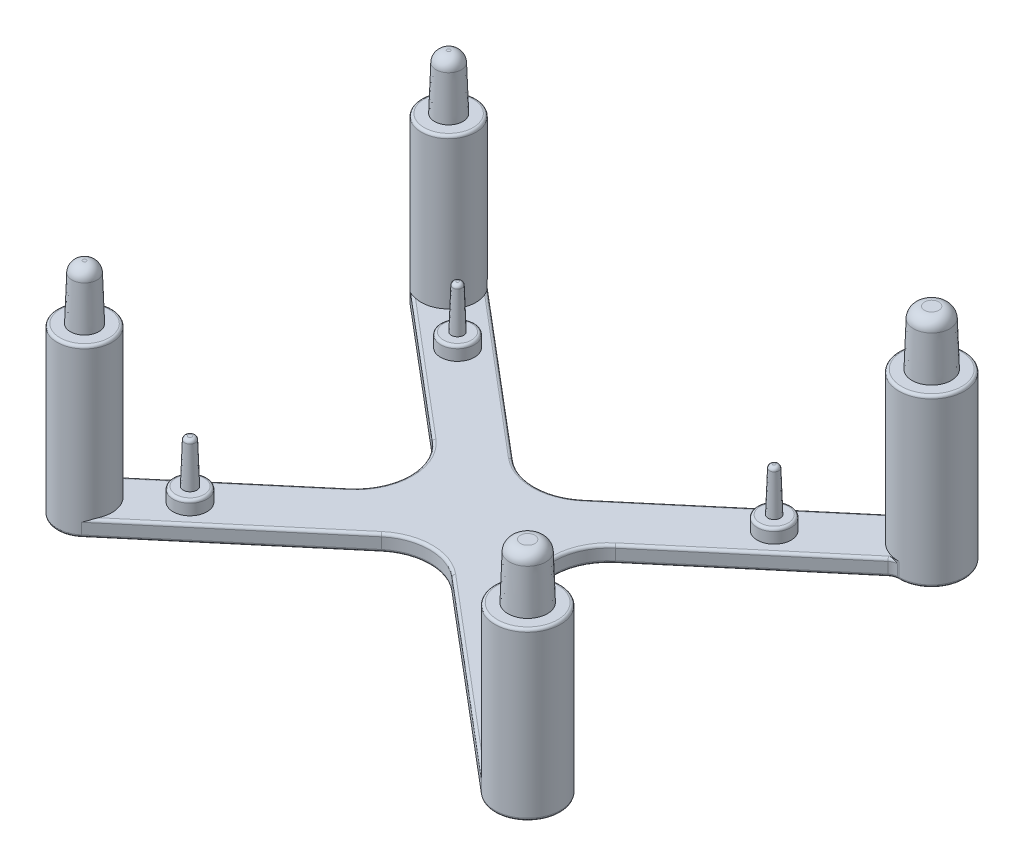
ISO-10303-21;
HEADER;
FILE_DESCRIPTION(('STEP AP214'),'2;1');
FILE_NAME('part.step','',(''),(''),'','','');
FILE_SCHEMA(('AUTOMOTIVE_DESIGN { 1 0 10303 214 1 1 1 1 }'));
ENDSEC;
DATA;
#1=APPLICATION_CONTEXT('core data for automotive mechanical design processes');
#2=APPLICATION_PROTOCOL_DEFINITION('international standard','automotive_design',2000,#1);
#3=PRODUCT_CONTEXT('',#1,'mechanical');
#4=PRODUCT('Part','Part','',(#3));
#5=PRODUCT_RELATED_PRODUCT_CATEGORY('part','',(#4));
#6=PRODUCT_DEFINITION_FORMATION('','',#4);
#7=PRODUCT_DEFINITION_CONTEXT('part definition',#1,'design');
#8=PRODUCT_DEFINITION('design','',#6,#7);
#9=PRODUCT_DEFINITION_SHAPE('','',#8);
#10=(LENGTH_UNIT() NAMED_UNIT(*) SI_UNIT(.MILLI.,.METRE.));
#11=(NAMED_UNIT(*) PLANE_ANGLE_UNIT() SI_UNIT($,.RADIAN.));
#12=(NAMED_UNIT(*) SI_UNIT($,.STERADIAN.) SOLID_ANGLE_UNIT());
#13=UNCERTAINTY_MEASURE_WITH_UNIT(LENGTH_MEASURE(1.E-05),#10,'distance_accuracy_value','');
#14=(GEOMETRIC_REPRESENTATION_CONTEXT(3) GLOBAL_UNCERTAINTY_ASSIGNED_CONTEXT((#13)) GLOBAL_UNIT_ASSIGNED_CONTEXT((#10,
#11,#12)) REPRESENTATION_CONTEXT('',''));
#15=CARTESIAN_POINT('',(0.,0.,0.));
#16=DIRECTION('',(0.,0.,1.));
#17=DIRECTION('',(1.,0.,0.));
#18=AXIS2_PLACEMENT_3D('',#15,#16,#17);
#19=CARTESIAN_POINT('',(0.,0.,0.));
#20=DIRECTION('',(0.,1.,0.));
#21=DIRECTION('',(0.,0.,1.));
#22=AXIS2_PLACEMENT_3D('',#19,#20,#21);
#23=PLANE('',#22);
#24=CARTESIAN_POINT('',(-49.4683083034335,0.,-33.3439251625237));
#25=DIRECTION('',(0.,1.,0.));
#26=DIRECTION('',(0.,0.,1.));
#27=AXIS2_PLACEMENT_3D('',#24,#25,#26);
#28=CIRCLE('',#27,5.);
#29=CARTESIAN_POINT('',(-50.7075412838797,0.,-28.499928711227));
#30=VERTEX_POINT('',#29);
#31=CARTESIAN_POINT('',(-44.8993754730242,0.,-35.37489852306));
#32=VERTEX_POINT('',#31);
#33=EDGE_CURVE('E323',#30,#32,#28,.T.);
#34=ORIENTED_EDGE('',*,*,#33,.F.);
#35=DIRECTION('',(0.763885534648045,0.,0.645351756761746));
#36=VECTOR('',#35,1.);
#37=CARTESIAN_POINT('',(-7.06887180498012,0.,8.36723362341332));
#38=LINE('',#37,#36);
#39=CARTESIAN_POINT('',(-26.4669446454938,0.,-8.02079811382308));
#40=VERTEX_POINT('',#39);
#41=EDGE_CURVE('E679',#30,#40,#38,.T.);
#42=ORIENTED_EDGE('',*,*,#41,.T.);
#43=CARTESIAN_POINT('',(-33.243138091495,0.,-1.32810429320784E-11));
#44=DIRECTION('',(0.,1.,0.));
#45=DIRECTION('',(0.,0.,1.));
#46=AXIS2_PLACEMENT_3D('',#43,#44,#45);
#47=CIRCLE('',#46,10.500000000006);
#48=CARTESIAN_POINT('',(-26.466944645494,0.,8.02079811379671));
#49=VERTEX_POINT('',#48);
#50=EDGE_CURVE('E675',#40,#49,#47,.F.);
#51=ORIENTED_EDGE('',*,*,#50,.T.);
#52=DIRECTION('',(0.763885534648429,0.,-0.64535175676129));
#53=VECTOR('',#52,1.);
#54=CARTESIAN_POINT('',(-52.3723912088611,0.,29.9064402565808));
#55=LINE('',#54,#53);
#56=CARTESIAN_POINT('',(-50.7075412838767,0.,28.4999287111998));
#57=VERTEX_POINT('',#56);
#58=EDGE_CURVE('E677',#49,#57,#55,.F.);
#59=ORIENTED_EDGE('',*,*,#58,.T.);
#60=CARTESIAN_POINT('',(-49.4683083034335,0.,33.3439251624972));
#61=DIRECTION('',(0.,1.,0.));
#62=DIRECTION('',(0.,0.,1.));
#63=AXIS2_PLACEMENT_3D('',#60,#61,#62);
#64=CIRCLE('',#63,5.00000000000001);
#65=CARTESIAN_POINT('',(-44.8993754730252,0.,35.3748985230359));
#66=VERTEX_POINT('',#65);
#67=EDGE_CURVE('E308',#66,#57,#64,.T.);
#68=ORIENTED_EDGE('',*,*,#67,.F.);
#69=DIRECTION('',(0.763885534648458,0.,-0.645351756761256));
#70=VECTOR('',#69,1.);
#71=CARTESIAN_POINT('',(-1.26070599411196,0.,-1.49226381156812));
#72=LINE('',#71,#70);
#73=CARTESIAN_POINT('',(-16.7761934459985,0.,11.6156517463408));
#74=VERTEX_POINT('',#73);
#75=EDGE_CURVE('E655',#66,#74,#72,.T.);
#76=ORIENTED_EDGE('',*,*,#75,.T.);
#77=CARTESIAN_POINT('',(-9.99999999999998,0.,19.6364498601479));
#78=DIRECTION('',(0.,1.,0.));
#79=DIRECTION('',(0.,0.,1.));
#80=AXIS2_PLACEMENT_3D('',#77,#78,#79);
#81=CIRCLE('',#80,10.5000000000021);
#82=CARTESIAN_POINT('',(-3.22380655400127,0.,11.615651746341));
#83=VERTEX_POINT('',#82);
#84=EDGE_CURVE('E556',#74,#83,#81,.F.);
#85=ORIENTED_EDGE('',*,*,#84,.T.);
#86=DIRECTION('',(0.763885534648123,0.,0.645351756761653));
#87=VECTOR('',#86,1.);
#88=CARTESIAN_POINT('',(-7.06887180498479,0.,8.36723362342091));
#89=LINE('',#88,#87);
#90=CARTESIAN_POINT('',(29.9642805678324,0.,39.653871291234));
#91=VERTEX_POINT('',#90);
#92=EDGE_CURVE('E307',#83,#91,#89,.T.);
#93=ORIENTED_EDGE('',*,*,#92,.T.);
#94=CARTESIAN_POINT('',(35.3454483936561,0.,37.0000000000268));
#95=DIRECTION('',(0.,1.,0.));
#96=DIRECTION('',(0.,0.,1.));
#97=AXIS2_PLACEMENT_3D('',#94,#95,#96);
#98=CIRCLE('',#97,5.99999999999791);
#99=CARTESIAN_POINT('',(35.3454483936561,0.,31.0000000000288));
#100=VERTEX_POINT('',#99);
#101=EDGE_CURVE('E292',#100,#91,#98,.T.);
#102=ORIENTED_EDGE('',*,*,#101,.F.);
#103=DIRECTION('',(-1.,0.,1.56700056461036E-12));
#104=VECTOR('',#103,1.);
#105=CARTESIAN_POINT('',(4.85770175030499E-11,0.,31.0000000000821));
#106=LINE('',#105,#104);
#107=CARTESIAN_POINT('',(33.6762032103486,0.,31.0000000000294));
#108=VERTEX_POINT('',#107);
#109=EDGE_CURVE('E304',#100,#108,#106,.T.);
#110=ORIENTED_EDGE('',*,*,#109,.T.);
#111=CARTESIAN_POINT('',(35.2148183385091,0.,28.9037940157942));
#112=DIRECTION('',(0.,1.,0.));
#113=DIRECTION('',(0.,0.,1.));
#114=AXIS2_PLACEMENT_3D('',#111,#112,#113);
#115=CIRCLE('',#114,2.60027230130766);
#116=CARTESIAN_POINT('',(33.5367280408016,0.,30.8901044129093));
#117=VERTEX_POINT('',#116);
#118=EDGE_CURVE('E662',#108,#117,#115,.F.);
#119=ORIENTED_EDGE('',*,*,#118,.T.);
#120=DIRECTION('',(0.763885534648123,0.,0.645351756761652));
#121=VECTOR('',#120,1.);
#122=CARTESIAN_POINT('',(6.4669446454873,0.,8.02079811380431));
#123=LINE('',#122,#121);
#124=CARTESIAN_POINT('',(6.46694464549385,0.,8.02079811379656));
#125=VERTEX_POINT('',#124);
#126=EDGE_CURVE('E660',#117,#125,#123,.F.);
#127=ORIENTED_EDGE('',*,*,#126,.T.);
#128=CARTESIAN_POINT('',(13.243138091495,0.,-1.32879818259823E-11));
#129=DIRECTION('',(0.,1.,0.));
#130=DIRECTION('',(0.,0.,1.));
#131=AXIS2_PLACEMENT_3D('',#128,#129,#130);
#132=CIRCLE('',#131,10.500000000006);
#133=CARTESIAN_POINT('',(6.46694464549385,0.,-8.02079811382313));
#134=VERTEX_POINT('',#133);
#135=EDGE_CURVE('E658',#125,#134,#132,.F.);
#136=ORIENTED_EDGE('',*,*,#135,.T.);
#137=DIRECTION('',(0.763885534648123,0.,-0.645351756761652));
#138=VECTOR('',#137,1.);
#139=CARTESIAN_POINT('',(-1.26070599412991,0.,-1.49226381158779));
#140=LINE('',#139,#138);
#141=CARTESIAN_POINT('',(33.5367280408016,0.,-30.8901044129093));
#142=VERTEX_POINT('',#141);
#143=EDGE_CURVE('E664',#134,#142,#140,.T.);
#144=ORIENTED_EDGE('',*,*,#143,.T.);
#145=CARTESIAN_POINT('',(35.2148183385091,0.,-28.9037940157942));
#146=DIRECTION('',(0.,1.,0.));
#147=DIRECTION('',(0.,0.,1.));
#148=AXIS2_PLACEMENT_3D('',#145,#146,#147);
#149=CIRCLE('',#148,2.60027230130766);
#150=CARTESIAN_POINT('',(33.6762032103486,0.,-31.0000000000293));
#151=VERTEX_POINT('',#150);
#152=EDGE_CURVE('E666',#142,#151,#149,.F.);
#153=ORIENTED_EDGE('',*,*,#152,.T.);
#154=DIRECTION('',(-1.,0.,-1.56700056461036E-12));
#155=VECTOR('',#154,1.);
#156=CARTESIAN_POINT('',(4.85770175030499E-11,0.,-31.0000000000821));
#157=LINE('',#156,#155);
#158=CARTESIAN_POINT('',(35.3454483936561,0.,-31.0000000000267));
#159=VERTEX_POINT('',#158);
#160=EDGE_CURVE('E316',#159,#151,#157,.T.);
#161=ORIENTED_EDGE('',*,*,#160,.F.);
#162=CARTESIAN_POINT('',(35.3454483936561,0.,-37.0000000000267));
#163=DIRECTION('',(0.,1.,0.));
#164=DIRECTION('',(0.,0.,1.));
#165=AXIS2_PLACEMENT_3D('',#162,#163,#164);
#166=CIRCLE('',#165,5.99999999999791);
#167=CARTESIAN_POINT('',(29.9642805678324,0.,-39.653871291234));
#168=VERTEX_POINT('',#167);
#169=EDGE_CURVE('E309',#168,#159,#166,.T.);
#170=ORIENTED_EDGE('',*,*,#169,.F.);
#171=DIRECTION('',(0.763885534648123,0.,-0.645351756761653));
#172=VECTOR('',#171,1.);
#173=CARTESIAN_POINT('',(-3.22380655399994,0.,-11.6156517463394));
#174=LINE('',#173,#172);
#175=CARTESIAN_POINT('',(-3.22380655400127,0.,-11.615651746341));
#176=VERTEX_POINT('',#175);
#177=EDGE_CURVE('E671',#168,#176,#174,.F.);
#178=ORIENTED_EDGE('',*,*,#177,.T.);
#179=CARTESIAN_POINT('',(-9.99999999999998,0.,-19.6364498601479));
#180=DIRECTION('',(0.,1.,0.));
#181=DIRECTION('',(0.,0.,1.));
#182=AXIS2_PLACEMENT_3D('',#179,#180,#181);
#183=CIRCLE('',#182,10.5000000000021);
#184=CARTESIAN_POINT('',(-16.7761934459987,0.,-11.615651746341));
#185=VERTEX_POINT('',#184);
#186=EDGE_CURVE('E669',#176,#185,#183,.F.);
#187=ORIENTED_EDGE('',*,*,#186,.T.);
#188=DIRECTION('',(0.763885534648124,0.,0.645351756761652));
#189=VECTOR('',#188,1.);
#190=CARTESIAN_POINT('',(-46.5642253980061,0.,-36.7814100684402));
#191=LINE('',#190,#189);
#192=EDGE_CURVE('E673',#185,#32,#191,.F.);
#193=ORIENTED_EDGE('',*,*,#192,.T.);
#194=EDGE_LOOP('',(#34,#42,#51,#59,#68,#76,#85,#93,#102,#110,#119,#127,#136,#144,#153,#161,#170,
#178,#187,#193));
#195=FACE_BOUND('',#194,.T.);
#196=CARTESIAN_POINT('',(19.,0.,24.500007));
#197=DIRECTION('',(0.,1.,0.));
#198=DIRECTION('',(0.,0.,1.));
#199=AXIS2_PLACEMENT_3D('',#196,#197,#198);
#200=CIRCLE('',#199,3.09999999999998);
#201=CARTESIAN_POINT('',(19.,0.,27.600007));
#202=VERTEX_POINT('',#201);
#203=EDGE_CURVE('E1026',#202,#202,#200,.T.);
#204=ORIENTED_EDGE('',*,*,#203,.F.);
#205=EDGE_LOOP('',(#204));
#206=FACE_BOUND('',#205,.T.);
#207=CARTESIAN_POINT('',(19.,0.,-24.500007));
#208=DIRECTION('',(0.,1.,0.));
#209=DIRECTION('',(0.,0.,1.));
#210=AXIS2_PLACEMENT_3D('',#207,#208,#209);
#211=CIRCLE('',#210,3.09999999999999);
#212=CARTESIAN_POINT('',(19.,0.,-21.400007));
#213=VERTEX_POINT('',#212);
#214=EDGE_CURVE('E1021',#213,#213,#211,.T.);
#215=ORIENTED_EDGE('',*,*,#214,.F.);
#216=EDGE_LOOP('',(#215));
#217=FACE_BOUND('',#216,.T.);
#218=CARTESIAN_POINT('',(-39.,0.,24.500007));
#219=DIRECTION('',(0.,1.,0.));
#220=DIRECTION('',(0.,0.,-1.));
#221=AXIS2_PLACEMENT_3D('',#218,#219,#220);
#222=CIRCLE('',#221,3.09999999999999);
#223=CARTESIAN_POINT('',(-39.,0.,21.400007));
#224=VERTEX_POINT('',#223);
#225=EDGE_CURVE('E1017',#224,#224,#222,.T.);
#226=ORIENTED_EDGE('',*,*,#225,.F.);
#227=EDGE_LOOP('',(#226));
#228=FACE_BOUND('',#227,.T.);
#229=CARTESIAN_POINT('',(-39.,0.,-24.500007));
#230=DIRECTION('',(0.,1.,0.));
#231=DIRECTION('',(0.,0.,1.));
#232=AXIS2_PLACEMENT_3D('',#229,#230,#231);
#233=CIRCLE('',#232,3.09999999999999);
#234=CARTESIAN_POINT('',(-39.,0.,-21.400007));
#235=VERTEX_POINT('',#234);
#236=EDGE_CURVE('E1015',#235,#235,#233,.T.);
#237=ORIENTED_EDGE('',*,*,#236,.F.);
#238=EDGE_LOOP('',(#237));
#239=FACE_BOUND('',#238,.T.);
#240=ADVANCED_FACE('F37',(#195,#206,#217,#228,#239),#23,.T.);
#241=CARTESIAN_POINT('',(-0.938030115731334,-3.,-1.11032104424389));
#242=DIRECTION('',(0.645351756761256,0.,0.763885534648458));
#243=DIRECTION('',(0.763885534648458,0.,-0.645351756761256));
#244=AXIS2_PLACEMENT_3D('',#241,#242,#243);
#245=PLANE('',#244);
#246=DIRECTION('',(0.,1.,0.));
#247=VECTOR('',#246,1.);
#248=CARTESIAN_POINT('',(-16.4535175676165,-3.,11.9975945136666));
#249=LINE('',#248,#247);
#250=CARTESIAN_POINT('',(-16.4535175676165,-2.5,11.9975945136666));
#251=VERTEX_POINT('',#250);
#252=CARTESIAN_POINT('',(-16.4535175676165,-0.5,11.9975945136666));
#253=VERTEX_POINT('',#252);
#254=EDGE_CURVE('E318',#251,#253,#249,.T.);
#255=ORIENTED_EDGE('',*,*,#254,.T.);
#256=DIRECTION('',(0.763885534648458,0.,-0.645351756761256));
#257=VECTOR('',#256,1.);
#258=CARTESIAN_POINT('',(-0.938030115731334,-0.5,-1.11032104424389));
#259=LINE('',#258,#257);
#260=CARTESIAN_POINT('',(-46.2415495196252,-0.5,37.1633528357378));
#261=VERTEX_POINT('',#260);
#262=EDGE_CURVE('E700',#253,#261,#259,.F.);
#263=ORIENTED_EDGE('',*,*,#262,.T.);
#264=DIRECTION('',(0.,1.,0.));
#265=VECTOR('',#264,1.);
#266=CARTESIAN_POINT('',(-46.2415495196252,-3.,37.1633528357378));
#267=LINE('',#266,#265);
#268=CARTESIAN_POINT('',(-46.2415495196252,-2.5,37.1633528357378));
#269=VERTEX_POINT('',#268);
#270=EDGE_CURVE('E325',#269,#261,#267,.T.);
#271=ORIENTED_EDGE('',*,*,#270,.F.);
#272=DIRECTION('',(0.763885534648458,0.,-0.645351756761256));
#273=VECTOR('',#272,1.);
#274=CARTESIAN_POINT('',(-16.4535175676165,-2.5,11.9975945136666));
#275=LINE('',#274,#273);
#276=EDGE_CURVE('E542',#269,#251,#275,.T.);
#277=ORIENTED_EDGE('',*,*,#276,.T.);
#278=EDGE_LOOP('',(#255,#263,#271,#277));
#279=FACE_BOUND('',#278,.T.);
#280=ADVANCED_FACE('F876',(#279),#245,.T.);
#281=CARTESIAN_POINT('',(-49.4683083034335,-3.,33.3439251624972));
#282=DIRECTION('',(0.,1.,0.));
#283=DIRECTION('',(0.,0.,1.));
#284=AXIS2_PLACEMENT_3D('',#281,#282,#283);
#285=CYLINDRICAL_SURFACE('',#284,5.);
#286=CARTESIAN_POINT('',(-49.4683083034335,27.,33.3439251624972));
#287=DIRECTION('',(0.,1.,0.));
#288=DIRECTION('',(0.,0.,1.));
#289=AXIS2_PLACEMENT_3D('',#286,#287,#288);
#290=CIRCLE('',#289,5.);
#291=CARTESIAN_POINT('',(-49.4683083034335,27.,38.3439251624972));
#292=VERTEX_POINT('',#291);
#293=EDGE_CURVE('E424',#292,#292,#290,.F.);
#294=ORIENTED_EDGE('',*,*,#293,.T.);
#295=EDGE_LOOP('',(#294));
#296=FACE_BOUND('',#295,.T.);
#297=DIRECTION('',(0.,1.,0.));
#298=VECTOR('',#297,1.);
#299=CARTESIAN_POINT('',(-52.6950670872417,-3.,29.5244974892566));
#300=LINE('',#299,#298);
#301=CARTESIAN_POINT('',(-52.6950670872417,-2.5,29.5244974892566));
#302=VERTEX_POINT('',#301);
#303=CARTESIAN_POINT('',(-52.6950670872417,-0.5,29.5244974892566));
#304=VERTEX_POINT('',#303);
#305=EDGE_CURVE('E328',#302,#304,#300,.T.);
#306=ORIENTED_EDGE('',*,*,#305,.F.);
#307=CARTESIAN_POINT('',(-49.4683083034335,-2.5,33.3439251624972));
#308=DIRECTION('',(0.,1.,0.));
#309=DIRECTION('',(0.,0.,1.));
#310=AXIS2_PLACEMENT_3D('',#307,#308,#309);
#311=CIRCLE('',#310,5.);
#312=EDGE_CURVE('E540',#302,#269,#311,.T.);
#313=ORIENTED_EDGE('',*,*,#312,.T.);
#314=ORIENTED_EDGE('',*,*,#270,.T.);
#315=CARTESIAN_POINT('',(-44.8993754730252,0.,35.3748985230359));
#316=CARTESIAN_POINT('',(-44.9156966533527,-6.72037767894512E-06,35.4116166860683));
#317=CARTESIAN_POINT('',(-44.9324562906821,-0.000919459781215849,35.4481254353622));
#318=CARTESIAN_POINT('',(-44.9668128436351,-0.00433801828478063,35.520653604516));
#319=CARTESIAN_POINT('',(-44.9844093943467,-0.00684314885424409,35.5566732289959));
#320=CARTESIAN_POINT('',(-45.0383421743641,-0.016407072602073,35.6637919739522));
#321=CARTESIAN_POINT('',(-45.075889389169,-0.0255162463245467,35.7341034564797));
#322=CARTESIAN_POINT('',(-45.1538124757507,-0.0478794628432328,35.8720428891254));
#323=CARTESIAN_POINT('',(-45.1941762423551,-0.061116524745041,35.9396805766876));
#324=CARTESIAN_POINT('',(-45.2777225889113,-0.090825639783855,36.0725056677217));
#325=CARTESIAN_POINT('',(-45.3209069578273,-0.10729975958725,36.1376914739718));
#326=CARTESIAN_POINT('',(-45.427803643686,-0.149857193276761,36.2911666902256));
#327=CARTESIAN_POINT('',(-45.492800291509,-0.177143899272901,36.37823190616));
#328=CARTESIAN_POINT('',(-45.6277227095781,-0.235054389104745,36.5473007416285));
#329=CARTESIAN_POINT('',(-45.697651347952,-0.265680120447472,36.6293013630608));
#330=CARTESIAN_POINT('',(-45.9145167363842,-0.360693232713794,36.8676581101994));
#331=CARTESIAN_POINT('',(-46.0685974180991,-0.428244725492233,37.0164610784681));
#332=CARTESIAN_POINT('',(-46.2346867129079,-0.497157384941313,37.1575470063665));
#333=CARTESIAN_POINT('',(-46.2381162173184,-0.498578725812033,37.1604522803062));
#334=CARTESIAN_POINT('',(-46.2415495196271,-0.5,37.1633528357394));
#335=B_SPLINE_CURVE_WITH_KNOTS('',3,(#315,#316,#317,#318,#319,#320,#321,#322,#323,#324,#325,
#326,#327,#328,#329,#330,#331,#332,#333,#334),.UNSPECIFIED.,.F.,.F.,(4,2,2,2,2,2,2,2,2,4),(0.,
0.120512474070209,0.240972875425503,0.481394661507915,0.720840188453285,0.960439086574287,
1.29617292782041,1.63210364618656,2.30362015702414,2.31776230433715),.UNSPECIFIED.);
#336=EDGE_CURVE('E808',#261,#66,#335,.F.);
#337=ORIENTED_EDGE('',*,*,#336,.T.);
#338=ORIENTED_EDGE('',*,*,#67,.T.);
#339=CARTESIAN_POINT('',(-50.7075412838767,0.,28.4999287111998));
#340=CARTESIAN_POINT('',(-50.7464698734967,-6.72037767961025E-06,28.5098870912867));
#341=CARTESIAN_POINT('',(-50.7852652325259,-0.000919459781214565,28.520312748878));
#342=CARTESIAN_POINT('',(-50.8625133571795,-0.00433801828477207,28.542071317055));
#343=CARTESIAN_POINT('',(-50.9009662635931,-0.0068431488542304,28.5534038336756));
#344=CARTESIAN_POINT('',(-51.0155890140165,-0.0164070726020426,28.5886854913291));
#345=CARTESIAN_POINT('',(-51.0911845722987,-0.0255162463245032,28.613960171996));
#346=CARTESIAN_POINT('',(-51.2402023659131,-0.0478794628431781,28.6677467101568));
#347=CARTESIAN_POINT('',(-51.313632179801,-0.0611165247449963,28.6962450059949));
#348=CARTESIAN_POINT('',(-51.4585468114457,-0.0908256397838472,28.7564301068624));
#349=CARTESIAN_POINT('',(-51.5300303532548,-0.107299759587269,28.788118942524));
#350=CARTESIAN_POINT('',(-51.69920546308,-0.149857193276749,28.8678768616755));
#351=CARTESIAN_POINT('',(-51.7959045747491,-0.177143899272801,28.9174167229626));
#352=CARTESIAN_POINT('',(-51.9851356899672,-0.235054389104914,29.0222018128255));
#353=CARTESIAN_POINT('',(-52.077665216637,-0.265680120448,29.0774503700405));
#354=CARTESIAN_POINT('',(-52.3488986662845,-0.360693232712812,29.251453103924));
#355=CARTESIAN_POINT('',(-52.5213488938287,-0.428244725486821,29.3785125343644));
#356=CARTESIAN_POINT('',(-52.6881964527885,-0.497157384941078,29.5187009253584));
#357=CARTESIAN_POINT('',(-52.6916337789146,-0.498578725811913,29.5215969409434));
#358=CARTESIAN_POINT('',(-52.6950670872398,-0.5,29.5244974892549));
#359=B_SPLINE_CURVE_WITH_KNOTS('',3,(#339,#340,#341,#342,#343,#344,#345,#346,#347,#348,#349,
#350,#351,#352,#353,#354,#355,#356,#357,#358),.UNSPECIFIED.,.F.,.F.,(4,2,2,2,2,2,2,2,2,4),(0.,
0.12051247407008,0.24097287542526,0.481394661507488,0.720840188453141,0.960439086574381,
1.29617292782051,1.63210364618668,2.30362015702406,2.31776230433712),.UNSPECIFIED.);
#360=EDGE_CURVE('E718',#57,#304,#359,.T.);
#361=ORIENTED_EDGE('',*,*,#360,.T.);
#362=EDGE_LOOP('',(#306,#313,#314,#337,#338,#361));
#363=FACE_BOUND('',#362,.T.);
#364=ADVANCED_FACE('F881',(#296,#363),#285,.T.);
#365=CARTESIAN_POINT('',(-7.391547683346,-3.,-8.74917639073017));
#366=DIRECTION('',(0.64535175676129,0.,0.763885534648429));
#367=DIRECTION('',(0.763885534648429,0.,-0.64535175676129));
#368=AXIS2_PLACEMENT_3D('',#365,#366,#367);
#369=PLANE('',#368);
#370=ORIENTED_EDGE('',*,*,#305,.T.);
#371=DIRECTION('',(0.763885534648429,0.,-0.64535175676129));
#372=VECTOR('',#371,1.);
#373=CARTESIAN_POINT('',(-26.7896205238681,-0.5,7.63885534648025));
#374=LINE('',#373,#372);
#375=CARTESIAN_POINT('',(-26.7896205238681,-0.5,7.63885534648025));
#376=VERTEX_POINT('',#375);
#377=EDGE_CURVE('E684',#304,#376,#374,.T.);
#378=ORIENTED_EDGE('',*,*,#377,.T.);
#379=DIRECTION('',(0.,1.,0.));
#380=VECTOR('',#379,1.);
#381=CARTESIAN_POINT('',(-26.7896205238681,-3.,7.63885534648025));
#382=LINE('',#381,#380);
#383=CARTESIAN_POINT('',(-26.7896205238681,-2.5,7.63885534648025));
#384=VERTEX_POINT('',#383);
#385=EDGE_CURVE('E331',#384,#376,#382,.T.);
#386=ORIENTED_EDGE('',*,*,#385,.F.);
#387=DIRECTION('',(0.763885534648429,0.,-0.64535175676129));
#388=VECTOR('',#387,1.);
#389=CARTESIAN_POINT('',(-7.391547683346,-2.5,-8.74917639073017));
#390=LINE('',#389,#388);
#391=EDGE_CURVE('E538',#384,#302,#390,.F.);
#392=ORIENTED_EDGE('',*,*,#391,.T.);
#393=EDGE_LOOP('',(#370,#378,#386,#392));
#394=FACE_BOUND('',#393,.T.);
#395=ADVANCED_FACE('F890',(#394),#369,.F.);
#396=CARTESIAN_POINT('',(-33.243138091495,-3.,-1.32810429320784E-11));
#397=DIRECTION('',(0.,1.,0.));
#398=DIRECTION('',(0.,0.,1.));
#399=AXIS2_PLACEMENT_3D('',#396,#397,#398);
#400=CYLINDRICAL_SURFACE('',#399,10.000000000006);
#401=ORIENTED_EDGE('',*,*,#385,.T.);
#402=CARTESIAN_POINT('',(-33.243138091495,-0.5,-1.32810429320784E-11));
#403=DIRECTION('',(0.,1.,0.));
#404=DIRECTION('',(0.,0.,1.));
#405=AXIS2_PLACEMENT_3D('',#402,#403,#404);
#406=CIRCLE('',#405,10.000000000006);
#407=CARTESIAN_POINT('',(-26.7896205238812,-0.5,-7.6388553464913));
#408=VERTEX_POINT('',#407);
#409=EDGE_CURVE('E703',#376,#408,#406,.T.);
#410=ORIENTED_EDGE('',*,*,#409,.T.);
#411=DIRECTION('',(0.,1.,0.));
#412=VECTOR('',#411,1.);
#413=CARTESIAN_POINT('',(-26.7896205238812,-3.,-7.6388553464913));
#414=LINE('',#413,#412);
#415=CARTESIAN_POINT('',(-26.7896205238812,-2.5,-7.6388553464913));
#416=VERTEX_POINT('',#415);
#417=EDGE_CURVE('E334',#416,#408,#414,.T.);
#418=ORIENTED_EDGE('',*,*,#417,.F.);
#419=CARTESIAN_POINT('',(-33.243138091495,-2.5,-1.32810429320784E-11));
#420=DIRECTION('',(0.,1.,0.));
#421=DIRECTION('',(0.,0.,1.));
#422=AXIS2_PLACEMENT_3D('',#419,#420,#421);
#423=CIRCLE('',#422,10.000000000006);
#424=EDGE_CURVE('E536',#416,#384,#423,.F.);
#425=ORIENTED_EDGE('',*,*,#424,.T.);
#426=EDGE_LOOP('',(#401,#410,#418,#425));
#427=FACE_BOUND('',#426,.T.);
#428=ADVANCED_FACE('F895',(#427),#400,.F.);
#429=CARTESIAN_POINT('',(-7.391547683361,-3.,8.74917639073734));
#430=DIRECTION('',(-0.645351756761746,0.,0.763885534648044));
#431=DIRECTION('',(0.763885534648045,0.,0.645351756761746));
#432=AXIS2_PLACEMENT_3D('',#429,#430,#431);
#433=PLANE('',#432);
#434=ORIENTED_EDGE('',*,*,#417,.T.);
#435=DIRECTION('',(0.763885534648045,0.,0.645351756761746));
#436=VECTOR('',#435,1.);
#437=CARTESIAN_POINT('',(-7.391547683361,-0.5,8.74917639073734));
#438=LINE('',#437,#436);
#439=CARTESIAN_POINT('',(-52.6950670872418,-0.5,-29.5244974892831));
#440=VERTEX_POINT('',#439);
#441=EDGE_CURVE('E682',#408,#440,#438,.F.);
#442=ORIENTED_EDGE('',*,*,#441,.T.);
#443=DIRECTION('',(0.,1.,0.));
#444=VECTOR('',#443,1.);
#445=CARTESIAN_POINT('',(-52.6950670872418,-3.,-29.5244974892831));
#446=LINE('',#445,#444);
#447=CARTESIAN_POINT('',(-52.6950670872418,-2.5,-29.5244974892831));
#448=VERTEX_POINT('',#447);
#449=EDGE_CURVE('E337',#448,#440,#446,.T.);
#450=ORIENTED_EDGE('',*,*,#449,.F.);
#451=DIRECTION('',(0.763885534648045,0.,0.645351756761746));
#452=VECTOR('',#451,1.);
#453=CARTESIAN_POINT('',(-26.7896205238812,-2.5,-7.63885534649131));
#454=LINE('',#453,#452);
#455=EDGE_CURVE('E534',#448,#416,#454,.T.);
#456=ORIENTED_EDGE('',*,*,#455,.T.);
#457=EDGE_LOOP('',(#434,#442,#450,#456));
#458=FACE_BOUND('',#457,.T.);
#459=ADVANCED_FACE('F898',(#458),#433,.T.);
#460=CARTESIAN_POINT('',(-49.4683083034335,-3.,-33.3439251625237));
#461=DIRECTION('',(0.,1.,0.));
#462=DIRECTION('',(0.,0.,1.));
#463=AXIS2_PLACEMENT_3D('',#460,#461,#462);
#464=CYLINDRICAL_SURFACE('',#463,5.);
#465=CARTESIAN_POINT('',(-49.4683083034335,27.,-33.3439251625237));
#466=DIRECTION('',(0.,1.,0.));
#467=DIRECTION('',(0.,0.,1.));
#468=AXIS2_PLACEMENT_3D('',#465,#466,#467);
#469=CIRCLE('',#468,5.);
#470=CARTESIAN_POINT('',(-49.4683083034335,27.,-28.3439251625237));
#471=VERTEX_POINT('',#470);
#472=EDGE_CURVE('E418',#471,#471,#469,.F.);
#473=ORIENTED_EDGE('',*,*,#472,.T.);
#474=EDGE_LOOP('',(#473));
#475=FACE_BOUND('',#474,.T.);
#476=DIRECTION('',(0.,1.,0.));
#477=VECTOR('',#476,1.);
#478=CARTESIAN_POINT('',(-46.2415495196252,-3.,-37.1633528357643));
#479=LINE('',#478,#477);
#480=CARTESIAN_POINT('',(-46.2415495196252,-2.5,-37.1633528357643));
#481=VERTEX_POINT('',#480);
#482=CARTESIAN_POINT('',(-46.2415495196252,-0.5,-37.1633528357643));
#483=VERTEX_POINT('',#482);
#484=EDGE_CURVE('E340',#481,#483,#479,.T.);
#485=ORIENTED_EDGE('',*,*,#484,.F.);
#486=CARTESIAN_POINT('',(-49.4683083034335,-2.5,-33.3439251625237));
#487=DIRECTION('',(0.,1.,0.));
#488=DIRECTION('',(0.,0.,1.));
#489=AXIS2_PLACEMENT_3D('',#486,#487,#488);
#490=CIRCLE('',#489,5.);
#491=EDGE_CURVE('E532',#481,#448,#490,.T.);
#492=ORIENTED_EDGE('',*,*,#491,.T.);
#493=ORIENTED_EDGE('',*,*,#449,.T.);
#494=CARTESIAN_POINT('',(-50.7075412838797,0.,-28.499928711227));
#495=CARTESIAN_POINT('',(-50.7464698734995,-6.72037767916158E-06,-28.5098870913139));
#496=CARTESIAN_POINT('',(-50.7852652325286,-0.00091945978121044,-28.5203127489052));
#497=CARTESIAN_POINT('',(-50.8625133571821,-0.00433801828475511,-28.5420713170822));
#498=CARTESIAN_POINT('',(-50.9009662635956,-0.00684314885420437,-28.5534038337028));
#499=CARTESIAN_POINT('',(-51.0155890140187,-0.0164070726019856,-28.5886854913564));
#500=CARTESIAN_POINT('',(-51.0911845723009,-0.0255162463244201,-28.6139601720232));
#501=CARTESIAN_POINT('',(-51.2402023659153,-0.04787946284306,-28.6677467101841));
#502=CARTESIAN_POINT('',(-51.3136321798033,-0.0611165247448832,-28.6962450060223));
#503=CARTESIAN_POINT('',(-51.4585468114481,-0.0908256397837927,-28.7564301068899));
#504=CARTESIAN_POINT('',(-51.5300303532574,-0.107299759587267,-28.7881189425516));
#505=CARTESIAN_POINT('',(-51.6992054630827,-0.149857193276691,-28.8678768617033));
#506=CARTESIAN_POINT('',(-51.7959045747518,-0.177143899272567,-28.9174167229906));
#507=CARTESIAN_POINT('',(-51.9851356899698,-0.235054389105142,-29.0222018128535));
#508=CARTESIAN_POINT('',(-52.0776652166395,-0.265680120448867,-29.0774503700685));
#509=CARTESIAN_POINT('',(-52.3488986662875,-0.360693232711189,-29.2514531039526));
#510=CARTESIAN_POINT('',(-52.5213488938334,-0.428244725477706,-29.3785125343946));
#511=CARTESIAN_POINT('',(-52.6881964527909,-0.497157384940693,-29.5187009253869));
#512=CARTESIAN_POINT('',(-52.691633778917,-0.498578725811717,-29.5215969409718));
#513=CARTESIAN_POINT('',(-52.6950670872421,-0.5,-29.5244974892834));
#514=B_SPLINE_CURVE_WITH_KNOTS('',3,(#494,#495,#496,#497,#498,#499,#500,#501,#502,#503,#504,
#505,#506,#507,#508,#509,#510,#511,#512,#513),.UNSPECIFIED.,.F.,.F.,(4,2,2,2,2,2,2,2,2,4),(0.,
0.120512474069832,0.240972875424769,0.481394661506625,0.720840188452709,0.960439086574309,
1.29617292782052,1.63210364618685,2.30362015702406,2.31776230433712),.UNSPECIFIED.);
#515=EDGE_CURVE('E711',#440,#30,#514,.F.);
#516=ORIENTED_EDGE('',*,*,#515,.T.);
#517=ORIENTED_EDGE('',*,*,#33,.T.);
#518=CARTESIAN_POINT('',(-44.8993754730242,0.,-35.37489852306));
#519=CARTESIAN_POINT('',(-44.9156966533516,-6.72037767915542E-06,-35.4116166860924));
#520=CARTESIAN_POINT('',(-44.932456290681,-0.000919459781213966,-35.4481254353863));
#521=CARTESIAN_POINT('',(-44.9668128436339,-0.00433801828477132,-35.52065360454));
#522=CARTESIAN_POINT('',(-44.9844093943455,-0.00684314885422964,-35.5566732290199));
#523=CARTESIAN_POINT('',(-45.0383421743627,-0.0164070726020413,-35.6637919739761));
#524=CARTESIAN_POINT('',(-45.0758893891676,-0.0255162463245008,-35.7341034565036));
#525=CARTESIAN_POINT('',(-45.1538124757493,-0.047879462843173,-35.8720428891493));
#526=CARTESIAN_POINT('',(-45.1941762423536,-0.0611165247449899,-35.9396805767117));
#527=CARTESIAN_POINT('',(-45.2777225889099,-0.0908256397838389,-36.0725056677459));
#528=CARTESIAN_POINT('',(-45.3209069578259,-0.10729975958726,-36.1376914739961));
#529=CARTESIAN_POINT('',(-45.4278036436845,-0.149857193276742,-36.2911666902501));
#530=CARTESIAN_POINT('',(-45.4928002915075,-0.177143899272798,-36.3782319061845));
#531=CARTESIAN_POINT('',(-45.6277227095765,-0.235054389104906,-36.547300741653));
#532=CARTESIAN_POINT('',(-45.6976513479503,-0.265680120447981,-36.6293013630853));
#533=CARTESIAN_POINT('',(-45.9145167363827,-0.360693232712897,-36.8676581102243));
#534=CARTESIAN_POINT('',(-46.0685974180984,-0.428244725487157,-37.0164610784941));
#535=CARTESIAN_POINT('',(-46.2346867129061,-0.497157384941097,-37.1575470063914));
#536=CARTESIAN_POINT('',(-46.2381162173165,-0.498578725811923,-37.1604522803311));
#537=CARTESIAN_POINT('',(-46.2415495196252,-0.5,-37.1633528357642));
#538=B_SPLINE_CURVE_WITH_KNOTS('',3,(#518,#519,#520,#521,#522,#523,#524,#525,#526,#527,#528,
#529,#530,#531,#532,#533,#534,#535,#536,#537),.UNSPECIFIED.,.F.,.F.,(4,2,2,2,2,2,2,2,2,4),(0.,
0.120512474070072,0.240972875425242,0.481394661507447,0.720840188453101,0.960439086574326,
1.29617292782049,1.63210364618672,2.30362015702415,2.31776230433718),.UNSPECIFIED.);
#539=EDGE_CURVE('E754',#32,#483,#538,.T.);
#540=ORIENTED_EDGE('',*,*,#539,.T.);
#541=EDGE_LOOP('',(#485,#492,#493,#516,#517,#540));
#542=FACE_BOUND('',#541,.T.);
#543=ADVANCED_FACE('F725',(#475,#542),#464,.T.);
#544=CARTESIAN_POINT('',(-0.938030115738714,-3.,1.11032104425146));
#545=DIRECTION('',(-0.645351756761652,0.,0.763885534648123));
#546=DIRECTION('',(0.763885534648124,0.,0.645351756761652));
#547=AXIS2_PLACEMENT_3D('',#544,#545,#546);
#548=PLANE('',#547);
#549=ORIENTED_EDGE('',*,*,#484,.T.);
#550=DIRECTION('',(0.763885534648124,0.,0.645351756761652));
#551=VECTOR('',#550,1.);
#552=CARTESIAN_POINT('',(-16.4535175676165,-0.5,-11.9975945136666));
#553=LINE('',#552,#551);
#554=CARTESIAN_POINT('',(-16.4535175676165,-0.5,-11.9975945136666));
#555=VERTEX_POINT('',#554);
#556=EDGE_CURVE('E686',#483,#555,#553,.T.);
#557=ORIENTED_EDGE('',*,*,#556,.T.);
#558=DIRECTION('',(0.,1.,0.));
#559=VECTOR('',#558,1.);
#560=CARTESIAN_POINT('',(-16.4535175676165,-3.,-11.9975945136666));
#561=LINE('',#560,#559);
#562=CARTESIAN_POINT('',(-16.4535175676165,-2.5,-11.9975945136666));
#563=VERTEX_POINT('',#562);
#564=EDGE_CURVE('E343',#563,#555,#561,.T.);
#565=ORIENTED_EDGE('',*,*,#564,.F.);
#566=DIRECTION('',(0.763885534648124,0.,0.645351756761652));
#567=VECTOR('',#566,1.);
#568=CARTESIAN_POINT('',(-0.938030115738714,-2.5,1.11032104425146));
#569=LINE('',#568,#567);
#570=EDGE_CURVE('E530',#563,#481,#569,.F.);
#571=ORIENTED_EDGE('',*,*,#570,.T.);
#572=EDGE_LOOP('',(#549,#557,#565,#571));
#573=FACE_BOUND('',#572,.T.);
#574=ADVANCED_FACE('F905',(#573),#548,.F.);
#575=CARTESIAN_POINT('',(-9.99999999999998,-3.,-19.6364498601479));
#576=DIRECTION('',(0.,1.,0.));
#577=DIRECTION('',(0.,0.,1.));
#578=AXIS2_PLACEMENT_3D('',#575,#576,#577);
#579=CYLINDRICAL_SURFACE('',#578,10.0000000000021);
#580=ORIENTED_EDGE('',*,*,#564,.T.);
#581=CARTESIAN_POINT('',(-9.99999999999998,-0.5,-19.6364498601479));
#582=DIRECTION('',(0.,1.,0.));
#583=DIRECTION('',(0.,0.,1.));
#584=AXIS2_PLACEMENT_3D('',#581,#582,#583);
#585=CIRCLE('',#584,10.0000000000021);
#586=CARTESIAN_POINT('',(-3.54648243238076,-0.5,-11.9975945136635));
#587=VERTEX_POINT('',#586);
#588=EDGE_CURVE('E705',#555,#587,#585,.T.);
#589=ORIENTED_EDGE('',*,*,#588,.T.);
#590=DIRECTION('',(0.,1.,0.));
#591=VECTOR('',#590,1.);
#592=CARTESIAN_POINT('',(-3.54648243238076,-3.,-11.9975945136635));
#593=LINE('',#592,#591);
#594=CARTESIAN_POINT('',(-3.54648243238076,-2.5,-11.9975945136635));
#595=VERTEX_POINT('',#594);
#596=EDGE_CURVE('E346',#595,#587,#593,.T.);
#597=ORIENTED_EDGE('',*,*,#596,.F.);
#598=CARTESIAN_POINT('',(-9.99999999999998,-2.5,-19.6364498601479));
#599=DIRECTION('',(0.,1.,0.));
#600=DIRECTION('',(0.,0.,1.));
#601=AXIS2_PLACEMENT_3D('',#598,#599,#600);
#602=CIRCLE('',#601,10.0000000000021);
#603=EDGE_CURVE('E528',#595,#563,#602,.F.);
#604=ORIENTED_EDGE('',*,*,#603,.T.);
#605=EDGE_LOOP('',(#580,#589,#597,#604));
#606=FACE_BOUND('',#605,.T.);
#607=ADVANCED_FACE('F1323',(#606),#579,.F.);
#608=CARTESIAN_POINT('',(-7.39154768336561,-3.,-8.74917639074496));
#609=DIRECTION('',(0.645351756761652,0.,0.763885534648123));
#610=DIRECTION('',(0.763885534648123,0.,-0.645351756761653));
#611=AXIS2_PLACEMENT_3D('',#608,#609,#610);
#612=PLANE('',#611);
#613=ORIENTED_EDGE('',*,*,#596,.T.);
#614=DIRECTION('',(0.763885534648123,0.,-0.645351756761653));
#615=VECTOR('',#614,1.);
#616=CARTESIAN_POINT('',(31.4733378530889,-0.5,-41.5833132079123));
#617=LINE('',#616,#615);
#618=CARTESIAN_POINT('',(31.4733378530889,-0.5,-41.5833132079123));
#619=VERTEX_POINT('',#618);
#620=EDGE_CURVE('E689',#587,#619,#617,.T.);
#621=ORIENTED_EDGE('',*,*,#620,.T.);
#622=DIRECTION('',(0.,1.,0.));
#623=VECTOR('',#622,1.);
#624=CARTESIAN_POINT('',(31.4733378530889,-3.,-41.5833132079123));
#625=LINE('',#624,#623);
#626=CARTESIAN_POINT('',(31.4733378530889,-2.5,-41.5833132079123));
#627=VERTEX_POINT('',#626);
#628=EDGE_CURVE('E349',#627,#619,#625,.T.);
#629=ORIENTED_EDGE('',*,*,#628,.F.);
#630=DIRECTION('',(0.763885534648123,0.,-0.645351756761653));
#631=VECTOR('',#630,1.);
#632=CARTESIAN_POINT('',(-7.39154768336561,-2.5,-8.74917639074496));
#633=LINE('',#632,#631);
#634=EDGE_CURVE('E526',#627,#595,#633,.F.);
#635=ORIENTED_EDGE('',*,*,#634,.T.);
#636=EDGE_LOOP('',(#613,#621,#629,#635));
#637=FACE_BOUND('',#636,.T.);
#638=ADVANCED_FACE('F1327',(#637),#612,.F.);
#639=CARTESIAN_POINT('',(35.3454483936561,-3.,-37.0000000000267));
#640=DIRECTION('',(0.,1.,0.));
#641=DIRECTION('',(0.,0.,1.));
#642=AXIS2_PLACEMENT_3D('',#639,#640,#641);
#643=CYLINDRICAL_SURFACE('',#642,5.99999999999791);
#644=CARTESIAN_POINT('',(35.3454483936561,27.,-37.0000000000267));
#645=DIRECTION('',(0.,1.,0.));
#646=DIRECTION('',(0.,0.,1.));
#647=AXIS2_PLACEMENT_3D('',#644,#645,#646);
#648=CIRCLE('',#647,5.99999999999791);
#649=CARTESIAN_POINT('',(35.3454483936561,27.,-31.0000000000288));
#650=VERTEX_POINT('',#649);
#651=EDGE_CURVE('E412',#650,#650,#648,.F.);
#652=ORIENTED_EDGE('',*,*,#651,.T.);
#653=EDGE_LOOP('',(#652));
#654=FACE_BOUND('',#653,.T.);
#655=DIRECTION('',(0.,1.,0.));
#656=VECTOR('',#655,1.);
#657=CARTESIAN_POINT('',(35.3454483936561,-3.,-31.0000000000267));
#658=LINE('',#657,#656);
#659=CARTESIAN_POINT('',(35.3454483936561,-2.5,-31.0000000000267));
#660=VERTEX_POINT('',#659);
#661=EDGE_CURVE('E352',#660,#159,#658,.T.);
#662=ORIENTED_EDGE('',*,*,#661,.F.);
#663=CARTESIAN_POINT('',(35.3454483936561,-2.5,-37.0000000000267));
#664=DIRECTION('',(0.,1.,0.));
#665=DIRECTION('',(0.,0.,1.));
#666=AXIS2_PLACEMENT_3D('',#663,#664,#665);
#667=CIRCLE('',#666,5.99999999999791);
#668=EDGE_CURVE('E524',#660,#627,#667,.T.);
#669=ORIENTED_EDGE('',*,*,#668,.T.);
#670=ORIENTED_EDGE('',*,*,#628,.T.);
#671=CARTESIAN_POINT('',(29.9642805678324,0.,-39.653871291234));
#672=CARTESIAN_POINT('',(29.9830114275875,-6.10507748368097E-06,-39.6918523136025));
#673=CARTESIAN_POINT('',(30.0021404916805,-0.000858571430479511,-39.7296248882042));
#674=CARTESIAN_POINT('',(30.0411605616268,-0.0040571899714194,-39.8046957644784));
#675=CARTESIAN_POINT('',(30.0610513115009,-0.00640284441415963,-39.8419942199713));
#676=CARTESIAN_POINT('',(30.121767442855,-0.0153724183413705,-39.9530092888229));
#677=CARTESIAN_POINT('',(30.1636979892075,-0.0239302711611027,-40.0259697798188));
#678=CARTESIAN_POINT('',(30.2501640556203,-0.0450044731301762,-40.1693959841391));
#679=CARTESIAN_POINT('',(30.2946909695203,-0.0575082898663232,-40.2398688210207));
#680=CARTESIAN_POINT('',(30.3863501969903,-0.0856341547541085,-40.378498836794));
#681=CARTESIAN_POINT('',(30.4334838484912,-0.101257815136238,-40.4466547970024));
#682=CARTESIAN_POINT('',(30.5533677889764,-0.142996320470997,-40.612599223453));
#683=CARTESIAN_POINT('',(30.6275876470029,-0.170554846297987,-40.7089687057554));
#684=CARTESIAN_POINT('',(30.7811497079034,-0.229289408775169,-40.896392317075));
#685=CARTESIAN_POINT('',(30.8604946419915,-0.260467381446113,-40.9874435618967));
#686=CARTESIAN_POINT('',(31.1059149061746,-0.357399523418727,-41.2525684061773));
#687=CARTESIAN_POINT('',(31.279439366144,-0.426576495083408,-41.4187007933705));
#688=CARTESIAN_POINT('',(31.4657620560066,-0.49713559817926,-41.5769049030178));
#689=CARTESIAN_POINT('',(31.4695480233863,-0.498567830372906,-41.5801114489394));
#690=CARTESIAN_POINT('',(31.4733378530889,-0.5,-41.5833132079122));
#691=B_SPLINE_CURVE_WITH_KNOTS('',3,(#671,#672,#673,#674,#675,#676,#677,#678,#679,#680,#681,
#682,#683,#684,#685,#686,#687,#688,#689,#690),.UNSPECIFIED.,.F.,.F.,(4,2,2,2,2,2,2,2,2,4),(0.,
0.127017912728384,0.253993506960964,0.507530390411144,0.760270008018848,1.01314057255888,
1.38695992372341,1.76098015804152,2.50868937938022,2.52418132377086),.UNSPECIFIED.);
#692=EDGE_CURVE('E759',#619,#168,#691,.F.);
#693=ORIENTED_EDGE('',*,*,#692,.T.);
#694=ORIENTED_EDGE('',*,*,#169,.T.);
#695=EDGE_LOOP('',(#662,#669,#670,#693,#694));
#696=FACE_BOUND('',#695,.T.);
#697=ADVANCED_FACE('F772',(#654,#696),#643,.T.);
#698=CARTESIAN_POINT('',(4.85770175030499E-11,-3.,-31.0000000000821));
#699=DIRECTION('',(1.56700056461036E-12,0.,-1.));
#700=DIRECTION('',(-1.,0.,-1.56700056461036E-12));
#701=AXIS2_PLACEMENT_3D('',#698,#699,#700);
#702=PLANE('',#701);
#703=DIRECTION('',(0.,1.,0.));
#704=VECTOR('',#703,1.);
#705=CARTESIAN_POINT('',(35.0841882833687,-3.,-31.0000000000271));
#706=LINE('',#705,#704);
#707=CARTESIAN_POINT('',(35.0841882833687,-2.5,-31.0000000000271));
#708=VERTEX_POINT('',#707);
#709=CARTESIAN_POINT('',(35.0841882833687,-0.5,-31.0000000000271));
#710=VERTEX_POINT('',#709);
#711=EDGE_CURVE('E355',#708,#710,#706,.T.);
#712=ORIENTED_EDGE('',*,*,#711,.F.);
#713=DIRECTION('',(-1.,0.,-1.56700056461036E-12));
#714=VECTOR('',#713,1.);
#715=CARTESIAN_POINT('',(4.85770175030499E-11,-2.5,-31.0000000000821));
#716=LINE('',#715,#714);
#717=EDGE_CURVE('E522',#708,#660,#716,.F.);
#718=ORIENTED_EDGE('',*,*,#717,.T.);
#719=ORIENTED_EDGE('',*,*,#661,.T.);
#720=ORIENTED_EDGE('',*,*,#160,.T.);
#721=CARTESIAN_POINT('',(33.6762032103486,0.,-31.0000000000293));
#722=CARTESIAN_POINT('',(33.7302465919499,-3.84792358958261E-05,-31.0000000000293));
#723=CARTESIAN_POINT('',(33.7841887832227,-0.00306230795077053,-31.0000000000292));
#724=CARTESIAN_POINT('',(33.8914307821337,-0.0141009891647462,-31.000000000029));
#725=CARTESIAN_POINT('',(33.9447319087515,-0.0221026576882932,-31.0000000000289));
#726=CARTESIAN_POINT('',(34.050145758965,-0.0420531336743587,-31.0000000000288));
#727=CARTESIAN_POINT('',(34.1022643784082,-0.0539720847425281,-31.0000000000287));
#728=CARTESIAN_POINT('',(34.2056711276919,-0.081060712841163,-31.0000000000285));
#729=CARTESIAN_POINT('',(34.2569587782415,-0.0962321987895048,-31.0000000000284));
#730=CARTESIAN_POINT('',(34.3551939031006,-0.128088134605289,-31.0000000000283));
#731=CARTESIAN_POINT('',(34.4021985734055,-0.144598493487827,-31.0000000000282));
#732=CARTESIAN_POINT('',(34.4955156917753,-0.179524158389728,-31.0000000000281));
#733=CARTESIAN_POINT('',(34.5418277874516,-0.197940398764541,-31.000000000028));
#734=CARTESIAN_POINT('',(34.6503996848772,-0.243281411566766,-31.0000000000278));
#735=CARTESIAN_POINT('',(34.7123795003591,-0.270877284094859,-31.0000000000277));
#736=CARTESIAN_POINT('',(34.8141490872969,-0.318822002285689,-31.0000000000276));
#737=CARTESIAN_POINT('',(34.8542908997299,-0.338428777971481,-31.0000000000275));
#738=CARTESIAN_POINT('',(34.919814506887,-0.372098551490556,-31.0000000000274));
#739=CARTESIAN_POINT('',(34.9454322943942,-0.385692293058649,-31.0000000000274));
#740=CARTESIAN_POINT('',(34.987004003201,-0.409244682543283,-31.0000000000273));
#741=CARTESIAN_POINT('',(35.0031852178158,-0.418798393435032,-31.0000000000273));
#742=CARTESIAN_POINT('',(35.0292788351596,-0.435706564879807,-31.0000000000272));
#743=CARTESIAN_POINT('',(35.0394232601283,-0.442678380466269,-31.0000000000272));
#744=CARTESIAN_POINT('',(35.0539316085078,-0.454138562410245,-31.0000000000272));
#745=CARTESIAN_POINT('',(35.0586711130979,-0.458147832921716,-31.0000000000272));
#746=CARTESIAN_POINT('',(35.0676351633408,-0.466720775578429,-31.0000000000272));
#747=CARTESIAN_POINT('',(35.0718619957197,-0.471281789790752,-31.0000000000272));
#748=CARTESIAN_POINT('',(35.0768111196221,-0.478215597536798,-31.0000000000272));
#749=CARTESIAN_POINT('',(35.0780795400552,-0.48018806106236,-31.0000000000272));
#750=CARTESIAN_POINT('',(35.0803329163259,-0.484278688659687,-31.0000000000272));
#751=CARTESIAN_POINT('',(35.0813195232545,-0.486395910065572,-31.0000000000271));
#752=CARTESIAN_POINT('',(35.0827645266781,-0.490400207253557,-31.0000000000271));
#753=CARTESIAN_POINT('',(35.0832845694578,-0.492264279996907,-31.0000000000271));
#754=CARTESIAN_POINT('',(35.084002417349,-0.496081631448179,-31.0000000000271));
#755=CARTESIAN_POINT('',(35.0841951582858,-0.498035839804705,-31.0000000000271));
#756=CARTESIAN_POINT('',(35.0841882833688,-0.499999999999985,-31.0000000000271));
#757=B_SPLINE_CURVE_WITH_KNOTS('',3,(#721,#722,#723,#724,#725,#726,#727,#728,#729,#730,#731,
#732,#733,#734,#735,#736,#737,#738,#739,#740,#741,#742,#743,#744,#745,#746,#747,#748,#749,#750,
#751,#752,#753,#754,#755,#756),.UNSPECIFIED.,.F.,.F.,(4,2,2,2,2,2,2,2,2,2,2,2,2,2,2,2,2,4),(0.,
0.161905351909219,0.323383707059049,0.483658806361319,0.644023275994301,0.793435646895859,
0.942921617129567,1.14638628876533,1.28039168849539,1.36736856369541,1.42372707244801,
1.46058740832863,1.47920075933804,1.49772776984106,1.50474790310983,1.51172602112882,
1.51750457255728,1.52337174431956),.UNSPECIFIED.);
#758=EDGE_CURVE('E765',#151,#710,#757,.T.);
#759=ORIENTED_EDGE('',*,*,#758,.T.);
#760=EDGE_LOOP('',(#712,#718,#719,#720,#759));
#761=FACE_BOUND('',#760,.T.);
#762=ADVANCED_FACE('F1339',(#761),#702,.F.);
#763=CARTESIAN_POINT('',(35.2148183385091,-3.,-28.9037940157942));
#764=DIRECTION('',(0.,1.,0.));
#765=DIRECTION('',(0.,0.,1.));
#766=AXIS2_PLACEMENT_3D('',#763,#764,#765);
#767=CYLINDRICAL_SURFACE('',#766,2.10027230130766);
#768=ORIENTED_EDGE('',*,*,#711,.T.);
#769=CARTESIAN_POINT('',(35.2148183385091,-0.5,-28.9037940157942));
#770=DIRECTION('',(0.,1.,0.));
#771=DIRECTION('',(0.,0.,1.));
#772=AXIS2_PLACEMENT_3D('',#769,#770,#771);
#773=CIRCLE('',#772,2.10027230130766);
#774=CARTESIAN_POINT('',(33.8594039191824,-0.5,-30.5081616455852));
#775=VERTEX_POINT('',#774);
#776=EDGE_CURVE('E691',#710,#775,#773,.T.);
#777=ORIENTED_EDGE('',*,*,#776,.T.);
#778=DIRECTION('',(0.,1.,0.));
#779=VECTOR('',#778,1.);
#780=CARTESIAN_POINT('',(33.8594039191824,-3.,-30.5081616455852));
#781=LINE('',#780,#779);
#782=CARTESIAN_POINT('',(33.8594039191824,-2.5,-30.5081616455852));
#783=VERTEX_POINT('',#782);
#784=EDGE_CURVE('E358',#783,#775,#781,.T.);
#785=ORIENTED_EDGE('',*,*,#784,.F.);
#786=CARTESIAN_POINT('',(35.2148183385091,-2.5,-28.9037940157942));
#787=DIRECTION('',(0.,1.,0.));
#788=DIRECTION('',(0.,0.,1.));
#789=AXIS2_PLACEMENT_3D('',#786,#787,#788);
#790=CIRCLE('',#789,2.10027230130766);
#791=EDGE_CURVE('E520',#783,#708,#790,.F.);
#792=ORIENTED_EDGE('',*,*,#791,.T.);
#793=EDGE_LOOP('',(#768,#777,#785,#792));
#794=FACE_BOUND('',#793,.T.);
#795=ADVANCED_FACE('F1342',(#794),#767,.F.);
#796=CARTESIAN_POINT('',(-0.938030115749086,-3.,-1.11032104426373));
#797=DIRECTION('',(0.645351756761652,0.,0.763885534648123));
#798=DIRECTION('',(0.763885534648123,0.,-0.645351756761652));
#799=AXIS2_PLACEMENT_3D('',#796,#797,#798);
#800=PLANE('',#799);
#801=ORIENTED_EDGE('',*,*,#784,.T.);
#802=DIRECTION('',(0.763885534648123,0.,-0.645351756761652));
#803=VECTOR('',#802,1.);
#804=CARTESIAN_POINT('',(-0.938030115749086,-0.5,-1.11032104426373));
#805=LINE('',#804,#803);
#806=CARTESIAN_POINT('',(6.78962052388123,-0.5,-7.63885534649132));
#807=VERTEX_POINT('',#806);
#808=EDGE_CURVE('E694',#775,#807,#805,.F.);
#809=ORIENTED_EDGE('',*,*,#808,.T.);
#810=DIRECTION('',(0.,1.,0.));
#811=VECTOR('',#810,1.);
#812=CARTESIAN_POINT('',(6.78962052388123,-3.,-7.63885534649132));
#813=LINE('',#812,#811);
#814=CARTESIAN_POINT('',(6.78962052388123,-2.5,-7.63885534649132));
#815=VERTEX_POINT('',#814);
#816=EDGE_CURVE('E361',#815,#807,#813,.T.);
#817=ORIENTED_EDGE('',*,*,#816,.F.);
#818=DIRECTION('',(0.763885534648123,0.,-0.645351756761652));
#819=VECTOR('',#818,1.);
#820=CARTESIAN_POINT('',(33.8594039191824,-2.5,-30.5081616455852));
#821=LINE('',#820,#819);
#822=EDGE_CURVE('E518',#815,#783,#821,.T.);
#823=ORIENTED_EDGE('',*,*,#822,.T.);
#824=EDGE_LOOP('',(#801,#809,#817,#823));
#825=FACE_BOUND('',#824,.T.);
#826=ADVANCED_FACE('F1350',(#825),#800,.T.);
#827=CARTESIAN_POINT('',(13.243138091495,-3.,-1.32879818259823E-11));
#828=DIRECTION('',(0.,1.,0.));
#829=DIRECTION('',(0.,0.,1.));
#830=AXIS2_PLACEMENT_3D('',#827,#828,#829);
#831=CYLINDRICAL_SURFACE('',#830,10.000000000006);
#832=ORIENTED_EDGE('',*,*,#816,.T.);
#833=CARTESIAN_POINT('',(13.243138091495,-0.5,-1.32879818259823E-11));
#834=DIRECTION('',(0.,1.,0.));
#835=DIRECTION('',(0.,0.,1.));
#836=AXIS2_PLACEMENT_3D('',#833,#834,#835);
#837=CIRCLE('',#836,10.000000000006);
#838=CARTESIAN_POINT('',(6.78962052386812,-0.5,7.63885534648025));
#839=VERTEX_POINT('',#838);
#840=EDGE_CURVE('E707',#807,#839,#837,.T.);
#841=ORIENTED_EDGE('',*,*,#840,.T.);
#842=DIRECTION('',(0.,1.,0.));
#843=VECTOR('',#842,1.);
#844=CARTESIAN_POINT('',(6.78962052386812,-3.,7.63885534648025));
#845=LINE('',#844,#843);
#846=CARTESIAN_POINT('',(6.78962052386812,-2.5,7.63885534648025));
#847=VERTEX_POINT('',#846);
#848=EDGE_CURVE('E364',#847,#839,#845,.T.);
#849=ORIENTED_EDGE('',*,*,#848,.F.);
#850=CARTESIAN_POINT('',(13.243138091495,-2.5,-1.32879818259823E-11));
#851=DIRECTION('',(0.,1.,0.));
#852=DIRECTION('',(0.,0.,1.));
#853=AXIS2_PLACEMENT_3D('',#850,#851,#852);
#854=CIRCLE('',#853,10.000000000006);
#855=EDGE_CURVE('E516',#847,#815,#854,.F.);
#856=ORIENTED_EDGE('',*,*,#855,.T.);
#857=EDGE_LOOP('',(#832,#841,#849,#856));
#858=FACE_BOUND('',#857,.T.);
#859=ADVANCED_FACE('F1353',(#858),#831,.F.);
#860=CARTESIAN_POINT('',(-0.93803011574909,-3.,1.11032104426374));
#861=DIRECTION('',(-0.645351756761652,0.,0.763885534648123));
#862=DIRECTION('',(0.763885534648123,0.,0.645351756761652));
#863=AXIS2_PLACEMENT_3D('',#860,#861,#862);
#864=PLANE('',#863);
#865=ORIENTED_EDGE('',*,*,#848,.T.);
#866=DIRECTION('',(0.763885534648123,0.,0.645351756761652));
#867=VECTOR('',#866,1.);
#868=CARTESIAN_POINT('',(33.8594039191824,-0.5,30.5081616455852));
#869=LINE('',#868,#867);
#870=CARTESIAN_POINT('',(33.8594039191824,-0.5,30.5081616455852));
#871=VERTEX_POINT('',#870);
#872=EDGE_CURVE('E698',#839,#871,#869,.T.);
#873=ORIENTED_EDGE('',*,*,#872,.T.);
#874=DIRECTION('',(0.,1.,0.));
#875=VECTOR('',#874,1.);
#876=CARTESIAN_POINT('',(33.8594039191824,-3.,30.5081616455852));
#877=LINE('',#876,#875);
#878=CARTESIAN_POINT('',(33.8594039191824,-2.5,30.5081616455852));
#879=VERTEX_POINT('',#878);
#880=EDGE_CURVE('E367',#879,#871,#877,.T.);
#881=ORIENTED_EDGE('',*,*,#880,.F.);
#882=DIRECTION('',(0.763885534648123,0.,0.645351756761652));
#883=VECTOR('',#882,1.);
#884=CARTESIAN_POINT('',(-0.93803011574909,-2.5,1.11032104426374));
#885=LINE('',#884,#883);
#886=EDGE_CURVE('E514',#879,#847,#885,.F.);
#887=ORIENTED_EDGE('',*,*,#886,.T.);
#888=EDGE_LOOP('',(#865,#873,#881,#887));
#889=FACE_BOUND('',#888,.T.);
#890=ADVANCED_FACE('F1362',(#889),#864,.F.);
#891=CARTESIAN_POINT('',(35.2148183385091,-3.,28.9037940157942));
#892=DIRECTION('',(0.,1.,0.));
#893=DIRECTION('',(0.,0.,1.));
#894=AXIS2_PLACEMENT_3D('',#891,#892,#893);
#895=CYLINDRICAL_SURFACE('',#894,2.10027230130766);
#896=ORIENTED_EDGE('',*,*,#880,.T.);
#897=CARTESIAN_POINT('',(35.2148183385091,-0.5,28.9037940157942));
#898=DIRECTION('',(0.,1.,0.));
#899=DIRECTION('',(0.,0.,1.));
#900=AXIS2_PLACEMENT_3D('',#897,#898,#899);
#901=CIRCLE('',#900,2.10027230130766);
#902=CARTESIAN_POINT('',(35.0841882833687,-0.5,31.0000000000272));
#903=VERTEX_POINT('',#902);
#904=EDGE_CURVE('E696',#871,#903,#901,.T.);
#905=ORIENTED_EDGE('',*,*,#904,.T.);
#906=DIRECTION('',(0.,1.,0.));
#907=VECTOR('',#906,1.);
#908=CARTESIAN_POINT('',(35.0841882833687,-3.,31.0000000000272));
#909=LINE('',#908,#907);
#910=CARTESIAN_POINT('',(35.0841882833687,-2.5,31.0000000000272));
#911=VERTEX_POINT('',#910);
#912=EDGE_CURVE('E298',#911,#903,#909,.T.);
#913=ORIENTED_EDGE('',*,*,#912,.F.);
#914=CARTESIAN_POINT('',(35.2148183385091,-2.5,28.9037940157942));
#915=DIRECTION('',(0.,1.,0.));
#916=DIRECTION('',(0.,0.,1.));
#917=AXIS2_PLACEMENT_3D('',#914,#915,#916);
#918=CIRCLE('',#917,2.10027230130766);
#919=EDGE_CURVE('E512',#911,#879,#918,.F.);
#920=ORIENTED_EDGE('',*,*,#919,.T.);
#921=EDGE_LOOP('',(#896,#905,#913,#920));
#922=FACE_BOUND('',#921,.T.);
#923=ADVANCED_FACE('F817',(#922),#895,.F.);
#924=CARTESIAN_POINT('',(4.85770175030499E-11,-3.,31.0000000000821));
#925=DIRECTION('',(-1.56700056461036E-12,0.,-1.));
#926=DIRECTION('',(-1.,0.,1.56700056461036E-12));
#927=AXIS2_PLACEMENT_3D('',#924,#925,#926);
#928=PLANE('',#927);
#929=DIRECTION('',(0.,1.,0.));
#930=VECTOR('',#929,1.);
#931=CARTESIAN_POINT('',(35.3454483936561,-3.,31.0000000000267));
#932=LINE('',#931,#930);
#933=CARTESIAN_POINT('',(35.3454483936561,-2.5,31.0000000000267));
#934=VERTEX_POINT('',#933);
#935=EDGE_CURVE('E289',#934,#100,#932,.T.);
#936=ORIENTED_EDGE('',*,*,#935,.F.);
#937=DIRECTION('',(-1.,0.,1.56700056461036E-12));
#938=VECTOR('',#937,1.);
#939=CARTESIAN_POINT('',(35.0841882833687,-2.5,31.0000000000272));
#940=LINE('',#939,#938);
#941=EDGE_CURVE('E510',#934,#911,#940,.T.);
#942=ORIENTED_EDGE('',*,*,#941,.T.);
#943=ORIENTED_EDGE('',*,*,#912,.T.);
#944=CARTESIAN_POINT('',(35.0841882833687,-0.5,31.0000000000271));
#945=CARTESIAN_POINT('',(35.0841962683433,-0.497939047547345,31.0000000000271));
#946=CARTESIAN_POINT('',(35.0839837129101,-0.495890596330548,31.0000000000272));
#947=CARTESIAN_POINT('',(35.0831975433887,-0.491901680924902,31.0000000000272));
#948=CARTESIAN_POINT('',(35.0826306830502,-0.489959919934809,31.0000000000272));
#949=CARTESIAN_POINT('',(35.0809289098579,-0.485438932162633,31.0000000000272));
#950=CARTESIAN_POINT('',(35.0796578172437,-0.482912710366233,31.0000000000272));
#951=CARTESIAN_POINT('',(35.0767452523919,-0.478063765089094,31.0000000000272));
#952=CARTESIAN_POINT('',(35.0751005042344,-0.475743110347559,31.0000000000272));
#953=CARTESIAN_POINT('',(35.0681916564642,-0.466948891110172,31.0000000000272));
#954=CARTESIAN_POINT('',(35.0620967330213,-0.461153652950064,31.0000000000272));
#955=CARTESIAN_POINT('',(35.0493037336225,-0.450296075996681,31.0000000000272));
#956=CARTESIAN_POINT('',(35.0426020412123,-0.445238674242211,31.0000000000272));
#957=CARTESIAN_POINT('',(35.0200073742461,-0.429190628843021,31.0000000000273));
#958=CARTESIAN_POINT('',(35.0035088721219,-0.419048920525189,31.0000000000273));
#959=CARTESIAN_POINT('',(34.9700764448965,-0.399505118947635,31.0000000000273));
#960=CARTESIAN_POINT('',(34.9531416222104,-0.3901047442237,31.0000000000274));
#961=CARTESIAN_POINT('',(34.9190387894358,-0.371764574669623,31.0000000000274));
#962=CARTESIAN_POINT('',(34.901871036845,-0.362824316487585,31.0000000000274));
#963=CARTESIAN_POINT('',(34.8674024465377,-0.345256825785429,31.0000000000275));
#964=CARTESIAN_POINT('',(34.8501017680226,-0.336629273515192,31.0000000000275));
#965=CARTESIAN_POINT('',(34.7977790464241,-0.310994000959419,31.0000000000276));
#966=CARTESIAN_POINT('',(34.7625734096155,-0.294358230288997,31.0000000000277));
#967=CARTESIAN_POINT('',(34.6917633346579,-0.261957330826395,31.0000000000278));
#968=CARTESIAN_POINT('',(34.6561588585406,-0.246192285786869,31.0000000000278));
#969=CARTESIAN_POINT('',(34.5486643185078,-0.200259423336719,31.000000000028));
#970=CARTESIAN_POINT('',(34.4761643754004,-0.171488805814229,31.0000000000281));
#971=CARTESIAN_POINT('',(34.3298100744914,-0.119008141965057,31.0000000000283));
#972=CARTESIAN_POINT('',(34.2559661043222,-0.0952695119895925,31.0000000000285));
#973=CARTESIAN_POINT('',(34.1065314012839,-0.0543772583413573,31.0000000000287));
#974=CARTESIAN_POINT('',(34.0309437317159,-0.0372128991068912,31.0000000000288));
#975=CARTESIAN_POINT('',(33.9087283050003,-0.0167662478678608,31.000000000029));
#976=CARTESIAN_POINT('',(33.862577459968,-0.0106776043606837,31.0000000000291));
#977=CARTESIAN_POINT('',(33.769708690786,-0.00229562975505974,31.0000000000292));
#978=CARTESIAN_POINT('',(33.7229890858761,-2.13959799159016E-05,31.0000000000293));
#979=CARTESIAN_POINT('',(33.6762032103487,1.6967812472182E-13,31.0000000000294));
#980=B_SPLINE_CURVE_WITH_KNOTS('',3,(#944,#945,#946,#947,#948,#949,#950,#951,#952,#953,#954,
#955,#956,#957,#958,#959,#960,#961,#962,#963,#964,#965,#966,#967,#968,#969,#970,#971,#972,#973,
#974,#975,#976,#977,#978,#979),.UNSPECIFIED.,.F.,.F.,(4,2,2,2,2,2,2,2,2,2,2,2,2,2,2,2,2,4),(0.,
0.00615194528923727,0.0121900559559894,0.0206255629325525,0.0291380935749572,0.0541666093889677,
0.0793555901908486,0.137343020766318,0.195461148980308,0.253519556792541,0.311516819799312,
0.42831456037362,0.545123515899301,0.778979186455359,1.01146858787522,1.24357670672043,
1.38308638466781,1.52329247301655),.UNSPECIFIED.);
#981=EDGE_CURVE('E314',#903,#108,#980,.T.);
#982=ORIENTED_EDGE('',*,*,#981,.T.);
#983=ORIENTED_EDGE('',*,*,#109,.F.);
#984=EDGE_LOOP('',(#936,#942,#943,#982,#983));
#985=FACE_BOUND('',#984,.T.);
#986=ADVANCED_FACE('F311',(#985),#928,.T.);
#987=CARTESIAN_POINT('',(35.3454483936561,-3.,37.0000000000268));
#988=DIRECTION('',(0.,1.,0.));
#989=DIRECTION('',(0.,0.,1.));
#990=AXIS2_PLACEMENT_3D('',#987,#988,#989);
#991=CYLINDRICAL_SURFACE('',#990,5.99999999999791);
#992=CARTESIAN_POINT('',(35.3454483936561,27.,37.0000000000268));
#993=DIRECTION('',(0.,1.,0.));
#994=DIRECTION('',(0.,0.,1.));
#995=AXIS2_PLACEMENT_3D('',#992,#993,#994);
#996=CIRCLE('',#995,5.99999999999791);
#997=CARTESIAN_POINT('',(35.3454483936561,27.,43.0000000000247));
#998=VERTEX_POINT('',#997);
#999=EDGE_CURVE('E406',#998,#998,#996,.F.);
#1000=ORIENTED_EDGE('',*,*,#999,.T.);
#1001=EDGE_LOOP('',(#1000));
#1002=FACE_BOUND('',#1001,.T.);
#1003=DIRECTION('',(0.,1.,0.));
#1004=VECTOR('',#1003,1.);
#1005=CARTESIAN_POINT('',(31.4733378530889,-3.,41.5833132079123));
#1006=LINE('',#1005,#1004);
#1007=CARTESIAN_POINT('',(31.4733378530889,-2.5,41.5833132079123));
#1008=VERTEX_POINT('',#1007);
#1009=CARTESIAN_POINT('',(31.4733378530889,-0.5,41.5833132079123));
#1010=VERTEX_POINT('',#1009);
#1011=EDGE_CURVE('E299',#1008,#1010,#1006,.T.);
#1012=ORIENTED_EDGE('',*,*,#1011,.F.);
#1013=CARTESIAN_POINT('',(35.3454483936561,-2.5,37.0000000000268));
#1014=DIRECTION('',(0.,1.,0.));
#1015=DIRECTION('',(0.,0.,1.));
#1016=AXIS2_PLACEMENT_3D('',#1013,#1014,#1015);
#1017=CIRCLE('',#1016,5.99999999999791);
#1018=EDGE_CURVE('E294',#1008,#934,#1017,.T.);
#1019=ORIENTED_EDGE('',*,*,#1018,.T.);
#1020=ORIENTED_EDGE('',*,*,#935,.T.);
#1021=ORIENTED_EDGE('',*,*,#101,.T.);
#1022=CARTESIAN_POINT('',(29.9642805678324,0.,39.653871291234));
#1023=CARTESIAN_POINT('',(29.9830114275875,-6.10507748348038E-06,39.6918523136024));
#1024=CARTESIAN_POINT('',(30.0021404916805,-0.000858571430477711,39.7296248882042));
#1025=CARTESIAN_POINT('',(30.0411605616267,-0.00405718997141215,39.8046957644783));
#1026=CARTESIAN_POINT('',(30.0610513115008,-0.00640284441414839,39.8419942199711));
#1027=CARTESIAN_POINT('',(30.1217674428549,-0.015372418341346,39.9530092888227));
#1028=CARTESIAN_POINT('',(30.1636979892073,-0.0239302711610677,40.0259697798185));
#1029=CARTESIAN_POINT('',(30.2501640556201,-0.0450044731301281,40.1693959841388));
#1030=CARTESIAN_POINT('',(30.2946909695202,-0.0575082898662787,40.2398688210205));
#1031=CARTESIAN_POINT('',(30.3863501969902,-0.0856341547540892,40.3784988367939));
#1032=CARTESIAN_POINT('',(30.4334838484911,-0.10125781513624,40.4466547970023));
#1033=CARTESIAN_POINT('',(30.5533677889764,-0.142996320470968,40.612599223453));
#1034=CARTESIAN_POINT('',(30.627587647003,-0.170554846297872,40.7089687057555));
#1035=CARTESIAN_POINT('',(30.7811497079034,-0.229289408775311,40.8963923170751));
#1036=CARTESIAN_POINT('',(30.8604946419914,-0.2604673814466,40.9874435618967));
#1037=CARTESIAN_POINT('',(31.1059149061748,-0.357399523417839,41.2525684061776));
#1038=CARTESIAN_POINT('',(31.2794393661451,-0.426576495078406,41.4187007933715));
#1039=CARTESIAN_POINT('',(31.4657620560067,-0.497135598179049,41.5769049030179));
#1040=CARTESIAN_POINT('',(31.4695480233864,-0.498567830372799,41.5801114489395));
#1041=CARTESIAN_POINT('',(31.4733378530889,-0.5,41.5833132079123));
#1042=B_SPLINE_CURVE_WITH_KNOTS('',3,(#1022,#1023,#1024,#1025,#1026,#1027,#1028,#1029,#1030,
#1031,#1032,#1033,#1034,#1035,#1036,#1037,#1038,#1039,#1040,#1041),.UNSPECIFIED.,.F.,.F.,(4,2,2,
2,2,2,2,2,2,4),(0.,0.127017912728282,0.253993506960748,0.507530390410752,0.760270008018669,
1.01314057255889,1.38695992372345,1.76098015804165,2.50868937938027,2.52418132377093),.UNSPECIFIED.);
#1043=EDGE_CURVE('E52',#91,#1010,#1042,.T.);
#1044=ORIENTED_EDGE('',*,*,#1043,.T.);
#1045=EDGE_LOOP('',(#1012,#1019,#1020,#1021,#1044));
#1046=FACE_BOUND('',#1045,.T.);
#1047=ADVANCED_FACE('F291',(#1002,#1046),#991,.T.);
#1048=CARTESIAN_POINT('',(-7.39154768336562,-3.,8.74917639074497));
#1049=DIRECTION('',(-0.645351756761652,0.,0.763885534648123));
#1050=DIRECTION('',(0.763885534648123,0.,0.645351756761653));
#1051=AXIS2_PLACEMENT_3D('',#1048,#1049,#1050);
#1052=PLANE('',#1051);
#1053=ORIENTED_EDGE('',*,*,#1011,.T.);
#1054=DIRECTION('',(0.763885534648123,0.,0.645351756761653));
#1055=VECTOR('',#1054,1.);
#1056=CARTESIAN_POINT('',(-7.39154768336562,-0.5,8.74917639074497));
#1057=LINE('',#1056,#1055);
#1058=CARTESIAN_POINT('',(-3.54648243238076,-0.5,11.9975945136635));
#1059=VERTEX_POINT('',#1058);
#1060=EDGE_CURVE('E59',#1010,#1059,#1057,.F.);
#1061=ORIENTED_EDGE('',*,*,#1060,.T.);
#1062=DIRECTION('',(0.,1.,0.));
#1063=VECTOR('',#1062,1.);
#1064=CARTESIAN_POINT('',(-3.54648243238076,-3.,11.9975945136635));
#1065=LINE('',#1064,#1063);
#1066=CARTESIAN_POINT('',(-3.54648243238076,-2.5,11.9975945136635));
#1067=VERTEX_POINT('',#1066);
#1068=EDGE_CURVE('E372',#1067,#1059,#1065,.T.);
#1069=ORIENTED_EDGE('',*,*,#1068,.F.);
#1070=DIRECTION('',(0.763885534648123,0.,0.645351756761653));
#1071=VECTOR('',#1070,1.);
#1072=CARTESIAN_POINT('',(31.4733378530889,-2.5,41.5833132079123));
#1073=LINE('',#1072,#1071);
#1074=EDGE_CURVE('E507',#1067,#1008,#1073,.T.);
#1075=ORIENTED_EDGE('',*,*,#1074,.T.);
#1076=EDGE_LOOP('',(#1053,#1061,#1069,#1075));
#1077=FACE_BOUND('',#1076,.T.);
#1078=ADVANCED_FACE('F822',(#1077),#1052,.T.);
#1079=CARTESIAN_POINT('',(-49.4683083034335,-3.,33.3439251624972));
#1080=DIRECTION('',(0.,1.,0.));
#1081=DIRECTION('',(0.,0.,1.));
#1082=AXIS2_PLACEMENT_3D('',#1079,#1080,#1081);
#1083=CYLINDRICAL_SURFACE('',#1082,2.999994);
#1084=CARTESIAN_POINT('',(-49.4683083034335,-2.5,33.3439251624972));
#1085=DIRECTION('',(0.,1.,0.));
#1086=DIRECTION('',(0.,0.,1.));
#1087=AXIS2_PLACEMENT_3D('',#1084,#1085,#1086);
#1088=CIRCLE('',#1087,2.999994);
#1089=CARTESIAN_POINT('',(-49.4683083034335,-2.5,36.3439191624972));
#1090=VERTEX_POINT('',#1089);
#1091=EDGE_CURVE('E544',#1090,#1090,#1088,.F.);
#1092=ORIENTED_EDGE('',*,*,#1091,.T.);
#1093=EDGE_LOOP('',(#1092));
#1094=FACE_BOUND('',#1093,.T.);
#1095=CARTESIAN_POINT('',(-49.4683083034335,22.5,33.3439251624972));
#1096=DIRECTION('',(0.,1.,0.));
#1097=DIRECTION('',(0.,0.,1.));
#1098=AXIS2_PLACEMENT_3D('',#1095,#1096,#1097);
#1099=CIRCLE('',#1098,2.999994);
#1100=CARTESIAN_POINT('',(-49.4683083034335,22.5,36.3439191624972));
#1101=VERTEX_POINT('',#1100);
#1102=EDGE_CURVE('E1044',#1101,#1101,#1099,.T.);
#1103=ORIENTED_EDGE('',*,*,#1102,.T.);
#1104=EDGE_LOOP('',(#1103));
#1105=FACE_BOUND('',#1104,.T.);
#1106=ADVANCED_FACE('F1108',(#1094,#1105),#1083,.F.);
#1107=CARTESIAN_POINT('',(-49.4683083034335,-3.,-33.3439251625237));
#1108=DIRECTION('',(0.,1.,0.));
#1109=DIRECTION('',(0.,0.,1.));
#1110=AXIS2_PLACEMENT_3D('',#1107,#1108,#1109);
#1111=CYLINDRICAL_SURFACE('',#1110,2.999994);
#1112=CARTESIAN_POINT('',(-49.4683083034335,-2.5,-33.3439251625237));
#1113=DIRECTION('',(0.,1.,0.));
#1114=DIRECTION('',(0.,0.,1.));
#1115=AXIS2_PLACEMENT_3D('',#1112,#1113,#1114);
#1116=CIRCLE('',#1115,2.999994);
#1117=CARTESIAN_POINT('',(-49.4683083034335,-2.5,-30.3439311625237));
#1118=VERTEX_POINT('',#1117);
#1119=EDGE_CURVE('E547',#1118,#1118,#1116,.F.);
#1120=ORIENTED_EDGE('',*,*,#1119,.T.);
#1121=EDGE_LOOP('',(#1120));
#1122=FACE_BOUND('',#1121,.T.);
#1123=CARTESIAN_POINT('',(-49.4683083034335,22.5,-33.3439251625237));
#1124=DIRECTION('',(0.,1.,0.));
#1125=DIRECTION('',(0.,0.,1.));
#1126=AXIS2_PLACEMENT_3D('',#1123,#1124,#1125);
#1127=CIRCLE('',#1126,2.999994);
#1128=CARTESIAN_POINT('',(-49.4683083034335,22.5,-30.3439311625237));
#1129=VERTEX_POINT('',#1128);
#1130=EDGE_CURVE('E1038',#1129,#1129,#1127,.F.);
#1131=ORIENTED_EDGE('',*,*,#1130,.F.);
#1132=EDGE_LOOP('',(#1131));
#1133=FACE_BOUND('',#1132,.T.);
#1134=ADVANCED_FACE('F1105',(#1122,#1133),#1111,.F.);
#1135=CARTESIAN_POINT('',(35.3454483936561,-3.,-37.0000000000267));
#1136=DIRECTION('',(0.,1.,0.));
#1137=DIRECTION('',(0.,0.,1.));
#1138=AXIS2_PLACEMENT_3D('',#1135,#1136,#1137);
#1139=CYLINDRICAL_SURFACE('',#1138,4.00000000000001);
#1140=CARTESIAN_POINT('',(35.3454483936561,-2.5,-37.0000000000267));
#1141=DIRECTION('',(0.,1.,0.));
#1142=DIRECTION('',(0.,0.,1.));
#1143=AXIS2_PLACEMENT_3D('',#1140,#1141,#1142);
#1144=CIRCLE('',#1143,4.00000000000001);
#1145=CARTESIAN_POINT('',(35.3454483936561,-2.5,-33.0000000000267));
#1146=VERTEX_POINT('',#1145);
#1147=EDGE_CURVE('E550',#1146,#1146,#1144,.F.);
#1148=ORIENTED_EDGE('',*,*,#1147,.T.);
#1149=EDGE_LOOP('',(#1148));
#1150=FACE_BOUND('',#1149,.T.);
#1151=CARTESIAN_POINT('',(35.3454483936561,22.5,-37.0000000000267));
#1152=DIRECTION('',(0.,1.,0.));
#1153=DIRECTION('',(0.,0.,1.));
#1154=AXIS2_PLACEMENT_3D('',#1151,#1152,#1153);
#1155=CIRCLE('',#1154,4.00000000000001);
#1156=CARTESIAN_POINT('',(35.3454483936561,22.5,-33.0000000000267));
#1157=VERTEX_POINT('',#1156);
#1158=EDGE_CURVE('E1041',#1157,#1157,#1155,.F.);
#1159=ORIENTED_EDGE('',*,*,#1158,.F.);
#1160=EDGE_LOOP('',(#1159));
#1161=FACE_BOUND('',#1160,.T.);
#1162=ADVANCED_FACE('F1107',(#1150,#1161),#1139,.F.);
#1163=CARTESIAN_POINT('',(35.3454483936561,-3.,37.0000000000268));
#1164=DIRECTION('',(0.,1.,0.));
#1165=DIRECTION('',(0.,0.,1.));
#1166=AXIS2_PLACEMENT_3D('',#1163,#1164,#1165);
#1167=CYLINDRICAL_SURFACE('',#1166,4.00000000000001);
#1168=CARTESIAN_POINT('',(35.3454483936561,-2.5,37.0000000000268));
#1169=DIRECTION('',(0.,1.,0.));
#1170=DIRECTION('',(0.,0.,1.));
#1171=AXIS2_PLACEMENT_3D('',#1168,#1169,#1170);
#1172=CIRCLE('',#1171,4.00000000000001);
#1173=CARTESIAN_POINT('',(35.3454483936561,-2.5,41.0000000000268));
#1174=VERTEX_POINT('',#1173);
#1175=EDGE_CURVE('E553',#1174,#1174,#1172,.F.);
#1176=ORIENTED_EDGE('',*,*,#1175,.T.);
#1177=EDGE_LOOP('',(#1176));
#1178=FACE_BOUND('',#1177,.T.);
#1179=CARTESIAN_POINT('',(35.3454483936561,22.5,37.0000000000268));
#1180=DIRECTION('',(0.,1.,0.));
#1181=DIRECTION('',(0.,0.,1.));
#1182=AXIS2_PLACEMENT_3D('',#1179,#1180,#1181);
#1183=CIRCLE('',#1182,4.00000000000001);
#1184=CARTESIAN_POINT('',(35.3454483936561,22.5,41.0000000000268));
#1185=VERTEX_POINT('',#1184);
#1186=EDGE_CURVE('E1047',#1185,#1185,#1183,.T.);
#1187=ORIENTED_EDGE('',*,*,#1186,.T.);
#1188=EDGE_LOOP('',(#1187));
#1189=FACE_BOUND('',#1188,.T.);
#1190=ADVANCED_FACE('F1115',(#1178,#1189),#1167,.F.);
#1191=CARTESIAN_POINT('',(-9.99999999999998,-3.,19.6364498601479));
#1192=DIRECTION('',(0.,1.,0.));
#1193=DIRECTION('',(0.,0.,1.));
#1194=AXIS2_PLACEMENT_3D('',#1191,#1192,#1193);
#1195=CYLINDRICAL_SURFACE('',#1194,10.0000000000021);
#1196=ORIENTED_EDGE('',*,*,#1068,.T.);
#1197=CARTESIAN_POINT('',(-9.99999999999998,-0.5,19.6364498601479));
#1198=DIRECTION('',(0.,1.,0.));
#1199=DIRECTION('',(0.,0.,1.));
#1200=AXIS2_PLACEMENT_3D('',#1197,#1198,#1199);
#1201=CIRCLE('',#1200,10.0000000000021);
#1202=EDGE_CURVE('E709',#1059,#253,#1201,.T.);
#1203=ORIENTED_EDGE('',*,*,#1202,.T.);
#1204=ORIENTED_EDGE('',*,*,#254,.F.);
#1205=CARTESIAN_POINT('',(-9.99999999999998,-2.5,19.6364498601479));
#1206=DIRECTION('',(0.,1.,0.));
#1207=DIRECTION('',(0.,0.,1.));
#1208=AXIS2_PLACEMENT_3D('',#1205,#1206,#1207);
#1209=CIRCLE('',#1208,10.0000000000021);
#1210=EDGE_CURVE('E451',#251,#1067,#1209,.F.);
#1211=ORIENTED_EDGE('',*,*,#1210,.T.);
#1212=EDGE_LOOP('',(#1196,#1203,#1204,#1211));
#1213=FACE_BOUND('',#1212,.T.);
#1214=ADVANCED_FACE('F1009',(#1213),#1195,.F.);
#1215=CARTESIAN_POINT('',(0.,-3.,0.));
#1216=DIRECTION('',(0.,1.,0.));
#1217=DIRECTION('',(0.,0.,1.));
#1218=AXIS2_PLACEMENT_3D('',#1215,#1216,#1217);
#1219=PLANE('',#1218);
#1220=DIRECTION('',(0.763885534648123,0.,0.645351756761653));
#1221=VECTOR('',#1220,1.);
#1222=CARTESIAN_POINT('',(-3.22380655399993,-3.,11.6156517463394));
#1223=LINE('',#1222,#1221);
#1224=CARTESIAN_POINT('',(31.7960137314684,-3.,41.2013704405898));
#1225=VERTEX_POINT('',#1224);
#1226=CARTESIAN_POINT('',(-3.22380655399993,-3.,11.6156517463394));
#1227=VERTEX_POINT('',#1226);
#1228=EDGE_CURVE('E502',#1225,#1227,#1223,.F.);
#1229=ORIENTED_EDGE('',*,*,#1228,.T.);
#1230=CARTESIAN_POINT('',(-9.99999999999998,-3.,19.6364498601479));
#1231=DIRECTION('',(0.,1.,0.));
#1232=DIRECTION('',(0.,0.,1.));
#1233=AXIS2_PLACEMENT_3D('',#1230,#1231,#1232);
#1234=CIRCLE('',#1233,10.5000000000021);
#1235=CARTESIAN_POINT('',(-16.7761934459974,-3.,11.6156517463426));
#1236=VERTEX_POINT('',#1235);
#1237=EDGE_CURVE('E504',#1227,#1236,#1234,.T.);
#1238=ORIENTED_EDGE('',*,*,#1237,.T.);
#1239=DIRECTION('',(0.763885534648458,0.,-0.645351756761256));
#1240=VECTOR('',#1239,1.);
#1241=CARTESIAN_POINT('',(-46.5642253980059,-3.,36.7814100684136));
#1242=LINE('',#1241,#1240);
#1243=CARTESIAN_POINT('',(-46.564225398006,-3.,36.7814100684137));
#1244=VERTEX_POINT('',#1243);
#1245=EDGE_CURVE('E466',#1236,#1244,#1242,.F.);
#1246=ORIENTED_EDGE('',*,*,#1245,.T.);
#1247=CARTESIAN_POINT('',(-49.4683083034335,-3.,33.3439251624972));
#1248=DIRECTION('',(0.,1.,0.));
#1249=DIRECTION('',(0.,0.,1.));
#1250=AXIS2_PLACEMENT_3D('',#1247,#1248,#1249);
#1251=CIRCLE('',#1250,4.5);
#1252=CARTESIAN_POINT('',(-52.3723912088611,-3.,29.9064402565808));
#1253=VERTEX_POINT('',#1252);
#1254=EDGE_CURVE('E468',#1244,#1253,#1251,.F.);
#1255=ORIENTED_EDGE('',*,*,#1254,.T.);
#1256=DIRECTION('',(0.763885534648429,0.,-0.64535175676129));
#1257=VECTOR('',#1256,1.);
#1258=CARTESIAN_POINT('',(-7.06887180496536,-3.,-8.36723362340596));
#1259=LINE('',#1258,#1257);
#1260=CARTESIAN_POINT('',(-26.4669446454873,-3.,8.02079811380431));
#1261=VERTEX_POINT('',#1260);
#1262=EDGE_CURVE('E470',#1253,#1261,#1259,.T.);
#1263=ORIENTED_EDGE('',*,*,#1262,.T.);
#1264=CARTESIAN_POINT('',(-33.243138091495,-3.,-1.32810429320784E-11));
#1265=DIRECTION('',(0.,1.,0.));
#1266=DIRECTION('',(0.,0.,1.));
#1267=AXIS2_PLACEMENT_3D('',#1264,#1265,#1266);
#1268=CIRCLE('',#1267,10.500000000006);
#1269=CARTESIAN_POINT('',(-26.4669446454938,-3.,-8.02079811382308));
#1270=VERTEX_POINT('',#1269);
#1271=EDGE_CURVE('E472',#1261,#1270,#1268,.T.);
#1272=ORIENTED_EDGE('',*,*,#1271,.T.);
#1273=DIRECTION('',(0.763885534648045,0.,0.645351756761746));
#1274=VECTOR('',#1273,1.);
#1275=CARTESIAN_POINT('',(-52.3723912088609,-3.,-29.9064402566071));
#1276=LINE('',#1275,#1274);
#1277=CARTESIAN_POINT('',(-52.3723912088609,-3.,-29.9064402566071));
#1278=VERTEX_POINT('',#1277);
#1279=EDGE_CURVE('E474',#1270,#1278,#1276,.F.);
#1280=ORIENTED_EDGE('',*,*,#1279,.T.);
#1281=CARTESIAN_POINT('',(-49.4683083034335,-3.,-33.3439251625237));
#1282=DIRECTION('',(0.,1.,0.));
#1283=DIRECTION('',(0.,0.,1.));
#1284=AXIS2_PLACEMENT_3D('',#1281,#1282,#1283);
#1285=CIRCLE('',#1284,4.5);
#1286=CARTESIAN_POINT('',(-46.5642253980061,-3.,-36.7814100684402));
#1287=VERTEX_POINT('',#1286);
#1288=EDGE_CURVE('E476',#1278,#1287,#1285,.F.);
#1289=ORIENTED_EDGE('',*,*,#1288,.T.);
#1290=DIRECTION('',(0.763885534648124,0.,0.645351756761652));
#1291=VECTOR('',#1290,1.);
#1292=CARTESIAN_POINT('',(-1.26070599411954,-3.,1.49226381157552));
#1293=LINE('',#1292,#1291);
#1294=CARTESIAN_POINT('',(-16.7761934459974,-3.,-11.6156517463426));
#1295=VERTEX_POINT('',#1294);
#1296=EDGE_CURVE('E478',#1287,#1295,#1293,.T.);
#1297=ORIENTED_EDGE('',*,*,#1296,.T.);
#1298=CARTESIAN_POINT('',(-9.99999999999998,-3.,-19.6364498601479));
#1299=DIRECTION('',(0.,1.,0.));
#1300=DIRECTION('',(0.,0.,1.));
#1301=AXIS2_PLACEMENT_3D('',#1298,#1299,#1300);
#1302=CIRCLE('',#1301,10.5000000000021);
#1303=CARTESIAN_POINT('',(-3.22380655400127,-3.,-11.615651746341));
#1304=VERTEX_POINT('',#1303);
#1305=EDGE_CURVE('E480',#1295,#1304,#1302,.T.);
#1306=ORIENTED_EDGE('',*,*,#1305,.T.);
#1307=DIRECTION('',(0.763885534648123,0.,-0.645351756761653));
#1308=VECTOR('',#1307,1.);
#1309=CARTESIAN_POINT('',(-7.06887180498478,-3.,-8.3672336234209));
#1310=LINE('',#1309,#1308);
#1311=CARTESIAN_POINT('',(31.7960137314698,-3.,-41.2013704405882));
#1312=VERTEX_POINT('',#1311);
#1313=EDGE_CURVE('E482',#1304,#1312,#1310,.T.);
#1314=ORIENTED_EDGE('',*,*,#1313,.T.);
#1315=CARTESIAN_POINT('',(35.3454483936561,-3.,-37.0000000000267));
#1316=DIRECTION('',(0.,1.,0.));
#1317=DIRECTION('',(0.,0.,1.));
#1318=AXIS2_PLACEMENT_3D('',#1315,#1316,#1317);
#1319=CIRCLE('',#1318,5.49999999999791);
#1320=CARTESIAN_POINT('',(35.3454483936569,-3.,-31.5000000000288));
#1321=VERTEX_POINT('',#1320);
#1322=EDGE_CURVE('E484',#1312,#1321,#1319,.F.);
#1323=ORIENTED_EDGE('',*,*,#1322,.T.);
#1324=DIRECTION('',(-1.,0.,-1.56700056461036E-12));
#1325=VECTOR('',#1324,1.);
#1326=CARTESIAN_POINT('',(4.93605177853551E-11,-3.,-31.5000000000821));
#1327=LINE('',#1326,#1325);
#1328=CARTESIAN_POINT('',(35.0694549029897,-3.,-31.5000000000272));
#1329=VERTEX_POINT('',#1328);
#1330=EDGE_CURVE('E486',#1321,#1329,#1327,.T.);
#1331=ORIENTED_EDGE('',*,*,#1330,.T.);
#1332=CARTESIAN_POINT('',(35.2148183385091,-3.,-28.9037940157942));
#1333=DIRECTION('',(0.,1.,0.));
#1334=DIRECTION('',(0.,0.,1.));
#1335=AXIS2_PLACEMENT_3D('',#1332,#1333,#1334);
#1336=CIRCLE('',#1335,2.60027230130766);
#1337=CARTESIAN_POINT('',(33.5367280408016,-3.,-30.8901044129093));
#1338=VERTEX_POINT('',#1337);
#1339=EDGE_CURVE('E488',#1329,#1338,#1336,.T.);
#1340=ORIENTED_EDGE('',*,*,#1339,.T.);
#1341=DIRECTION('',(0.763885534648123,0.,-0.645351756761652));
#1342=VECTOR('',#1341,1.);
#1343=CARTESIAN_POINT('',(6.4669446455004,-3.,-8.02079811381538));
#1344=LINE('',#1343,#1342);
#1345=CARTESIAN_POINT('',(6.4669446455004,-3.,-8.02079811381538));
#1346=VERTEX_POINT('',#1345);
#1347=EDGE_CURVE('E490',#1338,#1346,#1344,.F.);
#1348=ORIENTED_EDGE('',*,*,#1347,.T.);
#1349=CARTESIAN_POINT('',(13.243138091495,-3.,-1.32879818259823E-11));
#1350=DIRECTION('',(0.,1.,0.));
#1351=DIRECTION('',(0.,0.,1.));
#1352=AXIS2_PLACEMENT_3D('',#1349,#1350,#1351);
#1353=CIRCLE('',#1352,10.500000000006);
#1354=CARTESIAN_POINT('',(6.46694464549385,-3.,8.02079811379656));
#1355=VERTEX_POINT('',#1354);
#1356=EDGE_CURVE('E492',#1346,#1355,#1353,.T.);
#1357=ORIENTED_EDGE('',*,*,#1356,.T.);
#1358=DIRECTION('',(0.763885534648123,0.,0.645351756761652));
#1359=VECTOR('',#1358,1.);
#1360=CARTESIAN_POINT('',(-1.26070599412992,-3.,1.4922638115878));
#1361=LINE('',#1360,#1359);
#1362=CARTESIAN_POINT('',(33.5367280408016,-3.,30.8901044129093));
#1363=VERTEX_POINT('',#1362);
#1364=EDGE_CURVE('E494',#1355,#1363,#1361,.T.);
#1365=ORIENTED_EDGE('',*,*,#1364,.T.);
#1366=CARTESIAN_POINT('',(35.2148183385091,-3.,28.9037940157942));
#1367=DIRECTION('',(0.,1.,0.));
#1368=DIRECTION('',(0.,0.,1.));
#1369=AXIS2_PLACEMENT_3D('',#1366,#1367,#1368);
#1370=CIRCLE('',#1369,2.60027230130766);
#1371=CARTESIAN_POINT('',(35.0694549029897,-3.,31.5000000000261));
#1372=VERTEX_POINT('',#1371);
#1373=EDGE_CURVE('E496',#1363,#1372,#1370,.T.);
#1374=ORIENTED_EDGE('',*,*,#1373,.T.);
#1375=DIRECTION('',(-1.,0.,1.56700056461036E-12));
#1376=VECTOR('',#1375,1.);
#1377=CARTESIAN_POINT('',(35.3454483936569,-3.,31.5000000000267));
#1378=LINE('',#1377,#1376);
#1379=CARTESIAN_POINT('',(35.3454483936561,-3.,31.5000000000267));
#1380=VERTEX_POINT('',#1379);
#1381=EDGE_CURVE('E498',#1372,#1380,#1378,.F.);
#1382=ORIENTED_EDGE('',*,*,#1381,.T.);
#1383=CARTESIAN_POINT('',(35.3454483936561,-3.,37.0000000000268));
#1384=DIRECTION('',(0.,1.,0.));
#1385=DIRECTION('',(0.,0.,1.));
#1386=AXIS2_PLACEMENT_3D('',#1383,#1384,#1385);
#1387=CIRCLE('',#1386,5.49999999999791);
#1388=EDGE_CURVE('E500',#1380,#1225,#1387,.F.);
#1389=ORIENTED_EDGE('',*,*,#1388,.T.);
#1390=EDGE_LOOP('',(#1229,#1238,#1246,#1255,#1263,#1272,#1280,#1289,#1297,#1306,#1314,#1323,
#1331,#1340,#1348,#1357,#1365,#1374,#1382,#1389));
#1391=FACE_BOUND('',#1390,.T.);
#1392=CARTESIAN_POINT('',(-49.4683083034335,-3.,33.3439251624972));
#1393=DIRECTION('',(0.,1.,0.));
#1394=DIRECTION('',(0.,0.,1.));
#1395=AXIS2_PLACEMENT_3D('',#1392,#1393,#1394);
#1396=CIRCLE('',#1395,3.499994);
#1397=CARTESIAN_POINT('',(-49.4683083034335,-3.,36.8439191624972));
#1398=VERTEX_POINT('',#1397);
#1399=EDGE_CURVE('E463',#1398,#1398,#1396,.T.);
#1400=ORIENTED_EDGE('',*,*,#1399,.T.);
#1401=EDGE_LOOP('',(#1400));
#1402=FACE_BOUND('',#1401,.T.);
#1403=CARTESIAN_POINT('',(-49.4683083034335,-3.,-33.3439251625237));
#1404=DIRECTION('',(0.,1.,0.));
#1405=DIRECTION('',(0.,0.,1.));
#1406=AXIS2_PLACEMENT_3D('',#1403,#1404,#1405);
#1407=CIRCLE('',#1406,3.499994);
#1408=CARTESIAN_POINT('',(-49.4683083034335,-3.,-29.8439311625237));
#1409=VERTEX_POINT('',#1408);
#1410=EDGE_CURVE('E460',#1409,#1409,#1407,.T.);
#1411=ORIENTED_EDGE('',*,*,#1410,.T.);
#1412=EDGE_LOOP('',(#1411));
#1413=FACE_BOUND('',#1412,.T.);
#1414=CARTESIAN_POINT('',(35.3454483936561,-3.,-37.0000000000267));
#1415=DIRECTION('',(0.,1.,0.));
#1416=DIRECTION('',(0.,0.,1.));
#1417=AXIS2_PLACEMENT_3D('',#1414,#1415,#1416);
#1418=CIRCLE('',#1417,4.50000000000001);
#1419=CARTESIAN_POINT('',(35.3454483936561,-3.,-32.5000000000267));
#1420=VERTEX_POINT('',#1419);
#1421=EDGE_CURVE('E457',#1420,#1420,#1418,.T.);
#1422=ORIENTED_EDGE('',*,*,#1421,.T.);
#1423=EDGE_LOOP('',(#1422));
#1424=FACE_BOUND('',#1423,.T.);
#1425=CARTESIAN_POINT('',(35.3454483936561,-3.,37.0000000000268));
#1426=DIRECTION('',(0.,1.,0.));
#1427=DIRECTION('',(0.,0.,1.));
#1428=AXIS2_PLACEMENT_3D('',#1425,#1426,#1427);
#1429=CIRCLE('',#1428,4.50000000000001);
#1430=CARTESIAN_POINT('',(35.3454483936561,-3.,41.5000000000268));
#1431=VERTEX_POINT('',#1430);
#1432=EDGE_CURVE('E454',#1431,#1431,#1429,.T.);
#1433=ORIENTED_EDGE('',*,*,#1432,.T.);
#1434=EDGE_LOOP('',(#1433));
#1435=FACE_BOUND('',#1434,.T.);
#1436=ADVANCED_FACE('F885',(#1391,#1402,#1413,#1424,#1435),#1219,.F.);
#1437=CARTESIAN_POINT('',(-39.,2.5,-24.500007));
#1438=DIRECTION('',(0.,-1.,0.));
#1439=DIRECTION('',(0.,0.,-1.));
#1440=AXIS2_PLACEMENT_3D('',#1437,#1438,#1439);
#1441=CYLINDRICAL_SURFACE('',#1440,3.09999999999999);
#1442=CARTESIAN_POINT('',(-39.,2.,-24.500007));
#1443=DIRECTION('',(0.,1.,0.));
#1444=DIRECTION('',(0.,0.,1.));
#1445=AXIS2_PLACEMENT_3D('',#1442,#1443,#1444);
#1446=CIRCLE('',#1445,3.09999999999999);
#1447=CARTESIAN_POINT('',(-39.,2.,-21.400007));
#1448=VERTEX_POINT('',#1447);
#1449=EDGE_CURVE('E442',#1448,#1448,#1446,.F.);
#1450=ORIENTED_EDGE('',*,*,#1449,.T.);
#1451=EDGE_LOOP('',(#1450));
#1452=FACE_BOUND('',#1451,.T.);
#1453=ORIENTED_EDGE('',*,*,#236,.T.);
#1454=EDGE_LOOP('',(#1453));
#1455=FACE_BOUND('',#1454,.T.);
#1456=ADVANCED_FACE('F1002',(#1452,#1455),#1441,.T.);
#1457=CARTESIAN_POINT('',(-39.,2.5,-24.500007));
#1458=DIRECTION('',(0.,1.,0.));
#1459=DIRECTION('',(0.,0.,1.));
#1460=AXIS2_PLACEMENT_3D('',#1457,#1458,#1459);
#1461=PLANE('',#1460);
#1462=CARTESIAN_POINT('',(-39.,2.5,-24.500007));
#1463=DIRECTION('',(0.,1.,0.));
#1464=DIRECTION('',(0.,0.,1.));
#1465=AXIS2_PLACEMENT_3D('',#1462,#1463,#1464);
#1466=CIRCLE('',#1465,2.59999999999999);
#1467=CARTESIAN_POINT('',(-39.,2.5,-21.900007));
#1468=VERTEX_POINT('',#1467);
#1469=EDGE_CURVE('E439',#1468,#1468,#1466,.T.);
#1470=ORIENTED_EDGE('',*,*,#1469,.T.);
#1471=EDGE_LOOP('',(#1470));
#1472=FACE_BOUND('',#1471,.T.);
#1473=CARTESIAN_POINT('',(-39.,2.5,-24.500007));
#1474=DIRECTION('',(0.,1.,0.));
#1475=DIRECTION('',(0.,0.,1.));
#1476=AXIS2_PLACEMENT_3D('',#1473,#1474,#1475);
#1477=CIRCLE('',#1476,1.125);
#1478=CARTESIAN_POINT('',(-39.,2.5,-23.375007));
#1479=VERTEX_POINT('',#1478);
#1480=EDGE_CURVE('E1035',#1479,#1479,#1477,.T.);
#1481=ORIENTED_EDGE('',*,*,#1480,.F.);
#1482=EDGE_LOOP('',(#1481));
#1483=FACE_BOUND('',#1482,.T.);
#1484=ADVANCED_FACE('F999',(#1472,#1483),#1461,.T.);
#1485=CARTESIAN_POINT('',(-39.,2.5,24.500007));
#1486=DIRECTION('',(0.,-1.,0.));
#1487=DIRECTION('',(0.,0.,-1.));
#1488=AXIS2_PLACEMENT_3D('',#1485,#1486,#1487);
#1489=CYLINDRICAL_SURFACE('',#1488,3.09999999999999);
#1490=CARTESIAN_POINT('',(-39.,2.,24.500007));
#1491=DIRECTION('',(0.,-1.,0.));
#1492=DIRECTION('',(0.,0.,-1.));
#1493=AXIS2_PLACEMENT_3D('',#1490,#1491,#1492);
#1494=CIRCLE('',#1493,3.09999999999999);
#1495=CARTESIAN_POINT('',(-39.,2.,21.400007));
#1496=VERTEX_POINT('',#1495);
#1497=EDGE_CURVE('E448',#1496,#1496,#1494,.T.);
#1498=ORIENTED_EDGE('',*,*,#1497,.T.);
#1499=EDGE_LOOP('',(#1498));
#1500=FACE_BOUND('',#1499,.T.);
#1501=ORIENTED_EDGE('',*,*,#225,.T.);
#1502=EDGE_LOOP('',(#1501));
#1503=FACE_BOUND('',#1502,.T.);
#1504=ADVANCED_FACE('F995',(#1500,#1503),#1489,.T.);
#1505=CARTESIAN_POINT('',(-39.,2.5,24.500007));
#1506=DIRECTION('',(0.,-1.,0.));
#1507=DIRECTION('',(0.,0.,-1.));
#1508=AXIS2_PLACEMENT_3D('',#1505,#1506,#1507);
#1509=PLANE('',#1508);
#1510=CARTESIAN_POINT('',(-39.,2.5,24.500007));
#1511=DIRECTION('',(0.,-1.,0.));
#1512=DIRECTION('',(0.,0.,-1.));
#1513=AXIS2_PLACEMENT_3D('',#1510,#1511,#1512);
#1514=CIRCLE('',#1513,2.59999999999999);
#1515=CARTESIAN_POINT('',(-39.,2.5,21.900007));
#1516=VERTEX_POINT('',#1515);
#1517=EDGE_CURVE('E445',#1516,#1516,#1514,.F.);
#1518=ORIENTED_EDGE('',*,*,#1517,.T.);
#1519=EDGE_LOOP('',(#1518));
#1520=FACE_BOUND('',#1519,.T.);
#1521=CARTESIAN_POINT('',(-39.,2.5,24.500007));
#1522=DIRECTION('',(0.,-1.,0.));
#1523=DIRECTION('',(0.,0.,-1.));
#1524=AXIS2_PLACEMENT_3D('',#1521,#1522,#1523);
#1525=CIRCLE('',#1524,1.25);
#1526=CARTESIAN_POINT('',(-39.,2.5,23.250007));
#1527=VERTEX_POINT('',#1526);
#1528=EDGE_CURVE('E376',#1527,#1527,#1525,.F.);
#1529=ORIENTED_EDGE('',*,*,#1528,.F.);
#1530=EDGE_LOOP('',(#1529));
#1531=FACE_BOUND('',#1530,.T.);
#1532=ADVANCED_FACE('F991',(#1520,#1531),#1509,.F.);
#1533=CARTESIAN_POINT('',(19.,2.5,-24.500007));
#1534=DIRECTION('',(0.,-1.,0.));
#1535=DIRECTION('',(0.,0.,-1.));
#1536=AXIS2_PLACEMENT_3D('',#1533,#1534,#1535);
#1537=CYLINDRICAL_SURFACE('',#1536,3.09999999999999);
#1538=CARTESIAN_POINT('',(19.,2.,-24.500007));
#1539=DIRECTION('',(0.,1.,0.));
#1540=DIRECTION('',(0.,0.,1.));
#1541=AXIS2_PLACEMENT_3D('',#1538,#1539,#1540);
#1542=CIRCLE('',#1541,3.09999999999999);
#1543=CARTESIAN_POINT('',(19.,2.,-21.400007));
#1544=VERTEX_POINT('',#1543);
#1545=EDGE_CURVE('E430',#1544,#1544,#1542,.F.);
#1546=ORIENTED_EDGE('',*,*,#1545,.T.);
#1547=EDGE_LOOP('',(#1546));
#1548=FACE_BOUND('',#1547,.T.);
#1549=ORIENTED_EDGE('',*,*,#214,.T.);
#1550=EDGE_LOOP('',(#1549));
#1551=FACE_BOUND('',#1550,.T.);
#1552=ADVANCED_FACE('F987',(#1548,#1551),#1537,.T.);
#1553=CARTESIAN_POINT('',(19.,2.5,-24.500007));
#1554=DIRECTION('',(0.,1.,0.));
#1555=DIRECTION('',(0.,0.,1.));
#1556=AXIS2_PLACEMENT_3D('',#1553,#1554,#1555);
#1557=PLANE('',#1556);
#1558=CARTESIAN_POINT('',(19.,2.5,-24.500007));
#1559=DIRECTION('',(0.,1.,0.));
#1560=DIRECTION('',(0.,0.,1.));
#1561=AXIS2_PLACEMENT_3D('',#1558,#1559,#1560);
#1562=CIRCLE('',#1561,2.59999999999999);
#1563=CARTESIAN_POINT('',(19.,2.5,-21.900007));
#1564=VERTEX_POINT('',#1563);
#1565=EDGE_CURVE('E427',#1564,#1564,#1562,.T.);
#1566=ORIENTED_EDGE('',*,*,#1565,.T.);
#1567=EDGE_LOOP('',(#1566));
#1568=FACE_BOUND('',#1567,.T.);
#1569=CARTESIAN_POINT('',(19.,2.5,-24.500007));
#1570=DIRECTION('',(0.,1.,0.));
#1571=DIRECTION('',(0.,0.,1.));
#1572=AXIS2_PLACEMENT_3D('',#1569,#1570,#1571);
#1573=CIRCLE('',#1572,1.125);
#1574=CARTESIAN_POINT('',(19.,2.5,-23.375007));
#1575=VERTEX_POINT('',#1574);
#1576=EDGE_CURVE('E1029',#1575,#1575,#1573,.T.);
#1577=ORIENTED_EDGE('',*,*,#1576,.F.);
#1578=EDGE_LOOP('',(#1577));
#1579=FACE_BOUND('',#1578,.T.);
#1580=ADVANCED_FACE('F983',(#1568,#1579),#1557,.T.);
#1581=CARTESIAN_POINT('',(19.,2.5,24.500007));
#1582=DIRECTION('',(0.,-1.,0.));
#1583=DIRECTION('',(0.,0.,-1.));
#1584=AXIS2_PLACEMENT_3D('',#1581,#1582,#1583);
#1585=CYLINDRICAL_SURFACE('',#1584,3.09999999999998);
#1586=CARTESIAN_POINT('',(19.,2.,24.500007));
#1587=DIRECTION('',(0.,1.,0.));
#1588=DIRECTION('',(0.,0.,1.));
#1589=AXIS2_PLACEMENT_3D('',#1586,#1587,#1588);
#1590=CIRCLE('',#1589,3.09999999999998);
#1591=CARTESIAN_POINT('',(19.,2.,27.600007));
#1592=VERTEX_POINT('',#1591);
#1593=EDGE_CURVE('E436',#1592,#1592,#1590,.F.);
#1594=ORIENTED_EDGE('',*,*,#1593,.T.);
#1595=EDGE_LOOP('',(#1594));
#1596=FACE_BOUND('',#1595,.T.);
#1597=ORIENTED_EDGE('',*,*,#203,.T.);
#1598=EDGE_LOOP('',(#1597));
#1599=FACE_BOUND('',#1598,.T.);
#1600=ADVANCED_FACE('F979',(#1596,#1599),#1585,.T.);
#1601=CARTESIAN_POINT('',(19.,2.5,24.500007));
#1602=DIRECTION('',(0.,1.,0.));
#1603=DIRECTION('',(0.,0.,1.));
#1604=AXIS2_PLACEMENT_3D('',#1601,#1602,#1603);
#1605=PLANE('',#1604);
#1606=CARTESIAN_POINT('',(19.,2.5,24.500007));
#1607=DIRECTION('',(0.,1.,0.));
#1608=DIRECTION('',(0.,0.,1.));
#1609=AXIS2_PLACEMENT_3D('',#1606,#1607,#1608);
#1610=CIRCLE('',#1609,2.59999999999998);
#1611=CARTESIAN_POINT('',(19.,2.5,27.100007));
#1612=VERTEX_POINT('',#1611);
#1613=EDGE_CURVE('E433',#1612,#1612,#1610,.T.);
#1614=ORIENTED_EDGE('',*,*,#1613,.T.);
#1615=EDGE_LOOP('',(#1614));
#1616=FACE_BOUND('',#1615,.T.);
#1617=CARTESIAN_POINT('',(19.,2.5,24.500007));
#1618=DIRECTION('',(0.,1.,0.));
#1619=DIRECTION('',(0.,0.,1.));
#1620=AXIS2_PLACEMENT_3D('',#1617,#1618,#1619);
#1621=CIRCLE('',#1620,1.25);
#1622=CARTESIAN_POINT('',(19.,2.5,25.750007));
#1623=VERTEX_POINT('',#1622);
#1624=EDGE_CURVE('E1032',#1623,#1623,#1621,.T.);
#1625=ORIENTED_EDGE('',*,*,#1624,.F.);
#1626=EDGE_LOOP('',(#1625));
#1627=FACE_BOUND('',#1626,.T.);
#1628=ADVANCED_FACE('F847',(#1616,#1627),#1605,.T.);
#1629=CARTESIAN_POINT('',(19.,2.5,-24.500007));
#1630=DIRECTION('',(0.,-1.,0.));
#1631=DIRECTION('',(0.,0.,1.));
#1632=AXIS2_PLACEMENT_3D('',#1629,#1630,#1631);
#1633=CONICAL_SURFACE('',#1632,1.125,0.0349065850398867);
#1634=CARTESIAN_POINT('',(19.,9.88716118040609,-24.500007));
#1635=DIRECTION('',(0.,-1.,0.));
#1636=DIRECTION('',(0.,0.,-1.));
#1637=AXIS2_PLACEMENT_3D('',#1634,#1635,#1636);
#1638=CIRCLE('',#1637,0.867034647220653);
#1639=CARTESIAN_POINT('',(19.,9.88716118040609,-25.3670416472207));
#1640=VERTEX_POINT('',#1639);
#1641=EDGE_CURVE('E952',#1640,#1640,#1638,.T.);
#1642=ORIENTED_EDGE('',*,*,#1641,.T.);
#1643=EDGE_LOOP('',(#1642));
#1644=FACE_BOUND('',#1643,.T.);
#1645=ORIENTED_EDGE('',*,*,#1576,.T.);
#1646=EDGE_LOOP('',(#1645));
#1647=FACE_BOUND('',#1646,.T.);
#1648=ADVANCED_FACE('F844',(#1644,#1647),#1633,.T.);
#1649=CARTESIAN_POINT('',(19.,10.5,-24.500007));
#1650=DIRECTION('',(0.,1.,0.));
#1651=DIRECTION('',(0.,0.,1.));
#1652=AXIS2_PLACEMENT_3D('',#1649,#1650,#1651);
#1653=PLANE('',#1652);
#1654=CARTESIAN_POINT('',(19.,10.5,-24.500007));
#1655=DIRECTION('',(0.,1.,0.));
#1656=DIRECTION('',(0.,0.,1.));
#1657=AXIS2_PLACEMENT_3D('',#1654,#1655,#1656);
#1658=CIRCLE('',#1657,0.232421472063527);
#1659=CARTESIAN_POINT('',(19.,10.5,-24.2675855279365));
#1660=VERTEX_POINT('',#1659);
#1661=EDGE_CURVE('E949',#1660,#1660,#1658,.T.);
#1662=ORIENTED_EDGE('',*,*,#1661,.T.);
#1663=EDGE_LOOP('',(#1662));
#1664=FACE_BOUND('',#1663,.T.);
#1665=ADVANCED_FACE('F842',(#1664),#1653,.T.);
#1666=CARTESIAN_POINT('',(19.,2.5,24.500007));
#1667=DIRECTION('',(0.,-1.,0.));
#1668=DIRECTION('',(0.,0.,1.));
#1669=AXIS2_PLACEMENT_3D('',#1666,#1667,#1668);
#1670=CONICAL_SURFACE('',#1669,1.25,0.0349065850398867);
#1671=CARTESIAN_POINT('',(19.,9.88716118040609,24.500007));
#1672=DIRECTION('',(0.,-1.,0.));
#1673=DIRECTION('',(0.,0.,-1.));
#1674=AXIS2_PLACEMENT_3D('',#1671,#1672,#1673);
#1675=CIRCLE('',#1674,0.992034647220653);
#1676=CARTESIAN_POINT('',(19.,9.88716118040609,23.5079723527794));
#1677=VERTEX_POINT('',#1676);
#1678=EDGE_CURVE('E946',#1677,#1677,#1675,.T.);
#1679=ORIENTED_EDGE('',*,*,#1678,.T.);
#1680=EDGE_LOOP('',(#1679));
#1681=FACE_BOUND('',#1680,.T.);
#1682=ORIENTED_EDGE('',*,*,#1624,.T.);
#1683=EDGE_LOOP('',(#1682));
#1684=FACE_BOUND('',#1683,.T.);
#1685=ADVANCED_FACE('F838',(#1681,#1684),#1670,.T.);
#1686=CARTESIAN_POINT('',(19.,10.5,24.500007));
#1687=DIRECTION('',(0.,1.,0.));
#1688=DIRECTION('',(0.,0.,1.));
#1689=AXIS2_PLACEMENT_3D('',#1686,#1687,#1688);
#1690=PLANE('',#1689);
#1691=CARTESIAN_POINT('',(19.,10.5,24.500007));
#1692=DIRECTION('',(0.,1.,0.));
#1693=DIRECTION('',(0.,0.,1.));
#1694=AXIS2_PLACEMENT_3D('',#1691,#1692,#1693);
#1695=CIRCLE('',#1694,0.357421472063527);
#1696=CARTESIAN_POINT('',(19.,10.5,24.8574284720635));
#1697=VERTEX_POINT('',#1696);
#1698=EDGE_CURVE('E830',#1697,#1697,#1695,.T.);
#1699=ORIENTED_EDGE('',*,*,#1698,.T.);
#1700=EDGE_LOOP('',(#1699));
#1701=FACE_BOUND('',#1700,.T.);
#1702=ADVANCED_FACE('F841',(#1701),#1690,.T.);
#1703=CARTESIAN_POINT('',(-39.,2.5,24.500007));
#1704=DIRECTION('',(0.,-1.,0.));
#1705=DIRECTION('',(0.,0.,1.));
#1706=AXIS2_PLACEMENT_3D('',#1703,#1704,#1705);
#1707=CONICAL_SURFACE('',#1706,1.25,0.0349065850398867);
#1708=CARTESIAN_POINT('',(-39.,9.88716118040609,24.500007));
#1709=DIRECTION('',(0.,-1.,0.));
#1710=DIRECTION('',(0.,0.,-1.));
#1711=AXIS2_PLACEMENT_3D('',#1708,#1709,#1710);
#1712=CIRCLE('',#1711,0.992034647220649);
#1713=CARTESIAN_POINT('',(-39.,9.88716118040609,23.5079723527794));
#1714=VERTEX_POINT('',#1713);
#1715=EDGE_CURVE('E11',#1714,#1714,#1712,.T.);
#1716=ORIENTED_EDGE('',*,*,#1715,.T.);
#1717=EDGE_LOOP('',(#1716));
#1718=FACE_BOUND('',#1717,.T.);
#1719=ORIENTED_EDGE('',*,*,#1528,.T.);
#1720=EDGE_LOOP('',(#1719));
#1721=FACE_BOUND('',#1720,.T.);
#1722=ADVANCED_FACE('F855',(#1718,#1721),#1707,.T.);
#1723=CARTESIAN_POINT('',(-39.,10.5,24.500007));
#1724=DIRECTION('',(0.,1.,0.));
#1725=DIRECTION('',(0.,0.,1.));
#1726=AXIS2_PLACEMENT_3D('',#1723,#1724,#1725);
#1727=PLANE('',#1726);
#1728=CARTESIAN_POINT('',(-39.,10.5,24.500007));
#1729=DIRECTION('',(0.,1.,0.));
#1730=DIRECTION('',(0.,0.,1.));
#1731=AXIS2_PLACEMENT_3D('',#1728,#1729,#1730);
#1732=CIRCLE('',#1731,0.357421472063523);
#1733=CARTESIAN_POINT('',(-39.,10.5,24.8574284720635));
#1734=VERTEX_POINT('',#1733);
#1735=EDGE_CURVE('E45',#1734,#1734,#1732,.T.);
#1736=ORIENTED_EDGE('',*,*,#1735,.T.);
#1737=EDGE_LOOP('',(#1736));
#1738=FACE_BOUND('',#1737,.T.);
#1739=ADVANCED_FACE('F853',(#1738),#1727,.T.);
#1740=CARTESIAN_POINT('',(-39.,2.5,-24.500007));
#1741=DIRECTION('',(0.,-1.,0.));
#1742=DIRECTION('',(0.,0.,1.));
#1743=AXIS2_PLACEMENT_3D('',#1740,#1741,#1742);
#1744=CONICAL_SURFACE('',#1743,1.125,0.0349065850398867);
#1745=CARTESIAN_POINT('',(-39.,9.88716118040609,-24.500007));
#1746=DIRECTION('',(0.,-1.,0.));
#1747=DIRECTION('',(0.,0.,-1.));
#1748=AXIS2_PLACEMENT_3D('',#1745,#1746,#1747);
#1749=CIRCLE('',#1748,0.867034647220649);
#1750=CARTESIAN_POINT('',(-39.,9.88716118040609,-25.3670416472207));
#1751=VERTEX_POINT('',#1750);
#1752=EDGE_CURVE('E958',#1751,#1751,#1749,.T.);
#1753=ORIENTED_EDGE('',*,*,#1752,.T.);
#1754=EDGE_LOOP('',(#1753));
#1755=FACE_BOUND('',#1754,.T.);
#1756=ORIENTED_EDGE('',*,*,#1480,.T.);
#1757=EDGE_LOOP('',(#1756));
#1758=FACE_BOUND('',#1757,.T.);
#1759=ADVANCED_FACE('F849',(#1755,#1758),#1744,.T.);
#1760=CARTESIAN_POINT('',(-39.,10.5,-24.500007));
#1761=DIRECTION('',(0.,1.,0.));
#1762=DIRECTION('',(0.,0.,1.));
#1763=AXIS2_PLACEMENT_3D('',#1760,#1761,#1762);
#1764=PLANE('',#1763);
#1765=CARTESIAN_POINT('',(-39.,10.5,-24.500007));
#1766=DIRECTION('',(0.,1.,0.));
#1767=DIRECTION('',(0.,0.,1.));
#1768=AXIS2_PLACEMENT_3D('',#1765,#1766,#1767);
#1769=CIRCLE('',#1768,0.232421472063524);
#1770=CARTESIAN_POINT('',(-39.,10.5,-24.2675855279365));
#1771=VERTEX_POINT('',#1770);
#1772=EDGE_CURVE('E955',#1771,#1771,#1769,.T.);
#1773=ORIENTED_EDGE('',*,*,#1772,.T.);
#1774=EDGE_LOOP('',(#1773));
#1775=FACE_BOUND('',#1774,.T.);
#1776=ADVANCED_FACE('F852',(#1775),#1764,.T.);
#1777=CARTESIAN_POINT('',(-49.4683083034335,27.5,-33.3439251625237));
#1778=DIRECTION('',(0.,1.,0.));
#1779=DIRECTION('',(0.,0.,1.));
#1780=AXIS2_PLACEMENT_3D('',#1777,#1778,#1779);
#1781=PLANE('',#1780);
#1782=CARTESIAN_POINT('',(-49.4683083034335,27.5,-33.3439251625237));
#1783=DIRECTION('',(0.,1.,0.));
#1784=DIRECTION('',(0.,0.,1.));
#1785=AXIS2_PLACEMENT_3D('',#1782,#1783,#1784);
#1786=CIRCLE('',#1785,4.5);
#1787=CARTESIAN_POINT('',(-49.4683083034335,27.5,-28.8439251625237));
#1788=VERTEX_POINT('',#1787);
#1789=EDGE_CURVE('E415',#1788,#1788,#1786,.T.);
#1790=ORIENTED_EDGE('',*,*,#1789,.T.);
#1791=EDGE_LOOP('',(#1790));
#1792=FACE_BOUND('',#1791,.T.);
#1793=CARTESIAN_POINT('',(-49.4683083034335,27.5,-33.3439251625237));
#1794=DIRECTION('',(0.,1.,0.));
#1795=DIRECTION('',(0.,0.,1.));
#1796=AXIS2_PLACEMENT_3D('',#1793,#1794,#1795);
#1797=CIRCLE('',#1796,2.6);
#1798=CARTESIAN_POINT('',(-49.4683083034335,27.5,-30.7439251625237));
#1799=VERTEX_POINT('',#1798);
#1800=EDGE_CURVE('E1050',#1799,#1799,#1797,.T.);
#1801=ORIENTED_EDGE('',*,*,#1800,.F.);
#1802=EDGE_LOOP('',(#1801));
#1803=FACE_BOUND('',#1802,.T.);
#1804=ADVANCED_FACE('F1096',(#1792,#1803),#1781,.T.);
#1805=CARTESIAN_POINT('',(-49.4683083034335,22.5,-33.3439251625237));
#1806=DIRECTION('',(0.,1.,0.));
#1807=DIRECTION('',(0.,0.,1.));
#1808=AXIS2_PLACEMENT_3D('',#1805,#1806,#1807);
#1809=PLANE('',#1808);
#1810=ORIENTED_EDGE('',*,*,#1130,.T.);
#1811=EDGE_LOOP('',(#1810));
#1812=FACE_BOUND('',#1811,.T.);
#1813=ADVANCED_FACE('F1091',(#1812),#1809,.F.);
#1814=CARTESIAN_POINT('',(35.3454483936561,27.5,-37.0000000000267));
#1815=DIRECTION('',(0.,1.,0.));
#1816=DIRECTION('',(0.,0.,1.));
#1817=AXIS2_PLACEMENT_3D('',#1814,#1815,#1816);
#1818=PLANE('',#1817);
#1819=CARTESIAN_POINT('',(35.3454483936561,27.5,-37.0000000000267));
#1820=DIRECTION('',(0.,1.,0.));
#1821=DIRECTION('',(0.,0.,1.));
#1822=AXIS2_PLACEMENT_3D('',#1819,#1820,#1821);
#1823=CIRCLE('',#1822,5.49999999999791);
#1824=CARTESIAN_POINT('',(35.3454483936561,27.5,-31.5000000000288));
#1825=VERTEX_POINT('',#1824);
#1826=EDGE_CURVE('E409',#1825,#1825,#1823,.T.);
#1827=ORIENTED_EDGE('',*,*,#1826,.T.);
#1828=EDGE_LOOP('',(#1827));
#1829=FACE_BOUND('',#1828,.T.);
#1830=CARTESIAN_POINT('',(35.3454483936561,27.5,-37.0000000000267));
#1831=DIRECTION('',(0.,1.,0.));
#1832=DIRECTION('',(0.,0.,1.));
#1833=AXIS2_PLACEMENT_3D('',#1830,#1831,#1832);
#1834=CIRCLE('',#1833,3.6);
#1835=CARTESIAN_POINT('',(35.3454483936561,27.5,-33.4000000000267));
#1836=VERTEX_POINT('',#1835);
#1837=EDGE_CURVE('E1056',#1836,#1836,#1834,.T.);
#1838=ORIENTED_EDGE('',*,*,#1837,.F.);
#1839=EDGE_LOOP('',(#1838));
#1840=FACE_BOUND('',#1839,.T.);
#1841=ADVANCED_FACE('F1088',(#1829,#1840),#1818,.T.);
#1842=CARTESIAN_POINT('',(35.3454483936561,22.5,-37.0000000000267));
#1843=DIRECTION('',(0.,1.,0.));
#1844=DIRECTION('',(0.,0.,1.));
#1845=AXIS2_PLACEMENT_3D('',#1842,#1843,#1844);
#1846=PLANE('',#1845);
#1847=ORIENTED_EDGE('',*,*,#1158,.T.);
#1848=EDGE_LOOP('',(#1847));
#1849=FACE_BOUND('',#1848,.T.);
#1850=ADVANCED_FACE('F1085',(#1849),#1846,.F.);
#1851=CARTESIAN_POINT('',(-49.4683083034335,27.5,33.3439251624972));
#1852=DIRECTION('',(0.,1.,0.));
#1853=DIRECTION('',(0.,0.,1.));
#1854=AXIS2_PLACEMENT_3D('',#1851,#1852,#1853);
#1855=PLANE('',#1854);
#1856=CARTESIAN_POINT('',(-49.4683083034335,27.5,33.3439251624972));
#1857=DIRECTION('',(0.,1.,0.));
#1858=DIRECTION('',(0.,0.,1.));
#1859=AXIS2_PLACEMENT_3D('',#1856,#1857,#1858);
#1860=CIRCLE('',#1859,4.5);
#1861=CARTESIAN_POINT('',(-49.4683083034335,27.5,37.8439251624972));
#1862=VERTEX_POINT('',#1861);
#1863=EDGE_CURVE('E421',#1862,#1862,#1860,.T.);
#1864=ORIENTED_EDGE('',*,*,#1863,.T.);
#1865=EDGE_LOOP('',(#1864));
#1866=FACE_BOUND('',#1865,.T.);
#1867=CARTESIAN_POINT('',(-49.4683083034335,27.5,33.3439251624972));
#1868=DIRECTION('',(0.,1.,0.));
#1869=DIRECTION('',(0.,0.,1.));
#1870=AXIS2_PLACEMENT_3D('',#1867,#1868,#1869);
#1871=CIRCLE('',#1870,2.6);
#1872=CARTESIAN_POINT('',(-49.4683083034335,27.5,35.9439251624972));
#1873=VERTEX_POINT('',#1872);
#1874=EDGE_CURVE('E1053',#1873,#1873,#1871,.T.);
#1875=ORIENTED_EDGE('',*,*,#1874,.F.);
#1876=EDGE_LOOP('',(#1875));
#1877=FACE_BOUND('',#1876,.T.);
#1878=ADVANCED_FACE('F1077',(#1866,#1877),#1855,.T.);
#1879=CARTESIAN_POINT('',(-49.4683083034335,22.5,33.3439251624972));
#1880=DIRECTION('',(0.,1.,0.));
#1881=DIRECTION('',(0.,0.,1.));
#1882=AXIS2_PLACEMENT_3D('',#1879,#1880,#1881);
#1883=PLANE('',#1882);
#1884=ORIENTED_EDGE('',*,*,#1102,.F.);
#1885=EDGE_LOOP('',(#1884));
#1886=FACE_BOUND('',#1885,.T.);
#1887=ADVANCED_FACE('F1067',(#1886),#1883,.F.);
#1888=CARTESIAN_POINT('',(35.3454483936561,27.5,37.0000000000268));
#1889=DIRECTION('',(0.,1.,0.));
#1890=DIRECTION('',(0.,0.,1.));
#1891=AXIS2_PLACEMENT_3D('',#1888,#1889,#1890);
#1892=PLANE('',#1891);
#1893=CARTESIAN_POINT('',(35.3454483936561,27.5,37.0000000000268));
#1894=DIRECTION('',(0.,1.,0.));
#1895=DIRECTION('',(0.,0.,1.));
#1896=AXIS2_PLACEMENT_3D('',#1893,#1894,#1895);
#1897=CIRCLE('',#1896,5.49999999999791);
#1898=CARTESIAN_POINT('',(35.3454483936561,27.5,42.5000000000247));
#1899=VERTEX_POINT('',#1898);
#1900=EDGE_CURVE('E403',#1899,#1899,#1897,.T.);
#1901=ORIENTED_EDGE('',*,*,#1900,.T.);
#1902=EDGE_LOOP('',(#1901));
#1903=FACE_BOUND('',#1902,.T.);
#1904=CARTESIAN_POINT('',(35.3454483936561,27.5,37.0000000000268));
#1905=DIRECTION('',(0.,1.,0.));
#1906=DIRECTION('',(0.,0.,1.));
#1907=AXIS2_PLACEMENT_3D('',#1904,#1905,#1906);
#1908=CIRCLE('',#1907,3.6);
#1909=CARTESIAN_POINT('',(35.3454483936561,27.5,40.6000000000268));
#1910=VERTEX_POINT('',#1909);
#1911=EDGE_CURVE('E652',#1910,#1910,#1908,.T.);
#1912=ORIENTED_EDGE('',*,*,#1911,.F.);
#1913=EDGE_LOOP('',(#1912));
#1914=FACE_BOUND('',#1913,.T.);
#1915=ADVANCED_FACE('F1064',(#1903,#1914),#1892,.T.);
#1916=CARTESIAN_POINT('',(35.3454483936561,22.5,37.0000000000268));
#1917=DIRECTION('',(0.,1.,0.));
#1918=DIRECTION('',(0.,0.,1.));
#1919=AXIS2_PLACEMENT_3D('',#1916,#1917,#1918);
#1920=PLANE('',#1919);
#1921=ORIENTED_EDGE('',*,*,#1186,.F.);
#1922=EDGE_LOOP('',(#1921));
#1923=FACE_BOUND('',#1922,.T.);
#1924=ADVANCED_FACE('F1066',(#1923),#1920,.F.);
#1925=CARTESIAN_POINT('',(-49.4683083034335,27.5,-33.3439251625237));
#1926=DIRECTION('',(0.,-1.,0.));
#1927=DIRECTION('',(0.,0.,1.));
#1928=AXIS2_PLACEMENT_3D('',#1925,#1926,#1927);
#1929=CONICAL_SURFACE('',#1928,2.6,0.0349065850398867);
#1930=CARTESIAN_POINT('',(-49.4683083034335,35.569798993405,-33.3439251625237));
#1931=DIRECTION('',(0.,-1.,0.));
#1932=DIRECTION('',(0.,0.,-1.));
#1933=AXIS2_PLACEMENT_3D('',#1930,#1931,#1932);
#1934=CIRCLE('',#1933,2.31819640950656);
#1935=CARTESIAN_POINT('',(-49.4683083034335,35.569798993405,-35.6621215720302));
#1936=VERTEX_POINT('',#1935);
#1937=EDGE_CURVE('E382',#1936,#1936,#1934,.T.);
#1938=ORIENTED_EDGE('',*,*,#1937,.T.);
#1939=EDGE_LOOP('',(#1938));
#1940=FACE_BOUND('',#1939,.T.);
#1941=ORIENTED_EDGE('',*,*,#1800,.T.);
#1942=EDGE_LOOP('',(#1941));
#1943=FACE_BOUND('',#1942,.T.);
#1944=ADVANCED_FACE('F1074',(#1940,#1943),#1929,.T.);
#1945=CARTESIAN_POINT('',(-49.4683083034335,37.5,-33.3439251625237));
#1946=DIRECTION('',(0.,1.,0.));
#1947=DIRECTION('',(0.,0.,1.));
#1948=AXIS2_PLACEMENT_3D('',#1945,#1946,#1947);
#1949=PLANE('',#1948);
#1950=CARTESIAN_POINT('',(-49.4683083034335,37.5,-33.3439251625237));
#1951=DIRECTION('',(0.,1.,0.));
#1952=DIRECTION('',(0.,0.,1.));
#1953=AXIS2_PLACEMENT_3D('',#1950,#1951,#1952);
#1954=CIRCLE('',#1953,0.31941475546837);
#1955=CARTESIAN_POINT('',(-49.4683083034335,37.5,-33.0245104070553));
#1956=VERTEX_POINT('',#1955);
#1957=EDGE_CURVE('E379',#1956,#1956,#1954,.T.);
#1958=ORIENTED_EDGE('',*,*,#1957,.T.);
#1959=EDGE_LOOP('',(#1958));
#1960=FACE_BOUND('',#1959,.T.);
#1961=ADVANCED_FACE('F1081',(#1960),#1949,.T.);
#1962=CARTESIAN_POINT('',(-49.4683083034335,27.5,33.3439251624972));
#1963=DIRECTION('',(0.,-1.,0.));
#1964=DIRECTION('',(0.,0.,1.));
#1965=AXIS2_PLACEMENT_3D('',#1962,#1963,#1964);
#1966=CONICAL_SURFACE('',#1965,2.6,0.0349065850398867);
#1967=CARTESIAN_POINT('',(-49.4683083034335,35.569798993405,33.3439251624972));
#1968=DIRECTION('',(0.,-1.,0.));
#1969=DIRECTION('',(0.,0.,-1.));
#1970=AXIS2_PLACEMENT_3D('',#1967,#1968,#1969);
#1971=CIRCLE('',#1970,2.31819640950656);
#1972=CARTESIAN_POINT('',(-49.4683083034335,35.569798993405,31.0257287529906));
#1973=VERTEX_POINT('',#1972);
#1974=EDGE_CURVE('E388',#1973,#1973,#1971,.T.);
#1975=ORIENTED_EDGE('',*,*,#1974,.T.);
#1976=EDGE_LOOP('',(#1975));
#1977=FACE_BOUND('',#1976,.T.);
#1978=ORIENTED_EDGE('',*,*,#1874,.T.);
#1979=EDGE_LOOP('',(#1978));
#1980=FACE_BOUND('',#1979,.T.);
#1981=ADVANCED_FACE('F1137',(#1977,#1980),#1966,.T.);
#1982=CARTESIAN_POINT('',(-49.4683083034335,37.5,33.3439251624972));
#1983=DIRECTION('',(0.,1.,0.));
#1984=DIRECTION('',(0.,0.,1.));
#1985=AXIS2_PLACEMENT_3D('',#1982,#1983,#1984);
#1986=PLANE('',#1985);
#1987=CARTESIAN_POINT('',(-49.4683083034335,37.5,33.3439251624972));
#1988=DIRECTION('',(0.,1.,0.));
#1989=DIRECTION('',(0.,0.,1.));
#1990=AXIS2_PLACEMENT_3D('',#1987,#1988,#1989);
#1991=CIRCLE('',#1990,0.31941475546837);
#1992=CARTESIAN_POINT('',(-49.4683083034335,37.5,33.6633399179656));
#1993=VERTEX_POINT('',#1992);
#1994=EDGE_CURVE('E385',#1993,#1993,#1991,.T.);
#1995=ORIENTED_EDGE('',*,*,#1994,.T.);
#1996=EDGE_LOOP('',(#1995));
#1997=FACE_BOUND('',#1996,.T.);
#1998=ADVANCED_FACE('F1132',(#1997),#1986,.T.);
#1999=CARTESIAN_POINT('',(35.3454483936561,27.5,-37.0000000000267));
#2000=DIRECTION('',(0.,-1.,0.));
#2001=DIRECTION('',(0.,0.,1.));
#2002=AXIS2_PLACEMENT_3D('',#1999,#2000,#2001);
#2003=CONICAL_SURFACE('',#2002,3.6,0.0349065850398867);
#2004=CARTESIAN_POINT('',(35.3454483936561,35.569798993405,-37.0000000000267));
#2005=DIRECTION('',(0.,-1.,0.));
#2006=DIRECTION('',(0.,0.,-1.));
#2007=AXIS2_PLACEMENT_3D('',#2004,#2005,#2006);
#2008=CIRCLE('',#2007,3.31819640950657);
#2009=CARTESIAN_POINT('',(35.3454483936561,35.569798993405,-40.3181964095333));
#2010=VERTEX_POINT('',#2009);
#2011=EDGE_CURVE('E400',#2010,#2010,#2008,.T.);
#2012=ORIENTED_EDGE('',*,*,#2011,.T.);
#2013=EDGE_LOOP('',(#2012));
#2014=FACE_BOUND('',#2013,.T.);
#2015=ORIENTED_EDGE('',*,*,#1837,.T.);
#2016=EDGE_LOOP('',(#2015));
#2017=FACE_BOUND('',#2016,.T.);
#2018=ADVANCED_FACE('F1129',(#2014,#2017),#2003,.T.);
#2019=CARTESIAN_POINT('',(35.3454483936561,37.5,-37.0000000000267));
#2020=DIRECTION('',(0.,1.,0.));
#2021=DIRECTION('',(0.,0.,1.));
#2022=AXIS2_PLACEMENT_3D('',#2019,#2020,#2021);
#2023=PLANE('',#2022);
#2024=CARTESIAN_POINT('',(35.3454483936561,37.5,-37.0000000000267));
#2025=DIRECTION('',(0.,1.,0.));
#2026=DIRECTION('',(0.,0.,1.));
#2027=AXIS2_PLACEMENT_3D('',#2024,#2025,#2026);
#2028=CIRCLE('',#2027,1.31941475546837);
#2029=CARTESIAN_POINT('',(35.3454483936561,37.5,-35.6805852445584));
#2030=VERTEX_POINT('',#2029);
#2031=EDGE_CURVE('E397',#2030,#2030,#2028,.T.);
#2032=ORIENTED_EDGE('',*,*,#2031,.T.);
#2033=EDGE_LOOP('',(#2032));
#2034=FACE_BOUND('',#2033,.T.);
#2035=ADVANCED_FACE('F1127',(#2034),#2023,.T.);
#2036=CARTESIAN_POINT('',(35.3454483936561,27.5,37.0000000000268));
#2037=DIRECTION('',(0.,-1.,0.));
#2038=DIRECTION('',(0.,0.,1.));
#2039=AXIS2_PLACEMENT_3D('',#2036,#2037,#2038);
#2040=CONICAL_SURFACE('',#2039,3.6,0.0349065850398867);
#2041=CARTESIAN_POINT('',(35.3454483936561,35.569798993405,37.0000000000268));
#2042=DIRECTION('',(0.,-1.,0.));
#2043=DIRECTION('',(0.,0.,-1.));
#2044=AXIS2_PLACEMENT_3D('',#2041,#2042,#2043);
#2045=CIRCLE('',#2044,3.31819640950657);
#2046=CARTESIAN_POINT('',(35.3454483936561,35.569798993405,33.6818035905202));
#2047=VERTEX_POINT('',#2046);
#2048=EDGE_CURVE('E394',#2047,#2047,#2045,.T.);
#2049=ORIENTED_EDGE('',*,*,#2048,.T.);
#2050=EDGE_LOOP('',(#2049));
#2051=FACE_BOUND('',#2050,.T.);
#2052=ORIENTED_EDGE('',*,*,#1911,.T.);
#2053=EDGE_LOOP('',(#2052));
#2054=FACE_BOUND('',#2053,.T.);
#2055=ADVANCED_FACE('F1062',(#2051,#2054),#2040,.T.);
#2056=CARTESIAN_POINT('',(35.3454483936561,37.5,37.0000000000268));
#2057=DIRECTION('',(0.,1.,0.));
#2058=DIRECTION('',(0.,0.,1.));
#2059=AXIS2_PLACEMENT_3D('',#2056,#2057,#2058);
#2060=PLANE('',#2059);
#2061=CARTESIAN_POINT('',(35.3454483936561,37.5,37.0000000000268));
#2062=DIRECTION('',(0.,1.,0.));
#2063=DIRECTION('',(0.,0.,1.));
#2064=AXIS2_PLACEMENT_3D('',#2061,#2062,#2063);
#2065=CIRCLE('',#2064,1.31941475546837);
#2066=CARTESIAN_POINT('',(35.3454483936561,37.5,38.3194147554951));
#2067=VERTEX_POINT('',#2066);
#2068=EDGE_CURVE('E391',#2067,#2067,#2065,.T.);
#2069=ORIENTED_EDGE('',*,*,#2068,.T.);
#2070=EDGE_LOOP('',(#2069));
#2071=FACE_BOUND('',#2070,.T.);
#2072=ADVANCED_FACE('F1126',(#2071),#2060,.T.);
#2073=CARTESIAN_POINT('',(-49.4683083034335,35.5,-33.3439251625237));
#2074=DIRECTION('',(0.,1.,0.));
#2075=DIRECTION('',(0.,0.,1.));
#2076=AXIS2_PLACEMENT_3D('',#2073,#2074,#2075);
#2077=DEGENERATE_TOROIDAL_SURFACE('',#2076,0.31941475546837,2.,.T.);
#2078=ORIENTED_EDGE('',*,*,#1937,.F.);
#2079=EDGE_LOOP('',(#2078));
#2080=FACE_BOUND('',#2079,.T.);
#2081=ORIENTED_EDGE('',*,*,#1957,.F.);
#2082=EDGE_LOOP('',(#2081));
#2083=FACE_BOUND('',#2082,.T.);
#2084=ADVANCED_FACE('F1141',(#2080,#2083),#2077,.T.);
#2085=CARTESIAN_POINT('',(-49.4683083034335,35.5,33.3439251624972));
#2086=DIRECTION('',(0.,1.,0.));
#2087=DIRECTION('',(0.,0.,1.));
#2088=AXIS2_PLACEMENT_3D('',#2085,#2086,#2087);
#2089=DEGENERATE_TOROIDAL_SURFACE('',#2088,0.31941475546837,2.,.T.);
#2090=ORIENTED_EDGE('',*,*,#1974,.F.);
#2091=EDGE_LOOP('',(#2090));
#2092=FACE_BOUND('',#2091,.T.);
#2093=ORIENTED_EDGE('',*,*,#1994,.F.);
#2094=EDGE_LOOP('',(#2093));
#2095=FACE_BOUND('',#2094,.T.);
#2096=ADVANCED_FACE('F1144',(#2092,#2095),#2089,.T.);
#2097=CARTESIAN_POINT('',(35.3454483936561,35.5,37.0000000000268));
#2098=DIRECTION('',(0.,1.,0.));
#2099=DIRECTION('',(0.,0.,1.));
#2100=AXIS2_PLACEMENT_3D('',#2097,#2098,#2099);
#2101=DEGENERATE_TOROIDAL_SURFACE('',#2100,1.31941475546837,2.,.T.);
#2102=ORIENTED_EDGE('',*,*,#2048,.F.);
#2103=EDGE_LOOP('',(#2102));
#2104=FACE_BOUND('',#2103,.T.);
#2105=ORIENTED_EDGE('',*,*,#2068,.F.);
#2106=EDGE_LOOP('',(#2105));
#2107=FACE_BOUND('',#2106,.T.);
#2108=ADVANCED_FACE('F1148',(#2104,#2107),#2101,.T.);
#2109=CARTESIAN_POINT('',(35.3454483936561,35.5,-37.0000000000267));
#2110=DIRECTION('',(0.,1.,0.));
#2111=DIRECTION('',(0.,0.,1.));
#2112=AXIS2_PLACEMENT_3D('',#2109,#2110,#2111);
#2113=DEGENERATE_TOROIDAL_SURFACE('',#2112,1.31941475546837,2.,.T.);
#2114=ORIENTED_EDGE('',*,*,#2011,.F.);
#2115=EDGE_LOOP('',(#2114));
#2116=FACE_BOUND('',#2115,.T.);
#2117=ORIENTED_EDGE('',*,*,#2031,.F.);
#2118=EDGE_LOOP('',(#2117));
#2119=FACE_BOUND('',#2118,.T.);
#2120=ADVANCED_FACE('F1152',(#2116,#2119),#2113,.T.);
#2121=CARTESIAN_POINT('',(35.3454483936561,27.,37.0000000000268));
#2122=DIRECTION('',(0.,1.,0.));
#2123=DIRECTION('',(0.,0.,1.));
#2124=AXIS2_PLACEMENT_3D('',#2121,#2122,#2123);
#2125=TOROIDAL_SURFACE('',#2124,5.49999999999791,0.5);
#2126=ORIENTED_EDGE('',*,*,#999,.F.);
#2127=EDGE_LOOP('',(#2126));
#2128=FACE_BOUND('',#2127,.T.);
#2129=ORIENTED_EDGE('',*,*,#1900,.F.);
#2130=EDGE_LOOP('',(#2129));
#2131=FACE_BOUND('',#2130,.T.);
#2132=ADVANCED_FACE('F1156',(#2128,#2131),#2125,.T.);
#2133=CARTESIAN_POINT('',(35.3454483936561,27.,-37.0000000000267));
#2134=DIRECTION('',(0.,1.,0.));
#2135=DIRECTION('',(0.,0.,1.));
#2136=AXIS2_PLACEMENT_3D('',#2133,#2134,#2135);
#2137=TOROIDAL_SURFACE('',#2136,5.49999999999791,0.5);
#2138=ORIENTED_EDGE('',*,*,#651,.F.);
#2139=EDGE_LOOP('',(#2138));
#2140=FACE_BOUND('',#2139,.T.);
#2141=ORIENTED_EDGE('',*,*,#1826,.F.);
#2142=EDGE_LOOP('',(#2141));
#2143=FACE_BOUND('',#2142,.T.);
#2144=ADVANCED_FACE('F1160',(#2140,#2143),#2137,.T.);
#2145=CARTESIAN_POINT('',(-49.4683083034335,27.,-33.3439251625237));
#2146=DIRECTION('',(0.,1.,0.));
#2147=DIRECTION('',(0.,0.,1.));
#2148=AXIS2_PLACEMENT_3D('',#2145,#2146,#2147);
#2149=TOROIDAL_SURFACE('',#2148,4.5,0.5);
#2150=ORIENTED_EDGE('',*,*,#472,.F.);
#2151=EDGE_LOOP('',(#2150));
#2152=FACE_BOUND('',#2151,.T.);
#2153=ORIENTED_EDGE('',*,*,#1789,.F.);
#2154=EDGE_LOOP('',(#2153));
#2155=FACE_BOUND('',#2154,.T.);
#2156=ADVANCED_FACE('F1164',(#2152,#2155),#2149,.T.);
#2157=CARTESIAN_POINT('',(-49.4683083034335,27.,33.3439251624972));
#2158=DIRECTION('',(0.,1.,0.));
#2159=DIRECTION('',(0.,0.,1.));
#2160=AXIS2_PLACEMENT_3D('',#2157,#2158,#2159);
#2161=TOROIDAL_SURFACE('',#2160,4.5,0.5);
#2162=ORIENTED_EDGE('',*,*,#293,.F.);
#2163=EDGE_LOOP('',(#2162));
#2164=FACE_BOUND('',#2163,.T.);
#2165=ORIENTED_EDGE('',*,*,#1863,.F.);
#2166=EDGE_LOOP('',(#2165));
#2167=FACE_BOUND('',#2166,.T.);
#2168=ADVANCED_FACE('F1168',(#2164,#2167),#2161,.T.);
#2169=CARTESIAN_POINT('',(19.,2.,-24.500007));
#2170=DIRECTION('',(0.,1.,0.));
#2171=DIRECTION('',(0.,0.,1.));
#2172=AXIS2_PLACEMENT_3D('',#2169,#2170,#2171);
#2173=TOROIDAL_SURFACE('',#2172,2.59999999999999,0.5);
#2174=ORIENTED_EDGE('',*,*,#1545,.F.);
#2175=EDGE_LOOP('',(#2174));
#2176=FACE_BOUND('',#2175,.T.);
#2177=ORIENTED_EDGE('',*,*,#1565,.F.);
#2178=EDGE_LOOP('',(#2177));
#2179=FACE_BOUND('',#2178,.T.);
#2180=ADVANCED_FACE('F1172',(#2176,#2179),#2173,.T.);
#2181=CARTESIAN_POINT('',(19.,2.,24.500007));
#2182=DIRECTION('',(0.,1.,0.));
#2183=DIRECTION('',(0.,0.,1.));
#2184=AXIS2_PLACEMENT_3D('',#2181,#2182,#2183);
#2185=TOROIDAL_SURFACE('',#2184,2.59999999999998,0.5);
#2186=ORIENTED_EDGE('',*,*,#1593,.F.);
#2187=EDGE_LOOP('',(#2186));
#2188=FACE_BOUND('',#2187,.T.);
#2189=ORIENTED_EDGE('',*,*,#1613,.F.);
#2190=EDGE_LOOP('',(#2189));
#2191=FACE_BOUND('',#2190,.T.);
#2192=ADVANCED_FACE('F1176',(#2188,#2191),#2185,.T.);
#2193=CARTESIAN_POINT('',(-39.,2.,-24.500007));
#2194=DIRECTION('',(0.,1.,0.));
#2195=DIRECTION('',(0.,0.,1.));
#2196=AXIS2_PLACEMENT_3D('',#2193,#2194,#2195);
#2197=TOROIDAL_SURFACE('',#2196,2.59999999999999,0.5);
#2198=ORIENTED_EDGE('',*,*,#1449,.F.);
#2199=EDGE_LOOP('',(#2198));
#2200=FACE_BOUND('',#2199,.T.);
#2201=ORIENTED_EDGE('',*,*,#1469,.F.);
#2202=EDGE_LOOP('',(#2201));
#2203=FACE_BOUND('',#2202,.T.);
#2204=ADVANCED_FACE('F1180',(#2200,#2203),#2197,.T.);
#2205=CARTESIAN_POINT('',(-39.,2.,24.500007));
#2206=DIRECTION('',(0.,-1.,0.));
#2207=DIRECTION('',(0.,0.,-1.));
#2208=AXIS2_PLACEMENT_3D('',#2205,#2206,#2207);
#2209=TOROIDAL_SURFACE('',#2208,2.59999999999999,0.5);
#2210=ORIENTED_EDGE('',*,*,#1497,.F.);
#2211=EDGE_LOOP('',(#2210));
#2212=FACE_BOUND('',#2211,.T.);
#2213=ORIENTED_EDGE('',*,*,#1517,.F.);
#2214=EDGE_LOOP('',(#2213));
#2215=FACE_BOUND('',#2214,.T.);
#2216=ADVANCED_FACE('F1184',(#2212,#2215),#2209,.T.);
#2217=CARTESIAN_POINT('',(35.3454483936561,-2.5,-37.0000000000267));
#2218=DIRECTION('',(0.,1.,0.));
#2219=DIRECTION('',(0.,0.,1.));
#2220=AXIS2_PLACEMENT_3D('',#2217,#2218,#2219);
#2221=TOROIDAL_SURFACE('',#2220,5.49999999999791,0.5);
#2222=CARTESIAN_POINT('',(35.3454483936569,-2.5,-31.5000000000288));
#2223=DIRECTION('',(-1.,0.,-1.56819002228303E-12));
#2224=DIRECTION('',(-1.56819002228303E-12,0.,1.));
#2225=AXIS2_PLACEMENT_3D('',#2222,#2223,#2224);
#2226=CIRCLE('',#2225,0.5);
#2227=EDGE_CURVE('E646',#1321,#660,#2226,.T.);
#2228=ORIENTED_EDGE('',*,*,#2227,.F.);
#2229=ORIENTED_EDGE('',*,*,#1322,.F.);
#2230=CARTESIAN_POINT('',(31.7960137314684,-2.5,-41.2013704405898));
#2231=DIRECTION('',(-0.763885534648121,0.,0.645351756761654));
#2232=DIRECTION('',(0.645351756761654,0.,0.763885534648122));
#2233=AXIS2_PLACEMENT_3D('',#2230,#2231,#2232);
#2234=CIRCLE('',#2233,0.5);
#2235=EDGE_CURVE('E649',#627,#1312,#2234,.T.);
#2236=ORIENTED_EDGE('',*,*,#2235,.F.);
#2237=ORIENTED_EDGE('',*,*,#668,.F.);
#2238=EDGE_LOOP('',(#2228,#2229,#2236,#2237));
#2239=FACE_BOUND('',#2238,.T.);
#2240=ADVANCED_FACE('F1188',(#2239),#2221,.T.);
#2241=CARTESIAN_POINT('',(-7.06887180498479,-2.5,-8.3672336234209));
#2242=DIRECTION('',(0.763885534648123,0.,-0.645351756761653));
#2243=DIRECTION('',(-0.645351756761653,0.,-0.763885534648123));
#2244=AXIS2_PLACEMENT_3D('',#2241,#2242,#2243);
#2245=CYLINDRICAL_SURFACE('',#2244,0.5);
#2246=ORIENTED_EDGE('',*,*,#2235,.T.);
#2247=ORIENTED_EDGE('',*,*,#1313,.F.);
#2248=CARTESIAN_POINT('',(-3.22380655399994,-2.5,-11.6156517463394));
#2249=DIRECTION('',(-0.763885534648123,0.,0.645351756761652));
#2250=DIRECTION('',(0.645351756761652,0.,0.763885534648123));
#2251=AXIS2_PLACEMENT_3D('',#2248,#2249,#2250);
#2252=CIRCLE('',#2251,0.5);
#2253=EDGE_CURVE('E641',#595,#1304,#2252,.T.);
#2254=ORIENTED_EDGE('',*,*,#2253,.F.);
#2255=ORIENTED_EDGE('',*,*,#634,.F.);
#2256=EDGE_LOOP('',(#2246,#2247,#2254,#2255));
#2257=FACE_BOUND('',#2256,.T.);
#2258=ADVANCED_FACE('F1259',(#2257),#2245,.T.);
#2259=CARTESIAN_POINT('',(4.93605177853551E-11,-2.5,-31.5000000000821));
#2260=DIRECTION('',(-1.,0.,-1.56700056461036E-12));
#2261=DIRECTION('',(-1.56700056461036E-12,0.,1.));
#2262=AXIS2_PLACEMENT_3D('',#2259,#2260,#2261);
#2263=CYLINDRICAL_SURFACE('',#2262,0.5);
#2264=ORIENTED_EDGE('',*,*,#2227,.T.);
#2265=ORIENTED_EDGE('',*,*,#717,.F.);
#2266=CARTESIAN_POINT('',(35.0841882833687,-2.5,-31.0000000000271));
#2267=CARTESIAN_POINT('',(35.0841892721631,-2.52811857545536,-30.9999760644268));
#2268=CARTESIAN_POINT('',(35.0841144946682,-2.55622992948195,-31.002370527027));
#2269=CARTESIAN_POINT('',(35.0838207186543,-2.6116374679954,-31.0118198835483));
#2270=CARTESIAN_POINT('',(35.0836018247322,-2.63893422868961,-31.0188713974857));
#2271=CARTESIAN_POINT('',(35.0830269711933,-2.69196749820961,-31.0374633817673));
#2272=CARTESIAN_POINT('',(35.0826709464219,-2.71770325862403,-31.0490059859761));
#2273=CARTESIAN_POINT('',(35.0818355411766,-2.76686537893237,-31.0762407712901));
#2274=CARTESIAN_POINT('',(35.0813561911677,-2.79029230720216,-31.0919319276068));
#2275=CARTESIAN_POINT('',(35.0802912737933,-2.83418326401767,-31.1270237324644));
#2276=CARTESIAN_POINT('',(35.0797056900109,-2.85464683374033,-31.1464249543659));
#2277=CARTESIAN_POINT('',(35.0784484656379,-2.89203495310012,-31.1883936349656));
#2278=CARTESIAN_POINT('',(35.0777767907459,-2.90895808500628,-31.2109623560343));
#2279=CARTESIAN_POINT('',(35.0763694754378,-2.93878754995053,-31.2586346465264));
#2280=CARTESIAN_POINT('',(35.0756337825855,-2.95169054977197,-31.2837402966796));
#2281=CARTESIAN_POINT('',(35.0741226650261,-2.97308439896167,-31.3357451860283));
#2282=CARTESIAN_POINT('',(35.0733472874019,-2.98158034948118,-31.3626423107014));
#2283=CARTESIAN_POINT('',(35.0721364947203,-2.99113254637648,-31.4049994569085));
#2284=CARTESIAN_POINT('',(35.0717064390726,-2.99381535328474,-31.4201121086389));
#2285=CARTESIAN_POINT('',(35.0708454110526,-2.99777961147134,-31.4505069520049));
#2286=CARTESIAN_POINT('',(35.0704144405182,-2.99906282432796,-31.4657889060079));
#2287=CARTESIAN_POINT('',(35.0698078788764,-2.99988098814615,-31.4873931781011));
#2288=CARTESIAN_POINT('',(35.0696312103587,-3.00000033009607,-31.4936972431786));
#2289=CARTESIAN_POINT('',(35.0694549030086,-3.,-31.5000000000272));
#2290=B_SPLINE_CURVE_WITH_KNOTS('',3,(#2266,#2267,#2268,#2269,#2270,#2271,#2272,#2273,#2274,
#2275,#2276,#2277,#2278,#2279,#2280,#2281,#2282,#2283,#2284,#2285,#2286,#2287,#2288,#2289),
.UNSPECIFIED.,.F.,.F.,(4,2,2,2,2,2,2,2,2,2,2,4),(0.,0.0842434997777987,0.168425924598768,
0.252648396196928,0.336850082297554,0.421064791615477,0.505313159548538,0.589631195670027,
0.673851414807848,0.719862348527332,0.765815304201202,0.784733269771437),.UNSPECIFIED.);
#2291=EDGE_CURVE('E634',#1329,#708,#2290,.F.);
#2292=ORIENTED_EDGE('',*,*,#2291,.F.);
#2293=ORIENTED_EDGE('',*,*,#1330,.F.);
#2294=EDGE_LOOP('',(#2264,#2265,#2292,#2293));
#2295=FACE_BOUND('',#2294,.T.);
#2296=ADVANCED_FACE('F630',(#2295),#2263,.T.);
#2297=CARTESIAN_POINT('',(-9.99999999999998,-2.5,-19.6364498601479));
#2298=DIRECTION('',(0.,1.,0.));
#2299=DIRECTION('',(0.,0.,1.));
#2300=AXIS2_PLACEMENT_3D('',#2297,#2298,#2299);
#2301=TOROIDAL_SURFACE('',#2300,10.5000000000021,0.5);
#2302=ORIENTED_EDGE('',*,*,#2253,.T.);
#2303=ORIENTED_EDGE('',*,*,#1305,.F.);
#2304=CARTESIAN_POINT('',(-16.7761934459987,-2.5,-11.615651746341));
#2305=DIRECTION('',(-0.763885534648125,0.,-0.64535175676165));
#2306=DIRECTION('',(-0.64535175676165,0.,0.763885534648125));
#2307=AXIS2_PLACEMENT_3D('',#2304,#2305,#2306);
#2308=CIRCLE('',#2307,0.5);
#2309=EDGE_CURVE('E642',#563,#1295,#2308,.T.);
#2310=ORIENTED_EDGE('',*,*,#2309,.F.);
#2311=ORIENTED_EDGE('',*,*,#603,.F.);
#2312=EDGE_LOOP('',(#2302,#2303,#2310,#2311));
#2313=FACE_BOUND('',#2312,.T.);
#2314=ADVANCED_FACE('F628',(#2313),#2301,.T.);
#2315=CARTESIAN_POINT('',(35.2148183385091,-2.5,-28.9037940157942));
#2316=DIRECTION('',(0.,1.,0.));
#2317=DIRECTION('',(0.,0.,1.));
#2318=AXIS2_PLACEMENT_3D('',#2315,#2316,#2317);
#2319=TOROIDAL_SURFACE('',#2318,2.60027230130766,0.5);
#2320=ORIENTED_EDGE('',*,*,#2291,.T.);
#2321=ORIENTED_EDGE('',*,*,#791,.F.);
#2322=CARTESIAN_POINT('',(33.5367280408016,-2.5,-30.8901044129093));
#2323=DIRECTION('',(-0.763885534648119,0.,0.645351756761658));
#2324=DIRECTION('',(0.645351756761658,0.,0.763885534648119));
#2325=AXIS2_PLACEMENT_3D('',#2322,#2323,#2324);
#2326=CIRCLE('',#2325,0.5);
#2327=EDGE_CURVE('E1242',#1338,#783,#2326,.T.);
#2328=ORIENTED_EDGE('',*,*,#2327,.F.);
#2329=ORIENTED_EDGE('',*,*,#1339,.F.);
#2330=EDGE_LOOP('',(#2320,#2321,#2328,#2329));
#2331=FACE_BOUND('',#2330,.T.);
#2332=ADVANCED_FACE('F623',(#2331),#2319,.T.);
#2333=CARTESIAN_POINT('',(-1.26070599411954,-2.5,1.49226381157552));
#2334=DIRECTION('',(0.763885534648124,0.,0.645351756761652));
#2335=DIRECTION('',(0.645351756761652,0.,-0.763885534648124));
#2336=AXIS2_PLACEMENT_3D('',#2333,#2334,#2335);
#2337=CYLINDRICAL_SURFACE('',#2336,0.5);
#2338=ORIENTED_EDGE('',*,*,#2309,.T.);
#2339=ORIENTED_EDGE('',*,*,#1296,.F.);
#2340=CARTESIAN_POINT('',(-46.5642253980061,-2.5,-36.7814100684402));
#2341=DIRECTION('',(-0.763885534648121,0.,-0.645351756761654));
#2342=DIRECTION('',(-0.645351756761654,0.,0.763885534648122));
#2343=AXIS2_PLACEMENT_3D('',#2340,#2341,#2342);
#2344=CIRCLE('',#2343,0.5);
#2345=EDGE_CURVE('E1240',#481,#1287,#2344,.T.);
#2346=ORIENTED_EDGE('',*,*,#2345,.F.);
#2347=ORIENTED_EDGE('',*,*,#570,.F.);
#2348=EDGE_LOOP('',(#2338,#2339,#2346,#2347));
#2349=FACE_BOUND('',#2348,.T.);
#2350=ADVANCED_FACE('F619',(#2349),#2337,.T.);
#2351=CARTESIAN_POINT('',(-1.26070599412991,-2.5,-1.49226381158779));
#2352=DIRECTION('',(-0.763885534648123,0.,0.645351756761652));
#2353=DIRECTION('',(0.645351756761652,0.,0.763885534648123));
#2354=AXIS2_PLACEMENT_3D('',#2351,#2352,#2353);
#2355=CYLINDRICAL_SURFACE('',#2354,0.5);
#2356=ORIENTED_EDGE('',*,*,#2327,.T.);
#2357=ORIENTED_EDGE('',*,*,#822,.F.);
#2358=CARTESIAN_POINT('',(6.4669446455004,-2.5,-8.02079811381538));
#2359=DIRECTION('',(-0.763885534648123,0.,0.645351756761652));
#2360=DIRECTION('',(0.645351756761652,0.,0.763885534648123));
#2361=AXIS2_PLACEMENT_3D('',#2358,#2359,#2360);
#2362=CIRCLE('',#2361,0.5);
#2363=EDGE_CURVE('E1237',#1346,#815,#2362,.T.);
#2364=ORIENTED_EDGE('',*,*,#2363,.F.);
#2365=ORIENTED_EDGE('',*,*,#1347,.F.);
#2366=EDGE_LOOP('',(#2356,#2357,#2364,#2365));
#2367=FACE_BOUND('',#2366,.T.);
#2368=ADVANCED_FACE('F615',(#2367),#2355,.T.);
#2369=CARTESIAN_POINT('',(-49.4683083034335,-2.5,-33.3439251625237));
#2370=DIRECTION('',(0.,1.,0.));
#2371=DIRECTION('',(0.,0.,1.));
#2372=AXIS2_PLACEMENT_3D('',#2369,#2370,#2371);
#2373=TOROIDAL_SURFACE('',#2372,4.5,0.5);
#2374=ORIENTED_EDGE('',*,*,#2345,.T.);
#2375=ORIENTED_EDGE('',*,*,#1288,.F.);
#2376=CARTESIAN_POINT('',(-52.3723912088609,-2.5,-29.9064402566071));
#2377=DIRECTION('',(0.763885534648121,0.,0.645351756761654));
#2378=DIRECTION('',(0.645351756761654,0.,-0.763885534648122));
#2379=AXIS2_PLACEMENT_3D('',#2376,#2377,#2378);
#2380=CIRCLE('',#2379,0.5);
#2381=EDGE_CURVE('E1231',#448,#1278,#2380,.T.);
#2382=ORIENTED_EDGE('',*,*,#2381,.F.);
#2383=ORIENTED_EDGE('',*,*,#491,.F.);
#2384=EDGE_LOOP('',(#2374,#2375,#2382,#2383));
#2385=FACE_BOUND('',#2384,.T.);
#2386=ADVANCED_FACE('F611',(#2385),#2373,.T.);
#2387=CARTESIAN_POINT('',(13.243138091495,-2.5,-1.32879818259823E-11));
#2388=DIRECTION('',(0.,1.,0.));
#2389=DIRECTION('',(0.,0.,1.));
#2390=AXIS2_PLACEMENT_3D('',#2387,#2388,#2389);
#2391=TOROIDAL_SURFACE('',#2390,10.500000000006,0.5);
#2392=ORIENTED_EDGE('',*,*,#2363,.T.);
#2393=ORIENTED_EDGE('',*,*,#855,.F.);
#2394=CARTESIAN_POINT('',(6.46694464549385,-2.5,8.02079811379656));
#2395=DIRECTION('',(0.763885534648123,0.,0.645351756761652));
#2396=DIRECTION('',(0.645351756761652,0.,-0.763885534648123));
#2397=AXIS2_PLACEMENT_3D('',#2394,#2395,#2396);
#2398=CIRCLE('',#2397,0.5);
#2399=EDGE_CURVE('E1227',#1355,#847,#2398,.T.);
#2400=ORIENTED_EDGE('',*,*,#2399,.F.);
#2401=ORIENTED_EDGE('',*,*,#1356,.F.);
#2402=EDGE_LOOP('',(#2392,#2393,#2400,#2401));
#2403=FACE_BOUND('',#2402,.T.);
#2404=ADVANCED_FACE('F607',(#2403),#2391,.T.);
#2405=CARTESIAN_POINT('',(-7.06887180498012,-2.5,8.36723362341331));
#2406=DIRECTION('',(-0.763885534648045,0.,-0.645351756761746));
#2407=DIRECTION('',(-0.645351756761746,0.,0.763885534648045));
#2408=AXIS2_PLACEMENT_3D('',#2405,#2406,#2407);
#2409=CYLINDRICAL_SURFACE('',#2408,0.5);
#2410=ORIENTED_EDGE('',*,*,#2381,.T.);
#2411=ORIENTED_EDGE('',*,*,#1279,.F.);
#2412=CARTESIAN_POINT('',(-26.4669446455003,-2.5,-8.02079811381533));
#2413=DIRECTION('',(0.763885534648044,0.,0.645351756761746));
#2414=DIRECTION('',(0.645351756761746,0.,-0.763885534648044));
#2415=AXIS2_PLACEMENT_3D('',#2412,#2413,#2414);
#2416=CIRCLE('',#2415,0.5);
#2417=EDGE_CURVE('E1226',#416,#1270,#2416,.T.);
#2418=ORIENTED_EDGE('',*,*,#2417,.F.);
#2419=ORIENTED_EDGE('',*,*,#455,.F.);
#2420=EDGE_LOOP('',(#2410,#2411,#2418,#2419));
#2421=FACE_BOUND('',#2420,.T.);
#2422=ADVANCED_FACE('F603',(#2421),#2409,.T.);
#2423=CARTESIAN_POINT('',(-1.26070599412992,-2.5,1.4922638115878));
#2424=DIRECTION('',(0.763885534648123,0.,0.645351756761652));
#2425=DIRECTION('',(0.645351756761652,0.,-0.763885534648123));
#2426=AXIS2_PLACEMENT_3D('',#2423,#2424,#2425);
#2427=CYLINDRICAL_SURFACE('',#2426,0.5);
#2428=ORIENTED_EDGE('',*,*,#2399,.T.);
#2429=ORIENTED_EDGE('',*,*,#886,.F.);
#2430=CARTESIAN_POINT('',(33.5367280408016,-2.5,30.8901044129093));
#2431=DIRECTION('',(0.763885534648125,0.,0.645351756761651));
#2432=DIRECTION('',(0.645351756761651,0.,-0.763885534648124));
#2433=AXIS2_PLACEMENT_3D('',#2430,#2431,#2432);
#2434=CIRCLE('',#2433,0.5);
#2435=EDGE_CURVE('E1228',#1363,#879,#2434,.T.);
#2436=ORIENTED_EDGE('',*,*,#2435,.F.);
#2437=ORIENTED_EDGE('',*,*,#1364,.F.);
#2438=EDGE_LOOP('',(#2428,#2429,#2436,#2437));
#2439=FACE_BOUND('',#2438,.T.);
#2440=ADVANCED_FACE('F599',(#2439),#2427,.T.);
#2441=CARTESIAN_POINT('',(-33.243138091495,-2.5,-1.32810429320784E-11));
#2442=DIRECTION('',(0.,1.,0.));
#2443=DIRECTION('',(0.,0.,1.));
#2444=AXIS2_PLACEMENT_3D('',#2441,#2442,#2443);
#2445=TOROIDAL_SURFACE('',#2444,10.500000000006,0.5);
#2446=ORIENTED_EDGE('',*,*,#2417,.T.);
#2447=ORIENTED_EDGE('',*,*,#1271,.F.);
#2448=CARTESIAN_POINT('',(-26.4669446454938,-2.5,8.02079811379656));
#2449=DIRECTION('',(-0.763885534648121,0.,0.645351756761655));
#2450=DIRECTION('',(0.645351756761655,0.,0.763885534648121));
#2451=AXIS2_PLACEMENT_3D('',#2448,#2449,#2450);
#2452=CIRCLE('',#2451,0.5);
#2453=EDGE_CURVE('E582',#384,#1261,#2452,.T.);
#2454=ORIENTED_EDGE('',*,*,#2453,.F.);
#2455=ORIENTED_EDGE('',*,*,#424,.F.);
#2456=EDGE_LOOP('',(#2446,#2447,#2454,#2455));
#2457=FACE_BOUND('',#2456,.T.);
#2458=ADVANCED_FACE('F592',(#2457),#2445,.T.);
#2459=CARTESIAN_POINT('',(35.2148183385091,-2.5,28.9037940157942));
#2460=DIRECTION('',(0.,1.,0.));
#2461=DIRECTION('',(0.,0.,1.));
#2462=AXIS2_PLACEMENT_3D('',#2459,#2460,#2461);
#2463=TOROIDAL_SURFACE('',#2462,2.60027230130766,0.5);
#2464=ORIENTED_EDGE('',*,*,#2435,.T.);
#2465=ORIENTED_EDGE('',*,*,#919,.F.);
#2466=CARTESIAN_POINT('',(35.0841882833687,-2.5,31.0000000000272));
#2467=CARTESIAN_POINT('',(35.0841892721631,-2.52811857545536,30.9999760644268));
#2468=CARTESIAN_POINT('',(35.0841144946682,-2.55622992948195,31.002370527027));
#2469=CARTESIAN_POINT('',(35.0838207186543,-2.6116374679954,31.0118198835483));
#2470=CARTESIAN_POINT('',(35.0836018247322,-2.63893422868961,31.0188713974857));
#2471=CARTESIAN_POINT('',(35.0830269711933,-2.69196749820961,31.0374633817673));
#2472=CARTESIAN_POINT('',(35.0826709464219,-2.71770325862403,31.0490059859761));
#2473=CARTESIAN_POINT('',(35.0818355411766,-2.76686537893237,31.0762407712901));
#2474=CARTESIAN_POINT('',(35.0813561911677,-2.79029230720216,31.0919319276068));
#2475=CARTESIAN_POINT('',(35.0802912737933,-2.83418326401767,31.1270237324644));
#2476=CARTESIAN_POINT('',(35.0797056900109,-2.85464683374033,31.1464249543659));
#2477=CARTESIAN_POINT('',(35.0784484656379,-2.89203495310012,31.1883936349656));
#2478=CARTESIAN_POINT('',(35.0777767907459,-2.90895808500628,31.2109623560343));
#2479=CARTESIAN_POINT('',(35.0763694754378,-2.93878754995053,31.2586346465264));
#2480=CARTESIAN_POINT('',(35.0756337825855,-2.95169054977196,31.2837402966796));
#2481=CARTESIAN_POINT('',(35.0741226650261,-2.97308439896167,31.3357451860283));
#2482=CARTESIAN_POINT('',(35.0733472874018,-2.98158034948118,31.3626423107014));
#2483=CARTESIAN_POINT('',(35.0721364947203,-2.99113254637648,31.4049994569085));
#2484=CARTESIAN_POINT('',(35.0717064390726,-2.99381535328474,31.420112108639));
#2485=CARTESIAN_POINT('',(35.0708454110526,-2.99777961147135,31.4505069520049));
#2486=CARTESIAN_POINT('',(35.0704144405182,-2.99906282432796,31.4657889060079));
#2487=CARTESIAN_POINT('',(35.0698078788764,-2.99988098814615,31.4873931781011));
#2488=CARTESIAN_POINT('',(35.0696312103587,-3.00000033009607,31.4936972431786));
#2489=CARTESIAN_POINT('',(35.0694549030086,-3.,31.5000000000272));
#2490=B_SPLINE_CURVE_WITH_KNOTS('',3,(#2466,#2467,#2468,#2469,#2470,#2471,#2472,#2473,#2474,
#2475,#2476,#2477,#2478,#2479,#2480,#2481,#2482,#2483,#2484,#2485,#2486,#2487,#2488,#2489),
.UNSPECIFIED.,.F.,.F.,(4,2,2,2,2,2,2,2,2,2,2,4),(0.,0.0842434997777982,0.168425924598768,
0.252648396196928,0.336850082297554,0.421064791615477,0.505313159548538,0.58963119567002,
0.673851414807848,0.71986234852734,0.765815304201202,0.784733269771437),.UNSPECIFIED.);
#2491=EDGE_CURVE('E574',#1372,#911,#2490,.F.);
#2492=ORIENTED_EDGE('',*,*,#2491,.F.);
#2493=ORIENTED_EDGE('',*,*,#1373,.F.);
#2494=EDGE_LOOP('',(#2464,#2465,#2492,#2493));
#2495=FACE_BOUND('',#2494,.T.);
#2496=ADVANCED_FACE('F587',(#2495),#2463,.T.);
#2497=CARTESIAN_POINT('',(-7.06887180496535,-2.5,-8.36723362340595));
#2498=DIRECTION('',(0.763885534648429,0.,-0.64535175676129));
#2499=DIRECTION('',(-0.64535175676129,0.,-0.763885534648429));
#2500=AXIS2_PLACEMENT_3D('',#2497,#2498,#2499);
#2501=CYLINDRICAL_SURFACE('',#2500,0.5);
#2502=ORIENTED_EDGE('',*,*,#2453,.T.);
#2503=ORIENTED_EDGE('',*,*,#1262,.F.);
#2504=CARTESIAN_POINT('',(-52.3723912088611,-2.5,29.9064402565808));
#2505=DIRECTION('',(-0.763885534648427,0.,0.645351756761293));
#2506=DIRECTION('',(0.645351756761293,0.,0.763885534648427));
#2507=AXIS2_PLACEMENT_3D('',#2504,#2505,#2506);
#2508=CIRCLE('',#2507,0.5);
#2509=EDGE_CURVE('E571',#302,#1253,#2508,.T.);
#2510=ORIENTED_EDGE('',*,*,#2509,.F.);
#2511=ORIENTED_EDGE('',*,*,#391,.F.);
#2512=EDGE_LOOP('',(#2502,#2503,#2510,#2511));
#2513=FACE_BOUND('',#2512,.T.);
#2514=ADVANCED_FACE('F591',(#2513),#2501,.T.);
#2515=CARTESIAN_POINT('',(4.93605177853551E-11,-2.5,31.5000000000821));
#2516=DIRECTION('',(1.,0.,-1.56700056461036E-12));
#2517=DIRECTION('',(-1.56700056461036E-12,0.,-1.));
#2518=AXIS2_PLACEMENT_3D('',#2515,#2516,#2517);
#2519=CYLINDRICAL_SURFACE('',#2518,0.5);
#2520=ORIENTED_EDGE('',*,*,#2491,.T.);
#2521=ORIENTED_EDGE('',*,*,#941,.F.);
#2522=CARTESIAN_POINT('',(35.3454483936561,-2.5,31.5000000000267));
#2523=DIRECTION('',(1.,0.,0.));
#2524=DIRECTION('',(0.,0.,-1.));
#2525=AXIS2_PLACEMENT_3D('',#2522,#2523,#2524);
#2526=CIRCLE('',#2525,0.5);
#2527=EDGE_CURVE('E568',#1380,#934,#2526,.T.);
#2528=ORIENTED_EDGE('',*,*,#2527,.F.);
#2529=ORIENTED_EDGE('',*,*,#1381,.F.);
#2530=EDGE_LOOP('',(#2520,#2521,#2528,#2529));
#2531=FACE_BOUND('',#2530,.T.);
#2532=ADVANCED_FACE('F584',(#2531),#2519,.T.);
#2533=CARTESIAN_POINT('',(-49.4683083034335,-2.5,33.3439251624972));
#2534=DIRECTION('',(0.,1.,0.));
#2535=DIRECTION('',(0.,0.,1.));
#2536=AXIS2_PLACEMENT_3D('',#2533,#2534,#2535);
#2537=TOROIDAL_SURFACE('',#2536,4.5,0.5);
#2538=ORIENTED_EDGE('',*,*,#2509,.T.);
#2539=ORIENTED_EDGE('',*,*,#1254,.F.);
#2540=CARTESIAN_POINT('',(-46.564225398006,-2.5,36.7814100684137));
#2541=DIRECTION('',(0.763885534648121,0.,-0.645351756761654));
#2542=DIRECTION('',(-0.645351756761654,0.,-0.763885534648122));
#2543=AXIS2_PLACEMENT_3D('',#2540,#2541,#2542);
#2544=CIRCLE('',#2543,0.5);
#2545=EDGE_CURVE('E565',#269,#1244,#2544,.T.);
#2546=ORIENTED_EDGE('',*,*,#2545,.F.);
#2547=ORIENTED_EDGE('',*,*,#312,.F.);
#2548=EDGE_LOOP('',(#2538,#2539,#2546,#2547));
#2549=FACE_BOUND('',#2548,.T.);
#2550=ADVANCED_FACE('F1205',(#2549),#2537,.T.);
#2551=CARTESIAN_POINT('',(35.3454483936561,-2.5,37.0000000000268));
#2552=DIRECTION('',(0.,1.,0.));
#2553=DIRECTION('',(0.,0.,1.));
#2554=AXIS2_PLACEMENT_3D('',#2551,#2552,#2553);
#2555=TOROIDAL_SURFACE('',#2554,5.49999999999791,0.5);
#2556=ORIENTED_EDGE('',*,*,#2527,.T.);
#2557=ORIENTED_EDGE('',*,*,#1018,.F.);
#2558=CARTESIAN_POINT('',(31.7960137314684,-2.5,41.2013704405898));
#2559=DIRECTION('',(-0.763885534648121,0.,-0.645351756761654));
#2560=DIRECTION('',(-0.645351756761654,0.,0.763885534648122));
#2561=AXIS2_PLACEMENT_3D('',#2558,#2559,#2560);
#2562=CIRCLE('',#2561,0.5);
#2563=EDGE_CURVE('E562',#1225,#1008,#2562,.T.);
#2564=ORIENTED_EDGE('',*,*,#2563,.F.);
#2565=ORIENTED_EDGE('',*,*,#1388,.F.);
#2566=EDGE_LOOP('',(#2556,#2557,#2564,#2565));
#2567=FACE_BOUND('',#2566,.T.);
#2568=ADVANCED_FACE('F1202',(#2567),#2555,.T.);
#2569=CARTESIAN_POINT('',(-1.26070599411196,-2.5,-1.49226381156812));
#2570=DIRECTION('',(-0.763885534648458,0.,0.645351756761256));
#2571=DIRECTION('',(0.645351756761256,0.,0.763885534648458));
#2572=AXIS2_PLACEMENT_3D('',#2569,#2570,#2571);
#2573=CYLINDRICAL_SURFACE('',#2572,0.5);
#2574=ORIENTED_EDGE('',*,*,#2545,.T.);
#2575=ORIENTED_EDGE('',*,*,#1245,.F.);
#2576=CARTESIAN_POINT('',(-16.7761934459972,-2.5,11.6156517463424));
#2577=DIRECTION('',(0.76388553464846,-5.19314006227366E-13,-0.645351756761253));
#2578=DIRECTION('',(-0.645351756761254,0.,-0.76388553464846));
#2579=AXIS2_PLACEMENT_3D('',#2576,#2577,#2578);
#2580=CIRCLE('',#2579,0.5);
#2581=EDGE_CURVE('E559',#251,#1236,#2580,.T.);
#2582=ORIENTED_EDGE('',*,*,#2581,.F.);
#2583=ORIENTED_EDGE('',*,*,#276,.F.);
#2584=EDGE_LOOP('',(#2574,#2575,#2582,#2583));
#2585=FACE_BOUND('',#2584,.T.);
#2586=ADVANCED_FACE('F1198',(#2585),#2573,.T.);
#2587=CARTESIAN_POINT('',(-7.06887180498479,-2.5,8.3672336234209));
#2588=DIRECTION('',(-0.763885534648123,0.,-0.645351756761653));
#2589=DIRECTION('',(-0.645351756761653,0.,0.763885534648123));
#2590=AXIS2_PLACEMENT_3D('',#2587,#2588,#2589);
#2591=CYLINDRICAL_SURFACE('',#2590,0.5);
#2592=ORIENTED_EDGE('',*,*,#2563,.T.);
#2593=ORIENTED_EDGE('',*,*,#1074,.F.);
#2594=CARTESIAN_POINT('',(-3.22380655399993,-2.5,11.6156517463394));
#2595=DIRECTION('',(-0.763885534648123,0.,-0.645351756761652));
#2596=DIRECTION('',(-0.645351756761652,0.,0.763885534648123));
#2597=AXIS2_PLACEMENT_3D('',#2594,#2595,#2596);
#2598=CIRCLE('',#2597,0.5);
#2599=EDGE_CURVE('E557',#1227,#1067,#2598,.T.);
#2600=ORIENTED_EDGE('',*,*,#2599,.F.);
#2601=ORIENTED_EDGE('',*,*,#1228,.F.);
#2602=EDGE_LOOP('',(#2592,#2593,#2600,#2601));
#2603=FACE_BOUND('',#2602,.T.);
#2604=ADVANCED_FACE('F1194',(#2603),#2591,.T.);
#2605=CARTESIAN_POINT('',(-9.99999999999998,-2.5,19.6364498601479));
#2606=DIRECTION('',(0.,1.,0.));
#2607=DIRECTION('',(0.,0.,1.));
#2608=AXIS2_PLACEMENT_3D('',#2605,#2606,#2607);
#2609=TOROIDAL_SURFACE('',#2608,10.5000000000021,0.5);
#2610=ORIENTED_EDGE('',*,*,#2581,.T.);
#2611=ORIENTED_EDGE('',*,*,#1237,.F.);
#2612=ORIENTED_EDGE('',*,*,#2599,.T.);
#2613=ORIENTED_EDGE('',*,*,#1210,.F.);
#2614=EDGE_LOOP('',(#2610,#2611,#2612,#2613));
#2615=FACE_BOUND('',#2614,.T.);
#2616=ADVANCED_FACE('F1190',(#2615),#2609,.T.);
#2617=CARTESIAN_POINT('',(-49.4683083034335,-2.5,33.3439251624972));
#2618=DIRECTION('',(0.,1.,0.));
#2619=DIRECTION('',(0.,0.,1.));
#2620=AXIS2_PLACEMENT_3D('',#2617,#2618,#2619);
#2621=TOROIDAL_SURFACE('',#2620,3.499994,0.5);
#2622=ORIENTED_EDGE('',*,*,#1399,.F.);
#2623=EDGE_LOOP('',(#2622));
#2624=FACE_BOUND('',#2623,.T.);
#2625=ORIENTED_EDGE('',*,*,#1091,.F.);
#2626=EDGE_LOOP('',(#2625));
#2627=FACE_BOUND('',#2626,.T.);
#2628=ADVANCED_FACE('F1193',(#2624,#2627),#2621,.T.);
#2629=CARTESIAN_POINT('',(-49.4683083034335,-2.5,-33.3439251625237));
#2630=DIRECTION('',(0.,1.,0.));
#2631=DIRECTION('',(0.,0.,1.));
#2632=AXIS2_PLACEMENT_3D('',#2629,#2630,#2631);
#2633=TOROIDAL_SURFACE('',#2632,3.499994,0.5);
#2634=ORIENTED_EDGE('',*,*,#1119,.F.);
#2635=EDGE_LOOP('',(#2634));
#2636=FACE_BOUND('',#2635,.T.);
#2637=ORIENTED_EDGE('',*,*,#1410,.F.);
#2638=EDGE_LOOP('',(#2637));
#2639=FACE_BOUND('',#2638,.T.);
#2640=ADVANCED_FACE('F1930',(#2636,#2639),#2633,.T.);
#2641=CARTESIAN_POINT('',(35.3454483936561,-2.5,-37.0000000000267));
#2642=DIRECTION('',(0.,1.,0.));
#2643=DIRECTION('',(0.,0.,1.));
#2644=AXIS2_PLACEMENT_3D('',#2641,#2642,#2643);
#2645=TOROIDAL_SURFACE('',#2644,4.50000000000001,0.5);
#2646=ORIENTED_EDGE('',*,*,#1147,.F.);
#2647=EDGE_LOOP('',(#2646));
#2648=FACE_BOUND('',#2647,.T.);
#2649=ORIENTED_EDGE('',*,*,#1421,.F.);
#2650=EDGE_LOOP('',(#2649));
#2651=FACE_BOUND('',#2650,.T.);
#2652=ADVANCED_FACE('F1940',(#2648,#2651),#2645,.T.);
#2653=CARTESIAN_POINT('',(35.3454483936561,-2.5,37.0000000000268));
#2654=DIRECTION('',(0.,1.,0.));
#2655=DIRECTION('',(0.,0.,1.));
#2656=AXIS2_PLACEMENT_3D('',#2653,#2654,#2655);
#2657=TOROIDAL_SURFACE('',#2656,4.50000000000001,0.5);
#2658=ORIENTED_EDGE('',*,*,#1432,.F.);
#2659=EDGE_LOOP('',(#2658));
#2660=FACE_BOUND('',#2659,.T.);
#2661=ORIENTED_EDGE('',*,*,#1175,.F.);
#2662=EDGE_LOOP('',(#2661));
#2663=FACE_BOUND('',#2662,.T.);
#2664=ADVANCED_FACE('F737',(#2660,#2663),#2657,.T.);
#2665=CARTESIAN_POINT('',(-7.06887180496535,-0.5,-8.36723362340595));
#2666=DIRECTION('',(-0.763885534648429,0.,0.64535175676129));
#2667=DIRECTION('',(0.64535175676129,0.,0.763885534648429));
#2668=AXIS2_PLACEMENT_3D('',#2665,#2666,#2667);
#2669=CYLINDRICAL_SURFACE('',#2668,0.5);
#2670=ORIENTED_EDGE('',*,*,#360,.F.);
#2671=ORIENTED_EDGE('',*,*,#58,.F.);
#2672=CARTESIAN_POINT('',(-26.4669446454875,-0.5,8.02079811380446));
#2673=DIRECTION('',(0.76388553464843,0.,-0.645351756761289));
#2674=DIRECTION('',(-0.645351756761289,0.,-0.76388553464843));
#2675=AXIS2_PLACEMENT_3D('',#2672,#2673,#2674);
#2676=CIRCLE('',#2675,0.5);
#2677=EDGE_CURVE('E560',#376,#49,#2676,.T.);
#2678=ORIENTED_EDGE('',*,*,#2677,.F.);
#2679=ORIENTED_EDGE('',*,*,#377,.F.);
#2680=EDGE_LOOP('',(#2670,#2671,#2678,#2679));
#2681=FACE_BOUND('',#2680,.T.);
#2682=ADVANCED_FACE('F740',(#2681),#2669,.T.);
#2683=CARTESIAN_POINT('',(-33.243138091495,-0.5,-1.32810429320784E-11));
#2684=DIRECTION('',(0.,1.,0.));
#2685=DIRECTION('',(0.,0.,1.));
#2686=AXIS2_PLACEMENT_3D('',#2683,#2684,#2685);
#2687=TOROIDAL_SURFACE('',#2686,10.500000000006,0.5);
#2688=ORIENTED_EDGE('',*,*,#2677,.T.);
#2689=ORIENTED_EDGE('',*,*,#50,.F.);
#2690=CARTESIAN_POINT('',(-26.4669446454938,-0.5,-8.02079811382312));
#2691=DIRECTION('',(-0.763885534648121,1.25704604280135E-13,-0.645351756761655));
#2692=DIRECTION('',(-0.645351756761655,0.,0.763885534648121));
#2693=AXIS2_PLACEMENT_3D('',#2690,#2691,#2692);
#2694=CIRCLE('',#2693,0.5);
#2695=EDGE_CURVE('E831',#408,#40,#2694,.T.);
#2696=ORIENTED_EDGE('',*,*,#2695,.F.);
#2697=ORIENTED_EDGE('',*,*,#409,.F.);
#2698=EDGE_LOOP('',(#2688,#2689,#2696,#2697));
#2699=FACE_BOUND('',#2698,.T.);
#2700=ADVANCED_FACE('F735',(#2699),#2687,.T.);
#2701=CARTESIAN_POINT('',(-7.06887180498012,-0.5,8.36723362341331));
#2702=DIRECTION('',(0.763885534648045,0.,0.645351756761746));
#2703=DIRECTION('',(0.645351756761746,0.,-0.763885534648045));
#2704=AXIS2_PLACEMENT_3D('',#2701,#2702,#2703);
#2705=CYLINDRICAL_SURFACE('',#2704,0.5);
#2706=ORIENTED_EDGE('',*,*,#515,.F.);
#2707=ORIENTED_EDGE('',*,*,#441,.F.);
#2708=ORIENTED_EDGE('',*,*,#2695,.T.);
#2709=ORIENTED_EDGE('',*,*,#41,.F.);
#2710=EDGE_LOOP('',(#2706,#2707,#2708,#2709));
#2711=FACE_BOUND('',#2710,.T.);
#2712=ADVANCED_FACE('F729',(#2711),#2705,.T.);
#2713=CARTESIAN_POINT('',(-7.06887180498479,-0.5,-8.3672336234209));
#2714=DIRECTION('',(-0.763885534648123,0.,0.645351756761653));
#2715=DIRECTION('',(0.645351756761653,0.,0.763885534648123));
#2716=AXIS2_PLACEMENT_3D('',#2713,#2714,#2715);
#2717=CYLINDRICAL_SURFACE('',#2716,0.5);
#2718=ORIENTED_EDGE('',*,*,#692,.F.);
#2719=ORIENTED_EDGE('',*,*,#620,.F.);
#2720=CARTESIAN_POINT('',(-3.22380655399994,-0.5,-11.6156517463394));
#2721=DIRECTION('',(-0.763885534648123,0.,0.645351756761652));
#2722=DIRECTION('',(0.645351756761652,0.,0.763885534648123));
#2723=AXIS2_PLACEMENT_3D('',#2720,#2721,#2722);
#2724=CIRCLE('',#2723,0.5);
#2725=EDGE_CURVE('E918',#176,#587,#2724,.T.);
#2726=ORIENTED_EDGE('',*,*,#2725,.F.);
#2727=ORIENTED_EDGE('',*,*,#177,.F.);
#2728=EDGE_LOOP('',(#2718,#2719,#2726,#2727));
#2729=FACE_BOUND('',#2728,.T.);
#2730=ADVANCED_FACE('F734',(#2729),#2717,.T.);
#2731=CARTESIAN_POINT('',(-9.99999999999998,-0.5,-19.6364498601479));
#2732=DIRECTION('',(0.,1.,0.));
#2733=DIRECTION('',(0.,0.,1.));
#2734=AXIS2_PLACEMENT_3D('',#2731,#2732,#2733);
#2735=TOROIDAL_SURFACE('',#2734,10.5000000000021,0.5);
#2736=ORIENTED_EDGE('',*,*,#2725,.T.);
#2737=ORIENTED_EDGE('',*,*,#588,.F.);
#2738=CARTESIAN_POINT('',(-16.7761934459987,-0.5,-11.615651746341));
#2739=DIRECTION('',(-0.763885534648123,0.,-0.645351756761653));
#2740=DIRECTION('',(-0.645351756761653,0.,0.763885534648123));
#2741=AXIS2_PLACEMENT_3D('',#2738,#2739,#2740);
#2742=CIRCLE('',#2741,0.5);
#2743=EDGE_CURVE('E920',#185,#555,#2742,.T.);
#2744=ORIENTED_EDGE('',*,*,#2743,.F.);
#2745=ORIENTED_EDGE('',*,*,#186,.F.);
#2746=EDGE_LOOP('',(#2736,#2737,#2744,#2745));
#2747=FACE_BOUND('',#2746,.T.);
#2748=ADVANCED_FACE('F751',(#2747),#2735,.T.);
#2749=CARTESIAN_POINT('',(-1.26070599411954,-0.5,1.49226381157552));
#2750=DIRECTION('',(-0.763885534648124,0.,-0.645351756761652));
#2751=DIRECTION('',(-0.645351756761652,0.,0.763885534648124));
#2752=AXIS2_PLACEMENT_3D('',#2749,#2750,#2751);
#2753=CYLINDRICAL_SURFACE('',#2752,0.5);
#2754=ORIENTED_EDGE('',*,*,#539,.F.);
#2755=ORIENTED_EDGE('',*,*,#192,.F.);
#2756=ORIENTED_EDGE('',*,*,#2743,.T.);
#2757=ORIENTED_EDGE('',*,*,#556,.F.);
#2758=EDGE_LOOP('',(#2754,#2755,#2756,#2757));
#2759=FACE_BOUND('',#2758,.T.);
#2760=ADVANCED_FACE('F746',(#2759),#2753,.T.);
#2761=CARTESIAN_POINT('',(35.2148183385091,-0.5,28.9037940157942));
#2762=DIRECTION('',(0.,1.,0.));
#2763=DIRECTION('',(0.,0.,1.));
#2764=AXIS2_PLACEMENT_3D('',#2761,#2762,#2763);
#2765=TOROIDAL_SURFACE('',#2764,2.60027230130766,0.5);
#2766=ORIENTED_EDGE('',*,*,#981,.F.);
#2767=ORIENTED_EDGE('',*,*,#904,.F.);
#2768=CARTESIAN_POINT('',(33.5367280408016,-0.5,30.8901044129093));
#2769=DIRECTION('',(-0.763885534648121,0.,-0.645351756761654));
#2770=DIRECTION('',(-0.645351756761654,0.,0.763885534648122));
#2771=AXIS2_PLACEMENT_3D('',#2768,#2769,#2770);
#2772=CIRCLE('',#2771,0.5);
#2773=EDGE_CURVE('E926',#117,#871,#2772,.T.);
#2774=ORIENTED_EDGE('',*,*,#2773,.F.);
#2775=ORIENTED_EDGE('',*,*,#118,.F.);
#2776=EDGE_LOOP('',(#2766,#2767,#2774,#2775));
#2777=FACE_BOUND('',#2776,.T.);
#2778=ADVANCED_FACE('F750',(#2777),#2765,.T.);
#2779=CARTESIAN_POINT('',(-1.26070599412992,-0.5,1.4922638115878));
#2780=DIRECTION('',(-0.763885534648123,0.,-0.645351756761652));
#2781=DIRECTION('',(-0.645351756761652,0.,0.763885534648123));
#2782=AXIS2_PLACEMENT_3D('',#2779,#2780,#2781);
#2783=CYLINDRICAL_SURFACE('',#2782,0.5);
#2784=ORIENTED_EDGE('',*,*,#2773,.T.);
#2785=ORIENTED_EDGE('',*,*,#872,.F.);
#2786=CARTESIAN_POINT('',(6.4669446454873,-0.5,8.02079811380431));
#2787=DIRECTION('',(-0.763885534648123,0.,-0.645351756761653));
#2788=DIRECTION('',(-0.645351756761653,0.,0.763885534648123));
#2789=AXIS2_PLACEMENT_3D('',#2786,#2787,#2788);
#2790=CIRCLE('',#2789,0.5);
#2791=EDGE_CURVE('E935',#125,#839,#2790,.T.);
#2792=ORIENTED_EDGE('',*,*,#2791,.F.);
#2793=ORIENTED_EDGE('',*,*,#126,.F.);
#2794=EDGE_LOOP('',(#2784,#2785,#2792,#2793));
#2795=FACE_BOUND('',#2794,.T.);
#2796=ADVANCED_FACE('F791',(#2795),#2783,.T.);
#2797=CARTESIAN_POINT('',(13.243138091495,-0.5,-1.32879818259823E-11));
#2798=DIRECTION('',(0.,1.,0.));
#2799=DIRECTION('',(0.,0.,1.));
#2800=AXIS2_PLACEMENT_3D('',#2797,#2798,#2799);
#2801=TOROIDAL_SURFACE('',#2800,10.500000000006,0.5);
#2802=ORIENTED_EDGE('',*,*,#2791,.T.);
#2803=ORIENTED_EDGE('',*,*,#840,.F.);
#2804=CARTESIAN_POINT('',(6.46694464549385,-0.5,-8.02079811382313));
#2805=DIRECTION('',(0.763885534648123,0.,-0.645351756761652));
#2806=DIRECTION('',(-0.645351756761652,0.,-0.763885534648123));
#2807=AXIS2_PLACEMENT_3D('',#2804,#2805,#2806);
#2808=CIRCLE('',#2807,0.5);
#2809=EDGE_CURVE('E931',#134,#807,#2808,.T.);
#2810=ORIENTED_EDGE('',*,*,#2809,.F.);
#2811=ORIENTED_EDGE('',*,*,#135,.F.);
#2812=EDGE_LOOP('',(#2802,#2803,#2810,#2811));
#2813=FACE_BOUND('',#2812,.T.);
#2814=ADVANCED_FACE('F787',(#2813),#2801,.T.);
#2815=CARTESIAN_POINT('',(-1.26070599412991,-0.5,-1.49226381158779));
#2816=DIRECTION('',(0.763885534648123,0.,-0.645351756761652));
#2817=DIRECTION('',(-0.645351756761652,0.,-0.763885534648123));
#2818=AXIS2_PLACEMENT_3D('',#2815,#2816,#2817);
#2819=CYLINDRICAL_SURFACE('',#2818,0.5);
#2820=ORIENTED_EDGE('',*,*,#2809,.T.);
#2821=ORIENTED_EDGE('',*,*,#808,.F.);
#2822=CARTESIAN_POINT('',(33.5367280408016,-0.5,-30.8901044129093));
#2823=DIRECTION('',(0.763885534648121,0.,-0.645351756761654));
#2824=DIRECTION('',(-0.645351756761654,0.,-0.763885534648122));
#2825=AXIS2_PLACEMENT_3D('',#2822,#2823,#2824);
#2826=CIRCLE('',#2825,0.5);
#2827=EDGE_CURVE('E929',#142,#775,#2826,.T.);
#2828=ORIENTED_EDGE('',*,*,#2827,.F.);
#2829=ORIENTED_EDGE('',*,*,#143,.F.);
#2830=EDGE_LOOP('',(#2820,#2821,#2828,#2829));
#2831=FACE_BOUND('',#2830,.T.);
#2832=ADVANCED_FACE('F783',(#2831),#2819,.T.);
#2833=CARTESIAN_POINT('',(35.2148183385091,-0.5,-28.9037940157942));
#2834=DIRECTION('',(0.,1.,0.));
#2835=DIRECTION('',(0.,0.,1.));
#2836=AXIS2_PLACEMENT_3D('',#2833,#2834,#2835);
#2837=TOROIDAL_SURFACE('',#2836,2.60027230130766,0.5);
#2838=ORIENTED_EDGE('',*,*,#758,.F.);
#2839=ORIENTED_EDGE('',*,*,#152,.F.);
#2840=ORIENTED_EDGE('',*,*,#2827,.T.);
#2841=ORIENTED_EDGE('',*,*,#776,.F.);
#2842=EDGE_LOOP('',(#2838,#2839,#2840,#2841));
#2843=FACE_BOUND('',#2842,.T.);
#2844=ADVANCED_FACE('F778',(#2843),#2837,.T.);
#2845=CARTESIAN_POINT('',(-7.06887180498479,-0.5,8.3672336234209));
#2846=DIRECTION('',(0.763885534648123,0.,0.645351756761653));
#2847=DIRECTION('',(0.645351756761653,0.,-0.763885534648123));
#2848=AXIS2_PLACEMENT_3D('',#2845,#2846,#2847);
#2849=CYLINDRICAL_SURFACE('',#2848,0.5);
#2850=ORIENTED_EDGE('',*,*,#1043,.F.);
#2851=ORIENTED_EDGE('',*,*,#92,.F.);
#2852=CARTESIAN_POINT('',(-3.22380655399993,-0.5,11.6156517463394));
#2853=DIRECTION('',(-0.763885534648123,0.,-0.645351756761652));
#2854=DIRECTION('',(-0.645351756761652,0.,0.763885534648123));
#2855=AXIS2_PLACEMENT_3D('',#2852,#2853,#2854);
#2856=CIRCLE('',#2855,0.5);
#2857=EDGE_CURVE('E932',#1059,#83,#2856,.T.);
#2858=ORIENTED_EDGE('',*,*,#2857,.F.);
#2859=ORIENTED_EDGE('',*,*,#1060,.F.);
#2860=EDGE_LOOP('',(#2850,#2851,#2858,#2859));
#2861=FACE_BOUND('',#2860,.T.);
#2862=ADVANCED_FACE('F782',(#2861),#2849,.T.);
#2863=CARTESIAN_POINT('',(-9.99999999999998,-0.5,19.6364498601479));
#2864=DIRECTION('',(0.,1.,0.));
#2865=DIRECTION('',(0.,0.,1.));
#2866=AXIS2_PLACEMENT_3D('',#2863,#2864,#2865);
#2867=TOROIDAL_SURFACE('',#2866,10.5000000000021,0.5);
#2868=ORIENTED_EDGE('',*,*,#2857,.T.);
#2869=ORIENTED_EDGE('',*,*,#84,.F.);
#2870=CARTESIAN_POINT('',(-16.7761934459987,-0.5,11.615651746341));
#2871=DIRECTION('',(-0.763885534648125,5.21553019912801E-13,0.64535175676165));
#2872=DIRECTION('',(0.64535175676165,0.,0.763885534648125));
#2873=AXIS2_PLACEMENT_3D('',#2870,#2871,#2872);
#2874=CIRCLE('',#2873,0.5);
#2875=EDGE_CURVE('E940',#253,#74,#2874,.T.);
#2876=ORIENTED_EDGE('',*,*,#2875,.F.);
#2877=ORIENTED_EDGE('',*,*,#1202,.F.);
#2878=EDGE_LOOP('',(#2868,#2869,#2876,#2877));
#2879=FACE_BOUND('',#2878,.T.);
#2880=ADVANCED_FACE('F836',(#2879),#2867,.T.);
#2881=CARTESIAN_POINT('',(-1.26070599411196,-0.5,-1.49226381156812));
#2882=DIRECTION('',(0.763885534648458,0.,-0.645351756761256));
#2883=DIRECTION('',(-0.645351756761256,0.,-0.763885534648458));
#2884=AXIS2_PLACEMENT_3D('',#2881,#2882,#2883);
#2885=CYLINDRICAL_SURFACE('',#2884,0.5);
#2886=ORIENTED_EDGE('',*,*,#336,.F.);
#2887=ORIENTED_EDGE('',*,*,#262,.F.);
#2888=ORIENTED_EDGE('',*,*,#2875,.T.);
#2889=ORIENTED_EDGE('',*,*,#75,.F.);
#2890=EDGE_LOOP('',(#2886,#2887,#2888,#2889));
#2891=FACE_BOUND('',#2890,.T.);
#2892=ADVANCED_FACE('F800',(#2891),#2885,.T.);
#2893=CARTESIAN_POINT('',(19.,9.865,24.500007));
#2894=DIRECTION('',(0.,1.,0.));
#2895=DIRECTION('',(0.,0.,1.));
#2896=AXIS2_PLACEMENT_3D('',#2893,#2894,#2895);
#2897=DEGENERATE_TOROIDAL_SURFACE('',#2896,0.357421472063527,0.635,.T.);
#2898=ORIENTED_EDGE('',*,*,#1678,.F.);
#2899=EDGE_LOOP('',(#2898));
#2900=FACE_BOUND('',#2899,.T.);
#2901=ORIENTED_EDGE('',*,*,#1698,.F.);
#2902=EDGE_LOOP('',(#2901));
#2903=FACE_BOUND('',#2902,.T.);
#2904=ADVANCED_FACE('F859',(#2900,#2903),#2897,.T.);
#2905=CARTESIAN_POINT('',(19.,9.865,-24.500007));
#2906=DIRECTION('',(0.,1.,0.));
#2907=DIRECTION('',(0.,0.,1.));
#2908=AXIS2_PLACEMENT_3D('',#2905,#2906,#2907);
#2909=DEGENERATE_TOROIDAL_SURFACE('',#2908,0.232421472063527,0.635,.T.);
#2910=ORIENTED_EDGE('',*,*,#1641,.F.);
#2911=EDGE_LOOP('',(#2910));
#2912=FACE_BOUND('',#2911,.T.);
#2913=ORIENTED_EDGE('',*,*,#1661,.F.);
#2914=EDGE_LOOP('',(#2913));
#2915=FACE_BOUND('',#2914,.T.);
#2916=ADVANCED_FACE('F862',(#2912,#2915),#2909,.T.);
#2917=CARTESIAN_POINT('',(-39.,9.865,-24.500007));
#2918=DIRECTION('',(0.,1.,0.));
#2919=DIRECTION('',(0.,0.,1.));
#2920=AXIS2_PLACEMENT_3D('',#2917,#2918,#2919);
#2921=DEGENERATE_TOROIDAL_SURFACE('',#2920,0.232421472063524,0.635,.T.);
#2922=ORIENTED_EDGE('',*,*,#1752,.F.);
#2923=EDGE_LOOP('',(#2922));
#2924=FACE_BOUND('',#2923,.T.);
#2925=ORIENTED_EDGE('',*,*,#1772,.F.);
#2926=EDGE_LOOP('',(#2925));
#2927=FACE_BOUND('',#2926,.T.);
#2928=ADVANCED_FACE('F865',(#2924,#2927),#2921,.T.);
#2929=CARTESIAN_POINT('',(-39.,9.865,24.500007));
#2930=DIRECTION('',(0.,1.,0.));
#2931=DIRECTION('',(0.,0.,1.));
#2932=AXIS2_PLACEMENT_3D('',#2929,#2930,#2931);
#2933=DEGENERATE_TOROIDAL_SURFACE('',#2932,0.357421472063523,0.635,.T.);
#2934=ORIENTED_EDGE('',*,*,#1715,.F.);
#2935=EDGE_LOOP('',(#2934));
#2936=FACE_BOUND('',#2935,.T.);
#2937=ORIENTED_EDGE('',*,*,#1735,.F.);
#2938=EDGE_LOOP('',(#2937));
#2939=FACE_BOUND('',#2938,.T.);
#2940=ADVANCED_FACE('F39',(#2936,#2939),#2933,.T.);
#2941=CLOSED_SHELL('',(#240,#280,#364,#395,#428,#459,#543,#574,#607,#638,#697,#762,#795,#826,
#859,#890,#923,#986,#1047,#1078,#1106,#1134,#1162,#1190,#1214,#1436,#1456,#1484,#1504,#1532,
#1552,#1580,#1600,#1628,#1648,#1665,#1685,#1702,#1722,#1739,#1759,#1776,#1804,#1813,#1841,#1850,
#1878,#1887,#1915,#1924,#1944,#1961,#1981,#1998,#2018,#2035,#2055,#2072,#2084,#2096,#2108,#2120,
#2132,#2144,#2156,#2168,#2180,#2192,#2204,#2216,#2240,#2258,#2296,#2314,#2332,#2350,#2368,#2386,
#2404,#2422,#2440,#2458,#2496,#2514,#2532,#2550,#2568,#2586,#2604,#2616,#2628,#2640,#2652,#2664,
#2682,#2700,#2712,#2730,#2748,#2760,#2778,#2796,#2814,#2832,#2844,#2862,#2880,#2892,#2904,#2916,
#2928,#2940));
#2942=MANIFOLD_SOLID_BREP('B2',#2941);
#2943=ADVANCED_BREP_SHAPE_REPRESENTATION('',(#18,#2942),#14);
#2944=SHAPE_DEFINITION_REPRESENTATION(#9,#2943);
ENDSEC;
END-ISO-10303-21;
